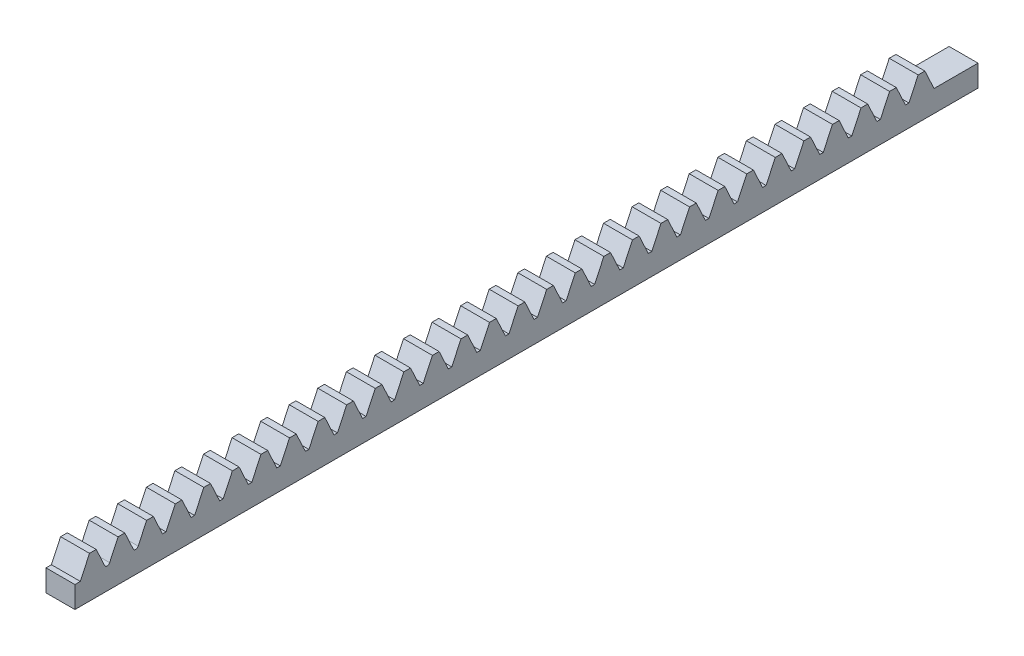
ISO-10303-21;
HEADER;
FILE_DESCRIPTION(('STEP AP214'),'2;1');
FILE_NAME('part.step','',(''),(''),'','','');
FILE_SCHEMA(('AUTOMOTIVE_DESIGN { 1 0 10303 214 1 1 1 1 }'));
ENDSEC;
DATA;
#1=APPLICATION_CONTEXT('core data for automotive mechanical design processes');
#2=APPLICATION_PROTOCOL_DEFINITION('international standard','automotive_design',2000,#1);
#3=PRODUCT_CONTEXT('',#1,'mechanical');
#4=PRODUCT('Part','Part','',(#3));
#5=PRODUCT_RELATED_PRODUCT_CATEGORY('part','',(#4));
#6=PRODUCT_DEFINITION_FORMATION('','',#4);
#7=PRODUCT_DEFINITION_CONTEXT('part definition',#1,'design');
#8=PRODUCT_DEFINITION('design','',#6,#7);
#9=PRODUCT_DEFINITION_SHAPE('','',#8);
#10=(LENGTH_UNIT() NAMED_UNIT(*) SI_UNIT(.MILLI.,.METRE.));
#11=(NAMED_UNIT(*) PLANE_ANGLE_UNIT() SI_UNIT($,.RADIAN.));
#12=(NAMED_UNIT(*) SI_UNIT($,.STERADIAN.) SOLID_ANGLE_UNIT());
#13=UNCERTAINTY_MEASURE_WITH_UNIT(LENGTH_MEASURE(1.E-05),#10,'distance_accuracy_value','');
#14=(GEOMETRIC_REPRESENTATION_CONTEXT(3) GLOBAL_UNCERTAINTY_ASSIGNED_CONTEXT((#13)) GLOBAL_UNIT_ASSIGNED_CONTEXT((#10,
#11,#12)) REPRESENTATION_CONTEXT('',''));
#15=CARTESIAN_POINT('',(0.,0.,0.));
#16=DIRECTION('',(0.,0.,1.));
#17=DIRECTION('',(1.,0.,0.));
#18=AXIS2_PLACEMENT_3D('',#15,#16,#17);
#19=CARTESIAN_POINT('',(5.,5.20649060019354,-96.6605062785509));
#20=DIRECTION('',(-1.,0.,0.));
#21=DIRECTION('',(0.,0.,1.));
#22=AXIS2_PLACEMENT_3D('',#19,#20,#21);
#23=CYLINDRICAL_SURFACE('',#22,0.190164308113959);
#24=DIRECTION('',(1.,0.,0.));
#25=VECTOR('',#24,1.);
#26=CARTESIAN_POINT('',(5.,5.12625516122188,-96.4880976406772));
#27=LINE('',#26,#25);
#28=CARTESIAN_POINT('',(5.,5.12625516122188,-96.4880976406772));
#29=VERTEX_POINT('',#28);
#30=CARTESIAN_POINT('',(3.,5.12625516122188,-96.4880976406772));
#31=VERTEX_POINT('',#30);
#32=EDGE_CURVE('E832',#29,#31,#27,.F.);
#33=ORIENTED_EDGE('',*,*,#32,.F.);
#34=CARTESIAN_POINT('',(5.,5.20649060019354,-96.6605062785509));
#35=DIRECTION('',(1.,0.,0.));
#36=DIRECTION('',(0.,0.,-1.));
#37=AXIS2_PLACEMENT_3D('',#34,#35,#36);
#38=CIRCLE('',#37,0.190164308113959);
#39=CARTESIAN_POINT('',(5.,5.12625516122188,-96.8329149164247));
#40=VERTEX_POINT('',#39);
#41=EDGE_CURVE('E41',#29,#40,#38,.T.);
#42=ORIENTED_EDGE('',*,*,#41,.T.);
#43=DIRECTION('',(1.,0.,0.));
#44=VECTOR('',#43,1.);
#45=CARTESIAN_POINT('',(5.,5.12625516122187,-96.8329149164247));
#46=LINE('',#45,#44);
#47=CARTESIAN_POINT('',(3.,5.12625516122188,-96.8329149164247));
#48=VERTEX_POINT('',#47);
#49=EDGE_CURVE('E835',#48,#40,#46,.T.);
#50=ORIENTED_EDGE('',*,*,#49,.F.);
#51=CARTESIAN_POINT('',(3.,5.20649060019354,-96.6605062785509));
#52=DIRECTION('',(1.,0.,0.));
#53=DIRECTION('',(0.,0.,-1.));
#54=AXIS2_PLACEMENT_3D('',#51,#52,#53);
#55=CIRCLE('',#54,0.190164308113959);
#56=EDGE_CURVE('E11',#48,#31,#55,.F.);
#57=ORIENTED_EDGE('',*,*,#56,.T.);
#58=EDGE_LOOP('',(#33,#42,#50,#57));
#59=FACE_BOUND('',#58,.T.);
#60=ADVANCED_FACE('F34',(#59),#23,.F.);
#61=CARTESIAN_POINT('',(5.,5.20649060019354,-94.6830062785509));
#62=DIRECTION('',(-1.,0.,0.));
#63=DIRECTION('',(0.,0.,1.));
#64=AXIS2_PLACEMENT_3D('',#61,#62,#63);
#65=CYLINDRICAL_SURFACE('',#64,0.190164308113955);
#66=DIRECTION('',(1.,0.,0.));
#67=VECTOR('',#66,1.);
#68=CARTESIAN_POINT('',(5.,5.12625516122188,-94.5105976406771));
#69=LINE('',#68,#67);
#70=CARTESIAN_POINT('',(5.,5.12625516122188,-94.5105976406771));
#71=VERTEX_POINT('',#70);
#72=CARTESIAN_POINT('',(3.,5.12625516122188,-94.5105976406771));
#73=VERTEX_POINT('',#72);
#74=EDGE_CURVE('E817',#71,#73,#69,.F.);
#75=ORIENTED_EDGE('',*,*,#74,.F.);
#76=CARTESIAN_POINT('',(5.,5.20649060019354,-94.6830062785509));
#77=DIRECTION('',(1.,0.,0.));
#78=DIRECTION('',(0.,0.,-1.));
#79=AXIS2_PLACEMENT_3D('',#76,#77,#78);
#80=CIRCLE('',#79,0.190164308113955);
#81=CARTESIAN_POINT('',(5.,5.12625516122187,-94.8554149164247));
#82=VERTEX_POINT('',#81);
#83=EDGE_CURVE('E828',#71,#82,#80,.T.);
#84=ORIENTED_EDGE('',*,*,#83,.T.);
#85=DIRECTION('',(1.,0.,0.));
#86=VECTOR('',#85,1.);
#87=CARTESIAN_POINT('',(5.,5.12625516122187,-94.8554149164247));
#88=LINE('',#87,#86);
#89=CARTESIAN_POINT('',(3.,5.12625516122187,-94.8554149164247));
#90=VERTEX_POINT('',#89);
#91=EDGE_CURVE('E820',#90,#82,#88,.T.);
#92=ORIENTED_EDGE('',*,*,#91,.F.);
#93=CARTESIAN_POINT('',(3.,5.20649060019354,-94.6830062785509));
#94=DIRECTION('',(1.,0.,0.));
#95=DIRECTION('',(0.,0.,-1.));
#96=AXIS2_PLACEMENT_3D('',#93,#94,#95);
#97=CIRCLE('',#96,0.190164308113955);
#98=EDGE_CURVE('E830',#90,#73,#97,.F.);
#99=ORIENTED_EDGE('',*,*,#98,.T.);
#100=EDGE_LOOP('',(#75,#84,#92,#99));
#101=FACE_BOUND('',#100,.T.);
#102=ADVANCED_FACE('F2256',(#101),#65,.F.);
#103=CARTESIAN_POINT('',(5.,6.38080421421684,-93.461756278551));
#104=DIRECTION('',(0.,-1.,0.));
#105=DIRECTION('',(0.,0.,-1.));
#106=AXIS2_PLACEMENT_3D('',#103,#104,#105);
#107=PLANE('',#106);
#108=DIRECTION('',(0.,0.,1.));
#109=VECTOR('',#108,1.);
#110=CARTESIAN_POINT('',(3.,6.38080421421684,-93.461756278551));
#111=LINE('',#110,#109);
#112=CARTESIAN_POINT('',(3.,6.38080421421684,-93.9267562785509));
#113=VERTEX_POINT('',#112);
#114=CARTESIAN_POINT('',(3.,6.38080421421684,-93.461756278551));
#115=VERTEX_POINT('',#114);
#116=EDGE_CURVE('E816',#113,#115,#111,.T.);
#117=ORIENTED_EDGE('',*,*,#116,.T.);
#118=DIRECTION('',(-1.,0.,0.));
#119=VECTOR('',#118,1.);
#120=CARTESIAN_POINT('',(5.,6.38080421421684,-93.461756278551));
#121=LINE('',#120,#119);
#122=CARTESIAN_POINT('',(5.,6.38080421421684,-93.461756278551));
#123=VERTEX_POINT('',#122);
#124=EDGE_CURVE('E796',#123,#115,#121,.T.);
#125=ORIENTED_EDGE('',*,*,#124,.F.);
#126=DIRECTION('',(0.,0.,1.));
#127=VECTOR('',#126,1.);
#128=CARTESIAN_POINT('',(5.,6.38080421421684,-93.461756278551));
#129=LINE('',#128,#127);
#130=CARTESIAN_POINT('',(5.,6.38080421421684,-93.9267562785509));
#131=VERTEX_POINT('',#130);
#132=EDGE_CURVE('E803',#131,#123,#129,.T.);
#133=ORIENTED_EDGE('',*,*,#132,.F.);
#134=DIRECTION('',(-1.,0.,0.));
#135=VECTOR('',#134,1.);
#136=CARTESIAN_POINT('',(5.,6.38080421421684,-93.9267562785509));
#137=LINE('',#136,#135);
#138=EDGE_CURVE('E860',#131,#113,#137,.T.);
#139=ORIENTED_EDGE('',*,*,#138,.T.);
#140=EDGE_LOOP('',(#117,#125,#133,#139));
#141=FACE_BOUND('',#140,.T.);
#142=ADVANCED_FACE('F814',(#141),#107,.F.);
#143=CARTESIAN_POINT('',(5.,5.01632629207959,-92.8267562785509));
#144=DIRECTION('',(0.,-0.421926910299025,-0.906629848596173));
#145=DIRECTION('',(0.,0.906629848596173,-0.421926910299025));
#146=AXIS2_PLACEMENT_3D('',#143,#144,#145);
#147=PLANE('',#146);
#148=DIRECTION('',(0.,-0.906629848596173,0.421926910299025));
#149=VECTOR('',#148,1.);
#150=CARTESIAN_POINT('',(3.,5.01632629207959,-92.8267562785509));
#151=LINE('',#150,#149);
#152=CARTESIAN_POINT('',(3.,5.01632629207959,-92.8267562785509));
#153=VERTEX_POINT('',#152);
#154=EDGE_CURVE('E862',#115,#153,#151,.T.);
#155=ORIENTED_EDGE('',*,*,#154,.T.);
#156=DIRECTION('',(-1.,0.,0.));
#157=VECTOR('',#156,1.);
#158=CARTESIAN_POINT('',(5.,5.01632629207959,-92.8267562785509));
#159=LINE('',#158,#157);
#160=CARTESIAN_POINT('',(5.,5.01632629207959,-92.8267562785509));
#161=VERTEX_POINT('',#160);
#162=EDGE_CURVE('E799',#161,#153,#159,.T.);
#163=ORIENTED_EDGE('',*,*,#162,.F.);
#164=DIRECTION('',(0.,-0.906629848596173,0.421926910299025));
#165=VECTOR('',#164,1.);
#166=CARTESIAN_POINT('',(5.,5.01632629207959,-92.8267562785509));
#167=LINE('',#166,#165);
#168=EDGE_CURVE('E792',#123,#161,#167,.T.);
#169=ORIENTED_EDGE('',*,*,#168,.F.);
#170=ORIENTED_EDGE('',*,*,#124,.T.);
#171=EDGE_LOOP('',(#155,#163,#169,#170));
#172=FACE_BOUND('',#171,.T.);
#173=ADVANCED_FACE('F794',(#172),#147,.F.);
#174=CARTESIAN_POINT('',(5.,5.01632629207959,-92.451756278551));
#175=DIRECTION('',(0.,-1.,0.));
#176=DIRECTION('',(0.,0.,-1.));
#177=AXIS2_PLACEMENT_3D('',#174,#175,#176);
#178=PLANE('',#177);
#179=DIRECTION('',(0.,0.,1.));
#180=VECTOR('',#179,1.);
#181=CARTESIAN_POINT('',(3.,5.01632629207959,-92.451756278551));
#182=LINE('',#181,#180);
#183=CARTESIAN_POINT('',(3.,5.01632629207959,-92.451756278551));
#184=VERTEX_POINT('',#183);
#185=EDGE_CURVE('E864',#153,#184,#182,.T.);
#186=ORIENTED_EDGE('',*,*,#185,.T.);
#187=DIRECTION('',(-1.,0.,0.));
#188=VECTOR('',#187,1.);
#189=CARTESIAN_POINT('',(5.,5.01632629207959,-92.451756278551));
#190=LINE('',#189,#188);
#191=CARTESIAN_POINT('',(5.,5.01632629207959,-92.451756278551));
#192=VERTEX_POINT('',#191);
#193=EDGE_CURVE('E822',#192,#184,#190,.T.);
#194=ORIENTED_EDGE('',*,*,#193,.F.);
#195=DIRECTION('',(0.,0.,1.));
#196=VECTOR('',#195,1.);
#197=CARTESIAN_POINT('',(5.,5.01632629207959,-92.451756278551));
#198=LINE('',#197,#196);
#199=EDGE_CURVE('E802',#161,#192,#198,.T.);
#200=ORIENTED_EDGE('',*,*,#199,.F.);
#201=ORIENTED_EDGE('',*,*,#162,.T.);
#202=EDGE_LOOP('',(#186,#194,#200,#201));
#203=FACE_BOUND('',#202,.T.);
#204=ADVANCED_FACE('F2279',(#203),#178,.F.);
#205=CARTESIAN_POINT('',(5.,3.51632629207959,-92.4517562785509));
#206=DIRECTION('',(0.,0.,-1.));
#207=DIRECTION('',(0.,1.,0.));
#208=AXIS2_PLACEMENT_3D('',#205,#206,#207);
#209=PLANE('',#208);
#210=DIRECTION('',(0.,-1.,0.));
#211=VECTOR('',#210,1.);
#212=CARTESIAN_POINT('',(3.,3.51632629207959,-92.4517562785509));
#213=LINE('',#212,#211);
#214=CARTESIAN_POINT('',(3.,3.51632629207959,-92.4517562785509));
#215=VERTEX_POINT('',#214);
#216=EDGE_CURVE('E866',#184,#215,#213,.T.);
#217=ORIENTED_EDGE('',*,*,#216,.T.);
#218=DIRECTION('',(-1.,0.,0.));
#219=VECTOR('',#218,1.);
#220=CARTESIAN_POINT('',(5.,3.51632629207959,-92.4517562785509));
#221=LINE('',#220,#219);
#222=CARTESIAN_POINT('',(5.,3.51632629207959,-92.4517562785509));
#223=VERTEX_POINT('',#222);
#224=EDGE_CURVE('E1448',#223,#215,#221,.T.);
#225=ORIENTED_EDGE('',*,*,#224,.F.);
#226=DIRECTION('',(0.,-1.,0.));
#227=VECTOR('',#226,1.);
#228=CARTESIAN_POINT('',(5.,3.51632629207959,-92.4517562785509));
#229=LINE('',#228,#227);
#230=EDGE_CURVE('E1457',#192,#223,#229,.T.);
#231=ORIENTED_EDGE('',*,*,#230,.F.);
#232=ORIENTED_EDGE('',*,*,#193,.T.);
#233=EDGE_LOOP('',(#217,#225,#231,#232));
#234=FACE_BOUND('',#233,.T.);
#235=ADVANCED_FACE('F1455',(#234),#209,.F.);
#236=CARTESIAN_POINT('',(5.,3.51632629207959,-92.4517562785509));
#237=DIRECTION('',(0.,1.,0.));
#238=DIRECTION('',(0.,0.,1.));
#239=AXIS2_PLACEMENT_3D('',#236,#237,#238);
#240=PLANE('',#239);
#241=DIRECTION('',(0.,0.,-1.));
#242=VECTOR('',#241,1.);
#243=CARTESIAN_POINT('',(3.,3.51632629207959,-92.4517562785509));
#244=LINE('',#243,#242);
#245=CARTESIAN_POINT('',(3.,3.51632629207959,-154.951756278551));
#246=VERTEX_POINT('',#245);
#247=EDGE_CURVE('E868',#215,#246,#244,.T.);
#248=ORIENTED_EDGE('',*,*,#247,.T.);
#249=DIRECTION('',(-1.,0.,0.));
#250=VECTOR('',#249,1.);
#251=CARTESIAN_POINT('',(5.,3.51632629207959,-154.951756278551));
#252=LINE('',#251,#250);
#253=CARTESIAN_POINT('',(5.,3.51632629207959,-154.951756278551));
#254=VERTEX_POINT('',#253);
#255=EDGE_CURVE('E1445',#254,#246,#252,.T.);
#256=ORIENTED_EDGE('',*,*,#255,.F.);
#257=DIRECTION('',(0.,0.,-1.));
#258=VECTOR('',#257,1.);
#259=CARTESIAN_POINT('',(5.,3.51632629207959,-92.4517562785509));
#260=LINE('',#259,#258);
#261=EDGE_CURVE('E1475',#223,#254,#260,.T.);
#262=ORIENTED_EDGE('',*,*,#261,.F.);
#263=ORIENTED_EDGE('',*,*,#224,.T.);
#264=EDGE_LOOP('',(#248,#256,#262,#263));
#265=FACE_BOUND('',#264,.T.);
#266=ADVANCED_FACE('F1466',(#265),#240,.F.);
#267=CARTESIAN_POINT('',(5.,3.51632629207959,-154.951756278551));
#268=DIRECTION('',(0.,0.,1.));
#269=DIRECTION('',(1.,0.,0.));
#270=AXIS2_PLACEMENT_3D('',#267,#268,#269);
#271=PLANE('',#270);
#272=DIRECTION('',(0.,1.,0.));
#273=VECTOR('',#272,1.);
#274=CARTESIAN_POINT('',(3.,3.51632629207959,-154.951756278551));
#275=LINE('',#274,#273);
#276=CARTESIAN_POINT('',(3.,5.01632629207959,-154.951756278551));
#277=VERTEX_POINT('',#276);
#278=EDGE_CURVE('E870',#246,#277,#275,.T.);
#279=ORIENTED_EDGE('',*,*,#278,.T.);
#280=DIRECTION('',(-1.,0.,0.));
#281=VECTOR('',#280,1.);
#282=CARTESIAN_POINT('',(5.,5.01632629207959,-154.951756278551));
#283=LINE('',#282,#281);
#284=CARTESIAN_POINT('',(5.,5.01632629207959,-154.951756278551));
#285=VERTEX_POINT('',#284);
#286=EDGE_CURVE('E1442',#285,#277,#283,.T.);
#287=ORIENTED_EDGE('',*,*,#286,.F.);
#288=DIRECTION('',(0.,1.,0.));
#289=VECTOR('',#288,1.);
#290=CARTESIAN_POINT('',(5.,3.51632629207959,-154.951756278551));
#291=LINE('',#290,#289);
#292=EDGE_CURVE('E1472',#254,#285,#291,.T.);
#293=ORIENTED_EDGE('',*,*,#292,.F.);
#294=ORIENTED_EDGE('',*,*,#255,.T.);
#295=EDGE_LOOP('',(#279,#287,#293,#294));
#296=FACE_BOUND('',#295,.T.);
#297=ADVANCED_FACE('F1470',(#296),#271,.F.);
#298=CARTESIAN_POINT('',(5.,5.01632629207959,-151.909256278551));
#299=DIRECTION('',(0.,-1.,0.));
#300=DIRECTION('',(0.,0.,-1.));
#301=AXIS2_PLACEMENT_3D('',#298,#299,#300);
#302=PLANE('',#301);
#303=DIRECTION('',(0.,0.,1.));
#304=VECTOR('',#303,1.);
#305=CARTESIAN_POINT('',(3.,5.01632629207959,-151.909256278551));
#306=LINE('',#305,#304);
#307=CARTESIAN_POINT('',(3.,5.01632629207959,-151.909256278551));
#308=VERTEX_POINT('',#307);
#309=EDGE_CURVE('E872',#277,#308,#306,.T.);
#310=ORIENTED_EDGE('',*,*,#309,.T.);
#311=DIRECTION('',(-1.,0.,0.));
#312=VECTOR('',#311,1.);
#313=CARTESIAN_POINT('',(5.,5.01632629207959,-151.909256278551));
#314=LINE('',#313,#312);
#315=CARTESIAN_POINT('',(5.,5.01632629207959,-151.909256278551));
#316=VERTEX_POINT('',#315);
#317=EDGE_CURVE('E1439',#316,#308,#314,.T.);
#318=ORIENTED_EDGE('',*,*,#317,.F.);
#319=DIRECTION('',(0.,0.,1.));
#320=VECTOR('',#319,1.);
#321=CARTESIAN_POINT('',(5.,5.01632629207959,-151.909256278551));
#322=LINE('',#321,#320);
#323=EDGE_CURVE('E1474',#285,#316,#322,.T.);
#324=ORIENTED_EDGE('',*,*,#323,.F.);
#325=ORIENTED_EDGE('',*,*,#286,.T.);
#326=EDGE_LOOP('',(#310,#318,#324,#325));
#327=FACE_BOUND('',#326,.T.);
#328=ADVANCED_FACE('F2246',(#327),#302,.F.);
#329=CARTESIAN_POINT('',(5.,6.38080421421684,-151.274256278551));
#330=DIRECTION('',(0.,-0.421926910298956,0.906629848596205));
#331=DIRECTION('',(0.,-0.906629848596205,-0.421926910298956));
#332=AXIS2_PLACEMENT_3D('',#329,#330,#331);
#333=PLANE('',#332);
#334=DIRECTION('',(0.,0.906629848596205,0.421926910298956));
#335=VECTOR('',#334,1.);
#336=CARTESIAN_POINT('',(3.,6.38080421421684,-151.274256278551));
#337=LINE('',#336,#335);
#338=CARTESIAN_POINT('',(3.,6.38080421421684,-151.274256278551));
#339=VERTEX_POINT('',#338);
#340=EDGE_CURVE('E874',#308,#339,#337,.T.);
#341=ORIENTED_EDGE('',*,*,#340,.T.);
#342=DIRECTION('',(-1.,0.,0.));
#343=VECTOR('',#342,1.);
#344=CARTESIAN_POINT('',(5.,6.38080421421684,-151.274256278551));
#345=LINE('',#344,#343);
#346=CARTESIAN_POINT('',(5.,6.38080421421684,-151.274256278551));
#347=VERTEX_POINT('',#346);
#348=EDGE_CURVE('E1436',#347,#339,#345,.T.);
#349=ORIENTED_EDGE('',*,*,#348,.F.);
#350=DIRECTION('',(0.,0.906629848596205,0.421926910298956));
#351=VECTOR('',#350,1.);
#352=CARTESIAN_POINT('',(5.,6.38080421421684,-151.274256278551));
#353=LINE('',#352,#351);
#354=EDGE_CURVE('E1477',#316,#347,#353,.T.);
#355=ORIENTED_EDGE('',*,*,#354,.F.);
#356=ORIENTED_EDGE('',*,*,#317,.T.);
#357=EDGE_LOOP('',(#341,#349,#355,#356));
#358=FACE_BOUND('',#357,.T.);
#359=ADVANCED_FACE('F2243',(#358),#333,.F.);
#360=CARTESIAN_POINT('',(5.,6.38080421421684,-150.809256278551));
#361=DIRECTION('',(0.,-1.,0.));
#362=DIRECTION('',(0.,0.,-1.));
#363=AXIS2_PLACEMENT_3D('',#360,#361,#362);
#364=PLANE('',#363);
#365=DIRECTION('',(0.,0.,1.));
#366=VECTOR('',#365,1.);
#367=CARTESIAN_POINT('',(3.,6.38080421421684,-150.809256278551));
#368=LINE('',#367,#366);
#369=CARTESIAN_POINT('',(3.,6.38080421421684,-150.809256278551));
#370=VERTEX_POINT('',#369);
#371=EDGE_CURVE('E876',#339,#370,#368,.T.);
#372=ORIENTED_EDGE('',*,*,#371,.T.);
#373=DIRECTION('',(-1.,0.,0.));
#374=VECTOR('',#373,1.);
#375=CARTESIAN_POINT('',(5.,6.38080421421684,-150.809256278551));
#376=LINE('',#375,#374);
#377=CARTESIAN_POINT('',(5.,6.38080421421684,-150.809256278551));
#378=VERTEX_POINT('',#377);
#379=EDGE_CURVE('E1433',#378,#370,#376,.T.);
#380=ORIENTED_EDGE('',*,*,#379,.F.);
#381=DIRECTION('',(0.,0.,1.));
#382=VECTOR('',#381,1.);
#383=CARTESIAN_POINT('',(5.,6.38080421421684,-150.809256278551));
#384=LINE('',#383,#382);
#385=EDGE_CURVE('E1483',#347,#378,#384,.T.);
#386=ORIENTED_EDGE('',*,*,#385,.F.);
#387=ORIENTED_EDGE('',*,*,#348,.T.);
#388=EDGE_LOOP('',(#372,#380,#386,#387));
#389=FACE_BOUND('',#388,.T.);
#390=ADVANCED_FACE('F2239',(#389),#364,.F.);
#391=CARTESIAN_POINT('',(5.,5.01632629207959,-150.174256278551));
#392=DIRECTION('',(0.,-0.421926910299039,-0.906629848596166));
#393=DIRECTION('',(0.,0.906629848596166,-0.42192691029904));
#394=AXIS2_PLACEMENT_3D('',#391,#392,#393);
#395=PLANE('',#394);
#396=DIRECTION('',(0.,-0.906629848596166,0.421926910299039));
#397=VECTOR('',#396,1.);
#398=CARTESIAN_POINT('',(3.,5.01632629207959,-150.174256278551));
#399=LINE('',#398,#397);
#400=CARTESIAN_POINT('',(3.,5.01632629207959,-150.174256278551));
#401=VERTEX_POINT('',#400);
#402=EDGE_CURVE('E878',#370,#401,#399,.T.);
#403=ORIENTED_EDGE('',*,*,#402,.T.);
#404=DIRECTION('',(-1.,0.,0.));
#405=VECTOR('',#404,1.);
#406=CARTESIAN_POINT('',(5.,5.01632629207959,-150.174256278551));
#407=LINE('',#406,#405);
#408=CARTESIAN_POINT('',(5.,5.01632629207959,-150.174256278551));
#409=VERTEX_POINT('',#408);
#410=EDGE_CURVE('E1430',#409,#401,#407,.T.);
#411=ORIENTED_EDGE('',*,*,#410,.F.);
#412=DIRECTION('',(0.,-0.906629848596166,0.421926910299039));
#413=VECTOR('',#412,1.);
#414=CARTESIAN_POINT('',(5.,5.01632629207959,-150.174256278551));
#415=LINE('',#414,#413);
#416=EDGE_CURVE('E1485',#378,#409,#415,.T.);
#417=ORIENTED_EDGE('',*,*,#416,.F.);
#418=ORIENTED_EDGE('',*,*,#379,.T.);
#419=EDGE_LOOP('',(#403,#411,#417,#418));
#420=FACE_BOUND('',#419,.T.);
#421=ADVANCED_FACE('F2234',(#420),#395,.F.);
#422=CARTESIAN_POINT('',(5.,5.01632629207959,-149.931756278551));
#423=DIRECTION('',(0.,-1.,0.));
#424=DIRECTION('',(0.,0.,-1.));
#425=AXIS2_PLACEMENT_3D('',#422,#423,#424);
#426=PLANE('',#425);
#427=DIRECTION('',(0.,0.,1.));
#428=VECTOR('',#427,1.);
#429=CARTESIAN_POINT('',(3.,5.01632629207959,-149.931756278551));
#430=LINE('',#429,#428);
#431=CARTESIAN_POINT('',(3.,5.01632629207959,-149.931756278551));
#432=VERTEX_POINT('',#431);
#433=EDGE_CURVE('E880',#401,#432,#430,.T.);
#434=ORIENTED_EDGE('',*,*,#433,.T.);
#435=DIRECTION('',(-1.,0.,0.));
#436=VECTOR('',#435,1.);
#437=CARTESIAN_POINT('',(5.,5.01632629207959,-149.931756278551));
#438=LINE('',#437,#436);
#439=CARTESIAN_POINT('',(5.,5.01632629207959,-149.931756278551));
#440=VERTEX_POINT('',#439);
#441=EDGE_CURVE('E1427',#440,#432,#438,.T.);
#442=ORIENTED_EDGE('',*,*,#441,.F.);
#443=DIRECTION('',(0.,0.,1.));
#444=VECTOR('',#443,1.);
#445=CARTESIAN_POINT('',(5.,5.01632629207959,-149.931756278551));
#446=LINE('',#445,#444);
#447=EDGE_CURVE('E1487',#409,#440,#446,.T.);
#448=ORIENTED_EDGE('',*,*,#447,.F.);
#449=ORIENTED_EDGE('',*,*,#410,.T.);
#450=EDGE_LOOP('',(#434,#442,#448,#449));
#451=FACE_BOUND('',#450,.T.);
#452=ADVANCED_FACE('F2228',(#451),#426,.F.);
#453=CARTESIAN_POINT('',(5.,6.38080421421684,-149.296756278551));
#454=DIRECTION('',(0.,-0.421926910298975,0.906629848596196));
#455=DIRECTION('',(0.,-0.906629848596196,-0.421926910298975));
#456=AXIS2_PLACEMENT_3D('',#453,#454,#455);
#457=PLANE('',#456);
#458=DIRECTION('',(0.,0.906629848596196,0.421926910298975));
#459=VECTOR('',#458,1.);
#460=CARTESIAN_POINT('',(3.,6.38080421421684,-149.296756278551));
#461=LINE('',#460,#459);
#462=CARTESIAN_POINT('',(3.,6.38080421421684,-149.296756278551));
#463=VERTEX_POINT('',#462);
#464=EDGE_CURVE('E882',#432,#463,#461,.T.);
#465=ORIENTED_EDGE('',*,*,#464,.T.);
#466=DIRECTION('',(-1.,0.,0.));
#467=VECTOR('',#466,1.);
#468=CARTESIAN_POINT('',(5.,6.38080421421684,-149.296756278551));
#469=LINE('',#468,#467);
#470=CARTESIAN_POINT('',(5.,6.38080421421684,-149.296756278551));
#471=VERTEX_POINT('',#470);
#472=EDGE_CURVE('E1424',#471,#463,#469,.T.);
#473=ORIENTED_EDGE('',*,*,#472,.F.);
#474=DIRECTION('',(0.,0.906629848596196,0.421926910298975));
#475=VECTOR('',#474,1.);
#476=CARTESIAN_POINT('',(5.,6.38080421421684,-149.296756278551));
#477=LINE('',#476,#475);
#478=EDGE_CURVE('E1489',#440,#471,#477,.T.);
#479=ORIENTED_EDGE('',*,*,#478,.F.);
#480=ORIENTED_EDGE('',*,*,#441,.T.);
#481=EDGE_LOOP('',(#465,#473,#479,#480));
#482=FACE_BOUND('',#481,.T.);
#483=ADVANCED_FACE('F2224',(#482),#457,.F.);
#484=CARTESIAN_POINT('',(5.,6.38080421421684,-148.831756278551));
#485=DIRECTION('',(0.,-1.,0.));
#486=DIRECTION('',(0.,0.,-1.));
#487=AXIS2_PLACEMENT_3D('',#484,#485,#486);
#488=PLANE('',#487);
#489=DIRECTION('',(0.,0.,1.));
#490=VECTOR('',#489,1.);
#491=CARTESIAN_POINT('',(3.,6.38080421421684,-148.831756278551));
#492=LINE('',#491,#490);
#493=CARTESIAN_POINT('',(3.,6.38080421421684,-148.831756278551));
#494=VERTEX_POINT('',#493);
#495=EDGE_CURVE('E884',#463,#494,#492,.T.);
#496=ORIENTED_EDGE('',*,*,#495,.T.);
#497=DIRECTION('',(-1.,0.,0.));
#498=VECTOR('',#497,1.);
#499=CARTESIAN_POINT('',(5.,6.38080421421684,-148.831756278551));
#500=LINE('',#499,#498);
#501=CARTESIAN_POINT('',(5.,6.38080421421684,-148.831756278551));
#502=VERTEX_POINT('',#501);
#503=EDGE_CURVE('E1421',#502,#494,#500,.T.);
#504=ORIENTED_EDGE('',*,*,#503,.F.);
#505=DIRECTION('',(0.,0.,1.));
#506=VECTOR('',#505,1.);
#507=CARTESIAN_POINT('',(5.,6.38080421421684,-148.831756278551));
#508=LINE('',#507,#506);
#509=EDGE_CURVE('E1491',#471,#502,#508,.T.);
#510=ORIENTED_EDGE('',*,*,#509,.F.);
#511=ORIENTED_EDGE('',*,*,#472,.T.);
#512=EDGE_LOOP('',(#496,#504,#510,#511));
#513=FACE_BOUND('',#512,.T.);
#514=ADVANCED_FACE('F2219',(#513),#488,.F.);
#515=CARTESIAN_POINT('',(5.,5.01632629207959,-148.196756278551));
#516=DIRECTION('',(0.,-0.421926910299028,-0.906629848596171));
#517=DIRECTION('',(0.,0.906629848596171,-0.421926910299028));
#518=AXIS2_PLACEMENT_3D('',#515,#516,#517);
#519=PLANE('',#518);
#520=DIRECTION('',(0.,-0.906629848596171,0.421926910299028));
#521=VECTOR('',#520,1.);
#522=CARTESIAN_POINT('',(3.,5.01632629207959,-148.196756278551));
#523=LINE('',#522,#521);
#524=CARTESIAN_POINT('',(3.,5.01632629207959,-148.196756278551));
#525=VERTEX_POINT('',#524);
#526=EDGE_CURVE('E886',#494,#525,#523,.T.);
#527=ORIENTED_EDGE('',*,*,#526,.T.);
#528=DIRECTION('',(-1.,0.,0.));
#529=VECTOR('',#528,1.);
#530=CARTESIAN_POINT('',(5.,5.01632629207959,-148.196756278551));
#531=LINE('',#530,#529);
#532=CARTESIAN_POINT('',(5.,5.01632629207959,-148.196756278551));
#533=VERTEX_POINT('',#532);
#534=EDGE_CURVE('E1418',#533,#525,#531,.T.);
#535=ORIENTED_EDGE('',*,*,#534,.F.);
#536=DIRECTION('',(0.,-0.906629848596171,0.421926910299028));
#537=VECTOR('',#536,1.);
#538=CARTESIAN_POINT('',(5.,5.01632629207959,-148.196756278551));
#539=LINE('',#538,#537);
#540=EDGE_CURVE('E1493',#502,#533,#539,.T.);
#541=ORIENTED_EDGE('',*,*,#540,.F.);
#542=ORIENTED_EDGE('',*,*,#503,.T.);
#543=EDGE_LOOP('',(#527,#535,#541,#542));
#544=FACE_BOUND('',#543,.T.);
#545=ADVANCED_FACE('F2213',(#544),#519,.F.);
#546=CARTESIAN_POINT('',(5.,5.01632629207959,-147.954256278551));
#547=DIRECTION('',(0.,-1.,0.));
#548=DIRECTION('',(0.,0.,-1.));
#549=AXIS2_PLACEMENT_3D('',#546,#547,#548);
#550=PLANE('',#549);
#551=DIRECTION('',(0.,0.,1.));
#552=VECTOR('',#551,1.);
#553=CARTESIAN_POINT('',(3.,5.01632629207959,-147.954256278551));
#554=LINE('',#553,#552);
#555=CARTESIAN_POINT('',(3.,5.01632629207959,-147.954256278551));
#556=VERTEX_POINT('',#555);
#557=EDGE_CURVE('E888',#525,#556,#554,.T.);
#558=ORIENTED_EDGE('',*,*,#557,.T.);
#559=DIRECTION('',(-1.,0.,0.));
#560=VECTOR('',#559,1.);
#561=CARTESIAN_POINT('',(5.,5.01632629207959,-147.954256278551));
#562=LINE('',#561,#560);
#563=CARTESIAN_POINT('',(5.,5.01632629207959,-147.954256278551));
#564=VERTEX_POINT('',#563);
#565=EDGE_CURVE('E1415',#564,#556,#562,.T.);
#566=ORIENTED_EDGE('',*,*,#565,.F.);
#567=DIRECTION('',(0.,0.,1.));
#568=VECTOR('',#567,1.);
#569=CARTESIAN_POINT('',(5.,5.01632629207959,-147.954256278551));
#570=LINE('',#569,#568);
#571=EDGE_CURVE('E1495',#533,#564,#570,.T.);
#572=ORIENTED_EDGE('',*,*,#571,.F.);
#573=ORIENTED_EDGE('',*,*,#534,.T.);
#574=EDGE_LOOP('',(#558,#566,#572,#573));
#575=FACE_BOUND('',#574,.T.);
#576=ADVANCED_FACE('F2209',(#575),#550,.F.);
#577=CARTESIAN_POINT('',(5.,6.38080421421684,-147.319256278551));
#578=DIRECTION('',(0.,-0.421926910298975,0.906629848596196));
#579=DIRECTION('',(0.,-0.906629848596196,-0.421926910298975));
#580=AXIS2_PLACEMENT_3D('',#577,#578,#579);
#581=PLANE('',#580);
#582=DIRECTION('',(0.,0.906629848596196,0.421926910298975));
#583=VECTOR('',#582,1.);
#584=CARTESIAN_POINT('',(3.,6.38080421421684,-147.319256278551));
#585=LINE('',#584,#583);
#586=CARTESIAN_POINT('',(3.,6.38080421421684,-147.319256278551));
#587=VERTEX_POINT('',#586);
#588=EDGE_CURVE('E890',#556,#587,#585,.T.);
#589=ORIENTED_EDGE('',*,*,#588,.T.);
#590=DIRECTION('',(-1.,0.,0.));
#591=VECTOR('',#590,1.);
#592=CARTESIAN_POINT('',(5.,6.38080421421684,-147.319256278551));
#593=LINE('',#592,#591);
#594=CARTESIAN_POINT('',(5.,6.38080421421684,-147.319256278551));
#595=VERTEX_POINT('',#594);
#596=EDGE_CURVE('E1412',#595,#587,#593,.T.);
#597=ORIENTED_EDGE('',*,*,#596,.F.);
#598=DIRECTION('',(0.,0.906629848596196,0.421926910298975));
#599=VECTOR('',#598,1.);
#600=CARTESIAN_POINT('',(5.,6.38080421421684,-147.319256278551));
#601=LINE('',#600,#599);
#602=EDGE_CURVE('E1497',#564,#595,#601,.T.);
#603=ORIENTED_EDGE('',*,*,#602,.F.);
#604=ORIENTED_EDGE('',*,*,#565,.T.);
#605=EDGE_LOOP('',(#589,#597,#603,#604));
#606=FACE_BOUND('',#605,.T.);
#607=ADVANCED_FACE('F2204',(#606),#581,.F.);
#608=CARTESIAN_POINT('',(5.,6.38080421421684,-146.854256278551));
#609=DIRECTION('',(0.,-1.,0.));
#610=DIRECTION('',(0.,0.,-1.));
#611=AXIS2_PLACEMENT_3D('',#608,#609,#610);
#612=PLANE('',#611);
#613=DIRECTION('',(0.,0.,1.));
#614=VECTOR('',#613,1.);
#615=CARTESIAN_POINT('',(3.,6.38080421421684,-146.854256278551));
#616=LINE('',#615,#614);
#617=CARTESIAN_POINT('',(3.,6.38080421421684,-146.854256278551));
#618=VERTEX_POINT('',#617);
#619=EDGE_CURVE('E892',#587,#618,#616,.T.);
#620=ORIENTED_EDGE('',*,*,#619,.T.);
#621=DIRECTION('',(-1.,0.,0.));
#622=VECTOR('',#621,1.);
#623=CARTESIAN_POINT('',(5.,6.38080421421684,-146.854256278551));
#624=LINE('',#623,#622);
#625=CARTESIAN_POINT('',(5.,6.38080421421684,-146.854256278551));
#626=VERTEX_POINT('',#625);
#627=EDGE_CURVE('E1409',#626,#618,#624,.T.);
#628=ORIENTED_EDGE('',*,*,#627,.F.);
#629=DIRECTION('',(0.,0.,1.));
#630=VECTOR('',#629,1.);
#631=CARTESIAN_POINT('',(5.,6.38080421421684,-146.854256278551));
#632=LINE('',#631,#630);
#633=EDGE_CURVE('E1499',#595,#626,#632,.T.);
#634=ORIENTED_EDGE('',*,*,#633,.F.);
#635=ORIENTED_EDGE('',*,*,#596,.T.);
#636=EDGE_LOOP('',(#620,#628,#634,#635));
#637=FACE_BOUND('',#636,.T.);
#638=ADVANCED_FACE('F2198',(#637),#612,.F.);
#639=CARTESIAN_POINT('',(5.,5.01632629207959,-146.219256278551));
#640=DIRECTION('',(0.,-0.421926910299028,-0.906629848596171));
#641=DIRECTION('',(0.,0.906629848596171,-0.421926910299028));
#642=AXIS2_PLACEMENT_3D('',#639,#640,#641);
#643=PLANE('',#642);
#644=DIRECTION('',(0.,-0.906629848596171,0.421926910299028));
#645=VECTOR('',#644,1.);
#646=CARTESIAN_POINT('',(3.,5.01632629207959,-146.219256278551));
#647=LINE('',#646,#645);
#648=CARTESIAN_POINT('',(3.,5.01632629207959,-146.219256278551));
#649=VERTEX_POINT('',#648);
#650=EDGE_CURVE('E894',#618,#649,#647,.T.);
#651=ORIENTED_EDGE('',*,*,#650,.T.);
#652=DIRECTION('',(-1.,0.,0.));
#653=VECTOR('',#652,1.);
#654=CARTESIAN_POINT('',(5.,5.01632629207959,-146.219256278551));
#655=LINE('',#654,#653);
#656=CARTESIAN_POINT('',(5.,5.01632629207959,-146.219256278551));
#657=VERTEX_POINT('',#656);
#658=EDGE_CURVE('E1406',#657,#649,#655,.T.);
#659=ORIENTED_EDGE('',*,*,#658,.F.);
#660=DIRECTION('',(0.,-0.906629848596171,0.421926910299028));
#661=VECTOR('',#660,1.);
#662=CARTESIAN_POINT('',(5.,5.01632629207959,-146.219256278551));
#663=LINE('',#662,#661);
#664=EDGE_CURVE('E1501',#626,#657,#663,.T.);
#665=ORIENTED_EDGE('',*,*,#664,.F.);
#666=ORIENTED_EDGE('',*,*,#627,.T.);
#667=EDGE_LOOP('',(#651,#659,#665,#666));
#668=FACE_BOUND('',#667,.T.);
#669=ADVANCED_FACE('F2194',(#668),#643,.F.);
#670=CARTESIAN_POINT('',(5.,5.01632629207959,-145.976756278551));
#671=DIRECTION('',(0.,-1.,0.));
#672=DIRECTION('',(0.,0.,-1.));
#673=AXIS2_PLACEMENT_3D('',#670,#671,#672);
#674=PLANE('',#673);
#675=DIRECTION('',(0.,0.,1.));
#676=VECTOR('',#675,1.);
#677=CARTESIAN_POINT('',(3.,5.01632629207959,-145.976756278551));
#678=LINE('',#677,#676);
#679=CARTESIAN_POINT('',(3.,5.01632629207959,-145.976756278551));
#680=VERTEX_POINT('',#679);
#681=EDGE_CURVE('E896',#649,#680,#678,.T.);
#682=ORIENTED_EDGE('',*,*,#681,.T.);
#683=DIRECTION('',(-1.,0.,0.));
#684=VECTOR('',#683,1.);
#685=CARTESIAN_POINT('',(5.,5.01632629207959,-145.976756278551));
#686=LINE('',#685,#684);
#687=CARTESIAN_POINT('',(5.,5.01632629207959,-145.976756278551));
#688=VERTEX_POINT('',#687);
#689=EDGE_CURVE('E1403',#688,#680,#686,.T.);
#690=ORIENTED_EDGE('',*,*,#689,.F.);
#691=DIRECTION('',(0.,0.,1.));
#692=VECTOR('',#691,1.);
#693=CARTESIAN_POINT('',(5.,5.01632629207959,-145.976756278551));
#694=LINE('',#693,#692);
#695=EDGE_CURVE('E1503',#657,#688,#694,.T.);
#696=ORIENTED_EDGE('',*,*,#695,.F.);
#697=ORIENTED_EDGE('',*,*,#658,.T.);
#698=EDGE_LOOP('',(#682,#690,#696,#697));
#699=FACE_BOUND('',#698,.T.);
#700=ADVANCED_FACE('F2189',(#699),#674,.F.);
#701=CARTESIAN_POINT('',(5.,6.38080421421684,-145.341756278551));
#702=DIRECTION('',(0.,-0.421926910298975,0.906629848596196));
#703=DIRECTION('',(0.,-0.906629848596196,-0.421926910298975));
#704=AXIS2_PLACEMENT_3D('',#701,#702,#703);
#705=PLANE('',#704);
#706=DIRECTION('',(0.,0.906629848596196,0.421926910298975));
#707=VECTOR('',#706,1.);
#708=CARTESIAN_POINT('',(3.,6.38080421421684,-145.341756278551));
#709=LINE('',#708,#707);
#710=CARTESIAN_POINT('',(3.,6.38080421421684,-145.341756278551));
#711=VERTEX_POINT('',#710);
#712=EDGE_CURVE('E898',#680,#711,#709,.T.);
#713=ORIENTED_EDGE('',*,*,#712,.T.);
#714=DIRECTION('',(-1.,0.,0.));
#715=VECTOR('',#714,1.);
#716=CARTESIAN_POINT('',(5.,6.38080421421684,-145.341756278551));
#717=LINE('',#716,#715);
#718=CARTESIAN_POINT('',(5.,6.38080421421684,-145.341756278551));
#719=VERTEX_POINT('',#718);
#720=EDGE_CURVE('E1400',#719,#711,#717,.T.);
#721=ORIENTED_EDGE('',*,*,#720,.F.);
#722=DIRECTION('',(0.,0.906629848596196,0.421926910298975));
#723=VECTOR('',#722,1.);
#724=CARTESIAN_POINT('',(5.,6.38080421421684,-145.341756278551));
#725=LINE('',#724,#723);
#726=EDGE_CURVE('E1505',#688,#719,#725,.T.);
#727=ORIENTED_EDGE('',*,*,#726,.F.);
#728=ORIENTED_EDGE('',*,*,#689,.T.);
#729=EDGE_LOOP('',(#713,#721,#727,#728));
#730=FACE_BOUND('',#729,.T.);
#731=ADVANCED_FACE('F2183',(#730),#705,.F.);
#732=CARTESIAN_POINT('',(5.,6.38080421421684,-144.876756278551));
#733=DIRECTION('',(0.,-1.,0.));
#734=DIRECTION('',(0.,0.,-1.));
#735=AXIS2_PLACEMENT_3D('',#732,#733,#734);
#736=PLANE('',#735);
#737=DIRECTION('',(0.,0.,1.));
#738=VECTOR('',#737,1.);
#739=CARTESIAN_POINT('',(3.,6.38080421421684,-144.876756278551));
#740=LINE('',#739,#738);
#741=CARTESIAN_POINT('',(3.,6.38080421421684,-144.876756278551));
#742=VERTEX_POINT('',#741);
#743=EDGE_CURVE('E900',#711,#742,#740,.T.);
#744=ORIENTED_EDGE('',*,*,#743,.T.);
#745=DIRECTION('',(-1.,0.,0.));
#746=VECTOR('',#745,1.);
#747=CARTESIAN_POINT('',(5.,6.38080421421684,-144.876756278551));
#748=LINE('',#747,#746);
#749=CARTESIAN_POINT('',(5.,6.38080421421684,-144.876756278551));
#750=VERTEX_POINT('',#749);
#751=EDGE_CURVE('E1397',#750,#742,#748,.T.);
#752=ORIENTED_EDGE('',*,*,#751,.F.);
#753=DIRECTION('',(0.,0.,1.));
#754=VECTOR('',#753,1.);
#755=CARTESIAN_POINT('',(5.,6.38080421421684,-144.876756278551));
#756=LINE('',#755,#754);
#757=EDGE_CURVE('E1507',#719,#750,#756,.T.);
#758=ORIENTED_EDGE('',*,*,#757,.F.);
#759=ORIENTED_EDGE('',*,*,#720,.T.);
#760=EDGE_LOOP('',(#744,#752,#758,#759));
#761=FACE_BOUND('',#760,.T.);
#762=ADVANCED_FACE('F2179',(#761),#736,.F.);
#763=CARTESIAN_POINT('',(5.,5.01632629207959,-144.241756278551));
#764=DIRECTION('',(0.,-0.421926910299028,-0.906629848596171));
#765=DIRECTION('',(0.,0.906629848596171,-0.421926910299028));
#766=AXIS2_PLACEMENT_3D('',#763,#764,#765);
#767=PLANE('',#766);
#768=DIRECTION('',(0.,-0.906629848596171,0.421926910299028));
#769=VECTOR('',#768,1.);
#770=CARTESIAN_POINT('',(3.,5.01632629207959,-144.241756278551));
#771=LINE('',#770,#769);
#772=CARTESIAN_POINT('',(3.,5.01632629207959,-144.241756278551));
#773=VERTEX_POINT('',#772);
#774=EDGE_CURVE('E902',#742,#773,#771,.T.);
#775=ORIENTED_EDGE('',*,*,#774,.T.);
#776=DIRECTION('',(-1.,0.,0.));
#777=VECTOR('',#776,1.);
#778=CARTESIAN_POINT('',(5.,5.01632629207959,-144.241756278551));
#779=LINE('',#778,#777);
#780=CARTESIAN_POINT('',(5.,5.01632629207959,-144.241756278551));
#781=VERTEX_POINT('',#780);
#782=EDGE_CURVE('E1394',#781,#773,#779,.T.);
#783=ORIENTED_EDGE('',*,*,#782,.F.);
#784=DIRECTION('',(0.,-0.906629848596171,0.421926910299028));
#785=VECTOR('',#784,1.);
#786=CARTESIAN_POINT('',(5.,5.01632629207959,-144.241756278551));
#787=LINE('',#786,#785);
#788=EDGE_CURVE('E1509',#750,#781,#787,.T.);
#789=ORIENTED_EDGE('',*,*,#788,.F.);
#790=ORIENTED_EDGE('',*,*,#751,.T.);
#791=EDGE_LOOP('',(#775,#783,#789,#790));
#792=FACE_BOUND('',#791,.T.);
#793=ADVANCED_FACE('F2174',(#792),#767,.F.);
#794=CARTESIAN_POINT('',(5.,5.01632629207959,-143.999256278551));
#795=DIRECTION('',(0.,-1.,0.));
#796=DIRECTION('',(0.,0.,-1.));
#797=AXIS2_PLACEMENT_3D('',#794,#795,#796);
#798=PLANE('',#797);
#799=DIRECTION('',(0.,0.,1.));
#800=VECTOR('',#799,1.);
#801=CARTESIAN_POINT('',(3.,5.01632629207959,-143.999256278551));
#802=LINE('',#801,#800);
#803=CARTESIAN_POINT('',(3.,5.01632629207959,-143.999256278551));
#804=VERTEX_POINT('',#803);
#805=EDGE_CURVE('E904',#773,#804,#802,.T.);
#806=ORIENTED_EDGE('',*,*,#805,.T.);
#807=DIRECTION('',(-1.,0.,0.));
#808=VECTOR('',#807,1.);
#809=CARTESIAN_POINT('',(5.,5.01632629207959,-143.999256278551));
#810=LINE('',#809,#808);
#811=CARTESIAN_POINT('',(5.,5.01632629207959,-143.999256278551));
#812=VERTEX_POINT('',#811);
#813=EDGE_CURVE('E1391',#812,#804,#810,.T.);
#814=ORIENTED_EDGE('',*,*,#813,.F.);
#815=DIRECTION('',(0.,0.,1.));
#816=VECTOR('',#815,1.);
#817=CARTESIAN_POINT('',(5.,5.01632629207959,-143.999256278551));
#818=LINE('',#817,#816);
#819=EDGE_CURVE('E1511',#781,#812,#818,.T.);
#820=ORIENTED_EDGE('',*,*,#819,.F.);
#821=ORIENTED_EDGE('',*,*,#782,.T.);
#822=EDGE_LOOP('',(#806,#814,#820,#821));
#823=FACE_BOUND('',#822,.T.);
#824=ADVANCED_FACE('F2168',(#823),#798,.F.);
#825=CARTESIAN_POINT('',(5.,6.38080421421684,-143.364256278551));
#826=DIRECTION('',(0.,-0.421926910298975,0.906629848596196));
#827=DIRECTION('',(0.,-0.906629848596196,-0.421926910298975));
#828=AXIS2_PLACEMENT_3D('',#825,#826,#827);
#829=PLANE('',#828);
#830=DIRECTION('',(0.,0.906629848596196,0.421926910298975));
#831=VECTOR('',#830,1.);
#832=CARTESIAN_POINT('',(3.,6.38080421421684,-143.364256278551));
#833=LINE('',#832,#831);
#834=CARTESIAN_POINT('',(3.,6.38080421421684,-143.364256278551));
#835=VERTEX_POINT('',#834);
#836=EDGE_CURVE('E906',#804,#835,#833,.T.);
#837=ORIENTED_EDGE('',*,*,#836,.T.);
#838=DIRECTION('',(-1.,0.,0.));
#839=VECTOR('',#838,1.);
#840=CARTESIAN_POINT('',(5.,6.38080421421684,-143.364256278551));
#841=LINE('',#840,#839);
#842=CARTESIAN_POINT('',(5.,6.38080421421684,-143.364256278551));
#843=VERTEX_POINT('',#842);
#844=EDGE_CURVE('E1388',#843,#835,#841,.T.);
#845=ORIENTED_EDGE('',*,*,#844,.F.);
#846=DIRECTION('',(0.,0.906629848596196,0.421926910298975));
#847=VECTOR('',#846,1.);
#848=CARTESIAN_POINT('',(5.,6.38080421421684,-143.364256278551));
#849=LINE('',#848,#847);
#850=EDGE_CURVE('E1513',#812,#843,#849,.T.);
#851=ORIENTED_EDGE('',*,*,#850,.F.);
#852=ORIENTED_EDGE('',*,*,#813,.T.);
#853=EDGE_LOOP('',(#837,#845,#851,#852));
#854=FACE_BOUND('',#853,.T.);
#855=ADVANCED_FACE('F2164',(#854),#829,.F.);
#856=CARTESIAN_POINT('',(5.,6.38080421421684,-142.899256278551));
#857=DIRECTION('',(0.,-1.,0.));
#858=DIRECTION('',(0.,0.,-1.));
#859=AXIS2_PLACEMENT_3D('',#856,#857,#858);
#860=PLANE('',#859);
#861=DIRECTION('',(0.,0.,1.));
#862=VECTOR('',#861,1.);
#863=CARTESIAN_POINT('',(3.,6.38080421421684,-142.899256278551));
#864=LINE('',#863,#862);
#865=CARTESIAN_POINT('',(3.,6.38080421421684,-142.899256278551));
#866=VERTEX_POINT('',#865);
#867=EDGE_CURVE('E908',#835,#866,#864,.T.);
#868=ORIENTED_EDGE('',*,*,#867,.T.);
#869=DIRECTION('',(-1.,0.,0.));
#870=VECTOR('',#869,1.);
#871=CARTESIAN_POINT('',(5.,6.38080421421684,-142.899256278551));
#872=LINE('',#871,#870);
#873=CARTESIAN_POINT('',(5.,6.38080421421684,-142.899256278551));
#874=VERTEX_POINT('',#873);
#875=EDGE_CURVE('E1385',#874,#866,#872,.T.);
#876=ORIENTED_EDGE('',*,*,#875,.F.);
#877=DIRECTION('',(0.,0.,1.));
#878=VECTOR('',#877,1.);
#879=CARTESIAN_POINT('',(5.,6.38080421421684,-142.899256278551));
#880=LINE('',#879,#878);
#881=EDGE_CURVE('E1515',#843,#874,#880,.T.);
#882=ORIENTED_EDGE('',*,*,#881,.F.);
#883=ORIENTED_EDGE('',*,*,#844,.T.);
#884=EDGE_LOOP('',(#868,#876,#882,#883));
#885=FACE_BOUND('',#884,.T.);
#886=ADVANCED_FACE('F2159',(#885),#860,.F.);
#887=CARTESIAN_POINT('',(5.,5.01632629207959,-142.264256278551));
#888=DIRECTION('',(0.,-0.421926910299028,-0.906629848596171));
#889=DIRECTION('',(0.,0.906629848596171,-0.421926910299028));
#890=AXIS2_PLACEMENT_3D('',#887,#888,#889);
#891=PLANE('',#890);
#892=DIRECTION('',(0.,-0.906629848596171,0.421926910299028));
#893=VECTOR('',#892,1.);
#894=CARTESIAN_POINT('',(3.,5.01632629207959,-142.264256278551));
#895=LINE('',#894,#893);
#896=CARTESIAN_POINT('',(3.,5.01632629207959,-142.264256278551));
#897=VERTEX_POINT('',#896);
#898=EDGE_CURVE('E910',#866,#897,#895,.T.);
#899=ORIENTED_EDGE('',*,*,#898,.T.);
#900=DIRECTION('',(-1.,0.,0.));
#901=VECTOR('',#900,1.);
#902=CARTESIAN_POINT('',(5.,5.01632629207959,-142.264256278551));
#903=LINE('',#902,#901);
#904=CARTESIAN_POINT('',(5.,5.01632629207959,-142.264256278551));
#905=VERTEX_POINT('',#904);
#906=EDGE_CURVE('E1382',#905,#897,#903,.T.);
#907=ORIENTED_EDGE('',*,*,#906,.F.);
#908=DIRECTION('',(0.,-0.906629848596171,0.421926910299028));
#909=VECTOR('',#908,1.);
#910=CARTESIAN_POINT('',(5.,5.01632629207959,-142.264256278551));
#911=LINE('',#910,#909);
#912=EDGE_CURVE('E1517',#874,#905,#911,.T.);
#913=ORIENTED_EDGE('',*,*,#912,.F.);
#914=ORIENTED_EDGE('',*,*,#875,.T.);
#915=EDGE_LOOP('',(#899,#907,#913,#914));
#916=FACE_BOUND('',#915,.T.);
#917=ADVANCED_FACE('F2153',(#916),#891,.F.);
#918=CARTESIAN_POINT('',(5.,5.01632629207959,-142.021756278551));
#919=DIRECTION('',(0.,-1.,0.));
#920=DIRECTION('',(0.,0.,-1.));
#921=AXIS2_PLACEMENT_3D('',#918,#919,#920);
#922=PLANE('',#921);
#923=DIRECTION('',(0.,0.,1.));
#924=VECTOR('',#923,1.);
#925=CARTESIAN_POINT('',(3.,5.01632629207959,-142.021756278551));
#926=LINE('',#925,#924);
#927=CARTESIAN_POINT('',(3.,5.01632629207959,-142.021756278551));
#928=VERTEX_POINT('',#927);
#929=EDGE_CURVE('E912',#897,#928,#926,.T.);
#930=ORIENTED_EDGE('',*,*,#929,.T.);
#931=DIRECTION('',(-1.,0.,0.));
#932=VECTOR('',#931,1.);
#933=CARTESIAN_POINT('',(5.,5.01632629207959,-142.021756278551));
#934=LINE('',#933,#932);
#935=CARTESIAN_POINT('',(5.,5.01632629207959,-142.021756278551));
#936=VERTEX_POINT('',#935);
#937=EDGE_CURVE('E1379',#936,#928,#934,.T.);
#938=ORIENTED_EDGE('',*,*,#937,.F.);
#939=DIRECTION('',(0.,0.,1.));
#940=VECTOR('',#939,1.);
#941=CARTESIAN_POINT('',(5.,5.01632629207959,-142.021756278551));
#942=LINE('',#941,#940);
#943=EDGE_CURVE('E1519',#905,#936,#942,.T.);
#944=ORIENTED_EDGE('',*,*,#943,.F.);
#945=ORIENTED_EDGE('',*,*,#906,.T.);
#946=EDGE_LOOP('',(#930,#938,#944,#945));
#947=FACE_BOUND('',#946,.T.);
#948=ADVANCED_FACE('F2149',(#947),#922,.F.);
#949=CARTESIAN_POINT('',(5.,6.38080421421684,-141.386756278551));
#950=DIRECTION('',(0.,-0.421926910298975,0.906629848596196));
#951=DIRECTION('',(0.,-0.906629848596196,-0.421926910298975));
#952=AXIS2_PLACEMENT_3D('',#949,#950,#951);
#953=PLANE('',#952);
#954=DIRECTION('',(0.,0.906629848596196,0.421926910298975));
#955=VECTOR('',#954,1.);
#956=CARTESIAN_POINT('',(3.,6.38080421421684,-141.386756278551));
#957=LINE('',#956,#955);
#958=CARTESIAN_POINT('',(3.,6.38080421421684,-141.386756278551));
#959=VERTEX_POINT('',#958);
#960=EDGE_CURVE('E914',#928,#959,#957,.T.);
#961=ORIENTED_EDGE('',*,*,#960,.T.);
#962=DIRECTION('',(-1.,0.,0.));
#963=VECTOR('',#962,1.);
#964=CARTESIAN_POINT('',(5.,6.38080421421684,-141.386756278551));
#965=LINE('',#964,#963);
#966=CARTESIAN_POINT('',(5.,6.38080421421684,-141.386756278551));
#967=VERTEX_POINT('',#966);
#968=EDGE_CURVE('E1376',#967,#959,#965,.T.);
#969=ORIENTED_EDGE('',*,*,#968,.F.);
#970=DIRECTION('',(0.,0.906629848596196,0.421926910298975));
#971=VECTOR('',#970,1.);
#972=CARTESIAN_POINT('',(5.,6.38080421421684,-141.386756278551));
#973=LINE('',#972,#971);
#974=EDGE_CURVE('E1521',#936,#967,#973,.T.);
#975=ORIENTED_EDGE('',*,*,#974,.F.);
#976=ORIENTED_EDGE('',*,*,#937,.T.);
#977=EDGE_LOOP('',(#961,#969,#975,#976));
#978=FACE_BOUND('',#977,.T.);
#979=ADVANCED_FACE('F2144',(#978),#953,.F.);
#980=CARTESIAN_POINT('',(5.,6.38080421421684,-140.921756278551));
#981=DIRECTION('',(0.,-1.,0.));
#982=DIRECTION('',(0.,0.,-1.));
#983=AXIS2_PLACEMENT_3D('',#980,#981,#982);
#984=PLANE('',#983);
#985=DIRECTION('',(0.,0.,1.));
#986=VECTOR('',#985,1.);
#987=CARTESIAN_POINT('',(3.,6.38080421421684,-140.921756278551));
#988=LINE('',#987,#986);
#989=CARTESIAN_POINT('',(3.,6.38080421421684,-140.921756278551));
#990=VERTEX_POINT('',#989);
#991=EDGE_CURVE('E916',#959,#990,#988,.T.);
#992=ORIENTED_EDGE('',*,*,#991,.T.);
#993=DIRECTION('',(-1.,0.,0.));
#994=VECTOR('',#993,1.);
#995=CARTESIAN_POINT('',(5.,6.38080421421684,-140.921756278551));
#996=LINE('',#995,#994);
#997=CARTESIAN_POINT('',(5.,6.38080421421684,-140.921756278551));
#998=VERTEX_POINT('',#997);
#999=EDGE_CURVE('E1373',#998,#990,#996,.T.);
#1000=ORIENTED_EDGE('',*,*,#999,.F.);
#1001=DIRECTION('',(0.,0.,1.));
#1002=VECTOR('',#1001,1.);
#1003=CARTESIAN_POINT('',(5.,6.38080421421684,-140.921756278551));
#1004=LINE('',#1003,#1002);
#1005=EDGE_CURVE('E1523',#967,#998,#1004,.T.);
#1006=ORIENTED_EDGE('',*,*,#1005,.F.);
#1007=ORIENTED_EDGE('',*,*,#968,.T.);
#1008=EDGE_LOOP('',(#992,#1000,#1006,#1007));
#1009=FACE_BOUND('',#1008,.T.);
#1010=ADVANCED_FACE('F2138',(#1009),#984,.F.);
#1011=CARTESIAN_POINT('',(5.,5.01632629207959,-140.286756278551));
#1012=DIRECTION('',(0.,-0.421926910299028,-0.906629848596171));
#1013=DIRECTION('',(0.,0.906629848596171,-0.421926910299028));
#1014=AXIS2_PLACEMENT_3D('',#1011,#1012,#1013);
#1015=PLANE('',#1014);
#1016=DIRECTION('',(0.,-0.906629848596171,0.421926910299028));
#1017=VECTOR('',#1016,1.);
#1018=CARTESIAN_POINT('',(3.,5.01632629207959,-140.286756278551));
#1019=LINE('',#1018,#1017);
#1020=CARTESIAN_POINT('',(3.,5.01632629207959,-140.286756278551));
#1021=VERTEX_POINT('',#1020);
#1022=EDGE_CURVE('E918',#990,#1021,#1019,.T.);
#1023=ORIENTED_EDGE('',*,*,#1022,.T.);
#1024=DIRECTION('',(-1.,0.,0.));
#1025=VECTOR('',#1024,1.);
#1026=CARTESIAN_POINT('',(5.,5.01632629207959,-140.286756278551));
#1027=LINE('',#1026,#1025);
#1028=CARTESIAN_POINT('',(5.,5.01632629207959,-140.286756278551));
#1029=VERTEX_POINT('',#1028);
#1030=EDGE_CURVE('E1370',#1029,#1021,#1027,.T.);
#1031=ORIENTED_EDGE('',*,*,#1030,.F.);
#1032=DIRECTION('',(0.,-0.906629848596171,0.421926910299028));
#1033=VECTOR('',#1032,1.);
#1034=CARTESIAN_POINT('',(5.,5.01632629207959,-140.286756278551));
#1035=LINE('',#1034,#1033);
#1036=EDGE_CURVE('E1525',#998,#1029,#1035,.T.);
#1037=ORIENTED_EDGE('',*,*,#1036,.F.);
#1038=ORIENTED_EDGE('',*,*,#999,.T.);
#1039=EDGE_LOOP('',(#1023,#1031,#1037,#1038));
#1040=FACE_BOUND('',#1039,.T.);
#1041=ADVANCED_FACE('F2134',(#1040),#1015,.F.);
#1042=CARTESIAN_POINT('',(5.,5.01632629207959,-140.044256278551));
#1043=DIRECTION('',(0.,-1.,0.));
#1044=DIRECTION('',(0.,0.,-1.));
#1045=AXIS2_PLACEMENT_3D('',#1042,#1043,#1044);
#1046=PLANE('',#1045);
#1047=DIRECTION('',(0.,0.,1.));
#1048=VECTOR('',#1047,1.);
#1049=CARTESIAN_POINT('',(3.,5.01632629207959,-140.044256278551));
#1050=LINE('',#1049,#1048);
#1051=CARTESIAN_POINT('',(3.,5.01632629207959,-140.044256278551));
#1052=VERTEX_POINT('',#1051);
#1053=EDGE_CURVE('E920',#1021,#1052,#1050,.T.);
#1054=ORIENTED_EDGE('',*,*,#1053,.T.);
#1055=DIRECTION('',(-1.,0.,0.));
#1056=VECTOR('',#1055,1.);
#1057=CARTESIAN_POINT('',(5.,5.01632629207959,-140.044256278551));
#1058=LINE('',#1057,#1056);
#1059=CARTESIAN_POINT('',(5.,5.01632629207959,-140.044256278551));
#1060=VERTEX_POINT('',#1059);
#1061=EDGE_CURVE('E1367',#1060,#1052,#1058,.T.);
#1062=ORIENTED_EDGE('',*,*,#1061,.F.);
#1063=DIRECTION('',(0.,0.,1.));
#1064=VECTOR('',#1063,1.);
#1065=CARTESIAN_POINT('',(5.,5.01632629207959,-140.044256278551));
#1066=LINE('',#1065,#1064);
#1067=EDGE_CURVE('E1527',#1029,#1060,#1066,.T.);
#1068=ORIENTED_EDGE('',*,*,#1067,.F.);
#1069=ORIENTED_EDGE('',*,*,#1030,.T.);
#1070=EDGE_LOOP('',(#1054,#1062,#1068,#1069));
#1071=FACE_BOUND('',#1070,.T.);
#1072=ADVANCED_FACE('F2129',(#1071),#1046,.F.);
#1073=CARTESIAN_POINT('',(5.,6.38080421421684,-139.409256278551));
#1074=DIRECTION('',(0.,-0.421926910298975,0.906629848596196));
#1075=DIRECTION('',(0.,-0.906629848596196,-0.421926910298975));
#1076=AXIS2_PLACEMENT_3D('',#1073,#1074,#1075);
#1077=PLANE('',#1076);
#1078=DIRECTION('',(0.,0.906629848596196,0.421926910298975));
#1079=VECTOR('',#1078,1.);
#1080=CARTESIAN_POINT('',(3.,6.38080421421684,-139.409256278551));
#1081=LINE('',#1080,#1079);
#1082=CARTESIAN_POINT('',(3.,6.38080421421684,-139.409256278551));
#1083=VERTEX_POINT('',#1082);
#1084=EDGE_CURVE('E922',#1052,#1083,#1081,.T.);
#1085=ORIENTED_EDGE('',*,*,#1084,.T.);
#1086=DIRECTION('',(-1.,0.,0.));
#1087=VECTOR('',#1086,1.);
#1088=CARTESIAN_POINT('',(5.,6.38080421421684,-139.409256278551));
#1089=LINE('',#1088,#1087);
#1090=CARTESIAN_POINT('',(5.,6.38080421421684,-139.409256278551));
#1091=VERTEX_POINT('',#1090);
#1092=EDGE_CURVE('E1364',#1091,#1083,#1089,.T.);
#1093=ORIENTED_EDGE('',*,*,#1092,.F.);
#1094=DIRECTION('',(0.,0.906629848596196,0.421926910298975));
#1095=VECTOR('',#1094,1.);
#1096=CARTESIAN_POINT('',(5.,6.38080421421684,-139.409256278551));
#1097=LINE('',#1096,#1095);
#1098=EDGE_CURVE('E1529',#1060,#1091,#1097,.T.);
#1099=ORIENTED_EDGE('',*,*,#1098,.F.);
#1100=ORIENTED_EDGE('',*,*,#1061,.T.);
#1101=EDGE_LOOP('',(#1085,#1093,#1099,#1100));
#1102=FACE_BOUND('',#1101,.T.);
#1103=ADVANCED_FACE('F2123',(#1102),#1077,.F.);
#1104=CARTESIAN_POINT('',(5.,6.38080421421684,-138.944256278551));
#1105=DIRECTION('',(0.,-1.,0.));
#1106=DIRECTION('',(0.,0.,-1.));
#1107=AXIS2_PLACEMENT_3D('',#1104,#1105,#1106);
#1108=PLANE('',#1107);
#1109=DIRECTION('',(0.,0.,1.));
#1110=VECTOR('',#1109,1.);
#1111=CARTESIAN_POINT('',(3.,6.38080421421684,-138.944256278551));
#1112=LINE('',#1111,#1110);
#1113=CARTESIAN_POINT('',(3.,6.38080421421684,-138.944256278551));
#1114=VERTEX_POINT('',#1113);
#1115=EDGE_CURVE('E924',#1083,#1114,#1112,.T.);
#1116=ORIENTED_EDGE('',*,*,#1115,.T.);
#1117=DIRECTION('',(-1.,0.,0.));
#1118=VECTOR('',#1117,1.);
#1119=CARTESIAN_POINT('',(5.,6.38080421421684,-138.944256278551));
#1120=LINE('',#1119,#1118);
#1121=CARTESIAN_POINT('',(5.,6.38080421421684,-138.944256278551));
#1122=VERTEX_POINT('',#1121);
#1123=EDGE_CURVE('E1361',#1122,#1114,#1120,.T.);
#1124=ORIENTED_EDGE('',*,*,#1123,.F.);
#1125=DIRECTION('',(0.,0.,1.));
#1126=VECTOR('',#1125,1.);
#1127=CARTESIAN_POINT('',(5.,6.38080421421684,-138.944256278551));
#1128=LINE('',#1127,#1126);
#1129=EDGE_CURVE('E1531',#1091,#1122,#1128,.T.);
#1130=ORIENTED_EDGE('',*,*,#1129,.F.);
#1131=ORIENTED_EDGE('',*,*,#1092,.T.);
#1132=EDGE_LOOP('',(#1116,#1124,#1130,#1131));
#1133=FACE_BOUND('',#1132,.T.);
#1134=ADVANCED_FACE('F2119',(#1133),#1108,.F.);
#1135=CARTESIAN_POINT('',(5.,5.01632629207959,-138.309256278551));
#1136=DIRECTION('',(0.,-0.421926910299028,-0.906629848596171));
#1137=DIRECTION('',(0.,0.906629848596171,-0.421926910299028));
#1138=AXIS2_PLACEMENT_3D('',#1135,#1136,#1137);
#1139=PLANE('',#1138);
#1140=DIRECTION('',(0.,-0.906629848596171,0.421926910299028));
#1141=VECTOR('',#1140,1.);
#1142=CARTESIAN_POINT('',(3.,5.01632629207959,-138.309256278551));
#1143=LINE('',#1142,#1141);
#1144=CARTESIAN_POINT('',(3.,5.01632629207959,-138.309256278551));
#1145=VERTEX_POINT('',#1144);
#1146=EDGE_CURVE('E926',#1114,#1145,#1143,.T.);
#1147=ORIENTED_EDGE('',*,*,#1146,.T.);
#1148=DIRECTION('',(-1.,0.,0.));
#1149=VECTOR('',#1148,1.);
#1150=CARTESIAN_POINT('',(5.,5.01632629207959,-138.309256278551));
#1151=LINE('',#1150,#1149);
#1152=CARTESIAN_POINT('',(5.,5.01632629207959,-138.309256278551));
#1153=VERTEX_POINT('',#1152);
#1154=EDGE_CURVE('E1358',#1153,#1145,#1151,.T.);
#1155=ORIENTED_EDGE('',*,*,#1154,.F.);
#1156=DIRECTION('',(0.,-0.906629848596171,0.421926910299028));
#1157=VECTOR('',#1156,1.);
#1158=CARTESIAN_POINT('',(5.,5.01632629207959,-138.309256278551));
#1159=LINE('',#1158,#1157);
#1160=EDGE_CURVE('E1533',#1122,#1153,#1159,.T.);
#1161=ORIENTED_EDGE('',*,*,#1160,.F.);
#1162=ORIENTED_EDGE('',*,*,#1123,.T.);
#1163=EDGE_LOOP('',(#1147,#1155,#1161,#1162));
#1164=FACE_BOUND('',#1163,.T.);
#1165=ADVANCED_FACE('F2114',(#1164),#1139,.F.);
#1166=CARTESIAN_POINT('',(5.,5.01632629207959,-138.066756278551));
#1167=DIRECTION('',(0.,-1.,0.));
#1168=DIRECTION('',(0.,0.,-1.));
#1169=AXIS2_PLACEMENT_3D('',#1166,#1167,#1168);
#1170=PLANE('',#1169);
#1171=DIRECTION('',(0.,0.,1.));
#1172=VECTOR('',#1171,1.);
#1173=CARTESIAN_POINT('',(3.,5.01632629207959,-138.066756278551));
#1174=LINE('',#1173,#1172);
#1175=CARTESIAN_POINT('',(3.,5.01632629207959,-138.066756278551));
#1176=VERTEX_POINT('',#1175);
#1177=EDGE_CURVE('E928',#1145,#1176,#1174,.T.);
#1178=ORIENTED_EDGE('',*,*,#1177,.T.);
#1179=DIRECTION('',(-1.,0.,0.));
#1180=VECTOR('',#1179,1.);
#1181=CARTESIAN_POINT('',(5.,5.01632629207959,-138.066756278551));
#1182=LINE('',#1181,#1180);
#1183=CARTESIAN_POINT('',(5.,5.01632629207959,-138.066756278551));
#1184=VERTEX_POINT('',#1183);
#1185=EDGE_CURVE('E1355',#1184,#1176,#1182,.T.);
#1186=ORIENTED_EDGE('',*,*,#1185,.F.);
#1187=DIRECTION('',(0.,0.,1.));
#1188=VECTOR('',#1187,1.);
#1189=CARTESIAN_POINT('',(5.,5.01632629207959,-138.066756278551));
#1190=LINE('',#1189,#1188);
#1191=EDGE_CURVE('E1535',#1153,#1184,#1190,.T.);
#1192=ORIENTED_EDGE('',*,*,#1191,.F.);
#1193=ORIENTED_EDGE('',*,*,#1154,.T.);
#1194=EDGE_LOOP('',(#1178,#1186,#1192,#1193));
#1195=FACE_BOUND('',#1194,.T.);
#1196=ADVANCED_FACE('F2108',(#1195),#1170,.F.);
#1197=CARTESIAN_POINT('',(5.,6.38080421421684,-137.431756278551));
#1198=DIRECTION('',(0.,-0.421926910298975,0.906629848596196));
#1199=DIRECTION('',(0.,-0.906629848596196,-0.421926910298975));
#1200=AXIS2_PLACEMENT_3D('',#1197,#1198,#1199);
#1201=PLANE('',#1200);
#1202=DIRECTION('',(0.,0.906629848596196,0.421926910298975));
#1203=VECTOR('',#1202,1.);
#1204=CARTESIAN_POINT('',(3.,6.38080421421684,-137.431756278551));
#1205=LINE('',#1204,#1203);
#1206=CARTESIAN_POINT('',(3.,6.38080421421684,-137.431756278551));
#1207=VERTEX_POINT('',#1206);
#1208=EDGE_CURVE('E930',#1176,#1207,#1205,.T.);
#1209=ORIENTED_EDGE('',*,*,#1208,.T.);
#1210=DIRECTION('',(-1.,0.,0.));
#1211=VECTOR('',#1210,1.);
#1212=CARTESIAN_POINT('',(5.,6.38080421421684,-137.431756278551));
#1213=LINE('',#1212,#1211);
#1214=CARTESIAN_POINT('',(5.,6.38080421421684,-137.431756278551));
#1215=VERTEX_POINT('',#1214);
#1216=EDGE_CURVE('E1352',#1215,#1207,#1213,.T.);
#1217=ORIENTED_EDGE('',*,*,#1216,.F.);
#1218=DIRECTION('',(0.,0.906629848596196,0.421926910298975));
#1219=VECTOR('',#1218,1.);
#1220=CARTESIAN_POINT('',(5.,6.38080421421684,-137.431756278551));
#1221=LINE('',#1220,#1219);
#1222=EDGE_CURVE('E1537',#1184,#1215,#1221,.T.);
#1223=ORIENTED_EDGE('',*,*,#1222,.F.);
#1224=ORIENTED_EDGE('',*,*,#1185,.T.);
#1225=EDGE_LOOP('',(#1209,#1217,#1223,#1224));
#1226=FACE_BOUND('',#1225,.T.);
#1227=ADVANCED_FACE('F2104',(#1226),#1201,.F.);
#1228=CARTESIAN_POINT('',(5.,6.38080421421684,-136.966756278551));
#1229=DIRECTION('',(0.,-1.,0.));
#1230=DIRECTION('',(0.,0.,-1.));
#1231=AXIS2_PLACEMENT_3D('',#1228,#1229,#1230);
#1232=PLANE('',#1231);
#1233=DIRECTION('',(0.,0.,1.));
#1234=VECTOR('',#1233,1.);
#1235=CARTESIAN_POINT('',(3.,6.38080421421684,-136.966756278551));
#1236=LINE('',#1235,#1234);
#1237=CARTESIAN_POINT('',(3.,6.38080421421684,-136.966756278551));
#1238=VERTEX_POINT('',#1237);
#1239=EDGE_CURVE('E932',#1207,#1238,#1236,.T.);
#1240=ORIENTED_EDGE('',*,*,#1239,.T.);
#1241=DIRECTION('',(-1.,0.,0.));
#1242=VECTOR('',#1241,1.);
#1243=CARTESIAN_POINT('',(5.,6.38080421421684,-136.966756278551));
#1244=LINE('',#1243,#1242);
#1245=CARTESIAN_POINT('',(5.,6.38080421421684,-136.966756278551));
#1246=VERTEX_POINT('',#1245);
#1247=EDGE_CURVE('E1349',#1246,#1238,#1244,.T.);
#1248=ORIENTED_EDGE('',*,*,#1247,.F.);
#1249=DIRECTION('',(0.,0.,1.));
#1250=VECTOR('',#1249,1.);
#1251=CARTESIAN_POINT('',(5.,6.38080421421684,-136.966756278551));
#1252=LINE('',#1251,#1250);
#1253=EDGE_CURVE('E1539',#1215,#1246,#1252,.T.);
#1254=ORIENTED_EDGE('',*,*,#1253,.F.);
#1255=ORIENTED_EDGE('',*,*,#1216,.T.);
#1256=EDGE_LOOP('',(#1240,#1248,#1254,#1255));
#1257=FACE_BOUND('',#1256,.T.);
#1258=ADVANCED_FACE('F2099',(#1257),#1232,.F.);
#1259=CARTESIAN_POINT('',(5.,5.01632629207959,-136.331756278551));
#1260=DIRECTION('',(0.,-0.421926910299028,-0.906629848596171));
#1261=DIRECTION('',(0.,0.906629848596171,-0.421926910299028));
#1262=AXIS2_PLACEMENT_3D('',#1259,#1260,#1261);
#1263=PLANE('',#1262);
#1264=DIRECTION('',(0.,-0.906629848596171,0.421926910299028));
#1265=VECTOR('',#1264,1.);
#1266=CARTESIAN_POINT('',(3.,5.01632629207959,-136.331756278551));
#1267=LINE('',#1266,#1265);
#1268=CARTESIAN_POINT('',(3.,5.01632629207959,-136.331756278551));
#1269=VERTEX_POINT('',#1268);
#1270=EDGE_CURVE('E934',#1238,#1269,#1267,.T.);
#1271=ORIENTED_EDGE('',*,*,#1270,.T.);
#1272=DIRECTION('',(-1.,0.,0.));
#1273=VECTOR('',#1272,1.);
#1274=CARTESIAN_POINT('',(5.,5.01632629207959,-136.331756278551));
#1275=LINE('',#1274,#1273);
#1276=CARTESIAN_POINT('',(5.,5.01632629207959,-136.331756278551));
#1277=VERTEX_POINT('',#1276);
#1278=EDGE_CURVE('E1346',#1277,#1269,#1275,.T.);
#1279=ORIENTED_EDGE('',*,*,#1278,.F.);
#1280=DIRECTION('',(0.,-0.906629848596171,0.421926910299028));
#1281=VECTOR('',#1280,1.);
#1282=CARTESIAN_POINT('',(5.,5.01632629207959,-136.331756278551));
#1283=LINE('',#1282,#1281);
#1284=EDGE_CURVE('E1541',#1246,#1277,#1283,.T.);
#1285=ORIENTED_EDGE('',*,*,#1284,.F.);
#1286=ORIENTED_EDGE('',*,*,#1247,.T.);
#1287=EDGE_LOOP('',(#1271,#1279,#1285,#1286));
#1288=FACE_BOUND('',#1287,.T.);
#1289=ADVANCED_FACE('F2093',(#1288),#1263,.F.);
#1290=CARTESIAN_POINT('',(5.,5.01632629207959,-136.089256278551));
#1291=DIRECTION('',(0.,-1.,0.));
#1292=DIRECTION('',(0.,0.,-1.));
#1293=AXIS2_PLACEMENT_3D('',#1290,#1291,#1292);
#1294=PLANE('',#1293);
#1295=DIRECTION('',(0.,0.,1.));
#1296=VECTOR('',#1295,1.);
#1297=CARTESIAN_POINT('',(3.,5.01632629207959,-136.089256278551));
#1298=LINE('',#1297,#1296);
#1299=CARTESIAN_POINT('',(3.,5.01632629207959,-136.089256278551));
#1300=VERTEX_POINT('',#1299);
#1301=EDGE_CURVE('E936',#1269,#1300,#1298,.T.);
#1302=ORIENTED_EDGE('',*,*,#1301,.T.);
#1303=DIRECTION('',(-1.,0.,0.));
#1304=VECTOR('',#1303,1.);
#1305=CARTESIAN_POINT('',(5.,5.01632629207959,-136.089256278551));
#1306=LINE('',#1305,#1304);
#1307=CARTESIAN_POINT('',(5.,5.01632629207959,-136.089256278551));
#1308=VERTEX_POINT('',#1307);
#1309=EDGE_CURVE('E1343',#1308,#1300,#1306,.T.);
#1310=ORIENTED_EDGE('',*,*,#1309,.F.);
#1311=DIRECTION('',(0.,0.,1.));
#1312=VECTOR('',#1311,1.);
#1313=CARTESIAN_POINT('',(5.,5.01632629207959,-136.089256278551));
#1314=LINE('',#1313,#1312);
#1315=EDGE_CURVE('E1543',#1277,#1308,#1314,.T.);
#1316=ORIENTED_EDGE('',*,*,#1315,.F.);
#1317=ORIENTED_EDGE('',*,*,#1278,.T.);
#1318=EDGE_LOOP('',(#1302,#1310,#1316,#1317));
#1319=FACE_BOUND('',#1318,.T.);
#1320=ADVANCED_FACE('F2089',(#1319),#1294,.F.);
#1321=CARTESIAN_POINT('',(5.,6.38080421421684,-135.454256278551));
#1322=DIRECTION('',(0.,-0.421926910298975,0.906629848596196));
#1323=DIRECTION('',(0.,-0.906629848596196,-0.421926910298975));
#1324=AXIS2_PLACEMENT_3D('',#1321,#1322,#1323);
#1325=PLANE('',#1324);
#1326=DIRECTION('',(0.,0.906629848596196,0.421926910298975));
#1327=VECTOR('',#1326,1.);
#1328=CARTESIAN_POINT('',(3.,6.38080421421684,-135.454256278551));
#1329=LINE('',#1328,#1327);
#1330=CARTESIAN_POINT('',(3.,6.38080421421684,-135.454256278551));
#1331=VERTEX_POINT('',#1330);
#1332=EDGE_CURVE('E938',#1300,#1331,#1329,.T.);
#1333=ORIENTED_EDGE('',*,*,#1332,.T.);
#1334=DIRECTION('',(-1.,0.,0.));
#1335=VECTOR('',#1334,1.);
#1336=CARTESIAN_POINT('',(5.,6.38080421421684,-135.454256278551));
#1337=LINE('',#1336,#1335);
#1338=CARTESIAN_POINT('',(5.,6.38080421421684,-135.454256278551));
#1339=VERTEX_POINT('',#1338);
#1340=EDGE_CURVE('E1340',#1339,#1331,#1337,.T.);
#1341=ORIENTED_EDGE('',*,*,#1340,.F.);
#1342=DIRECTION('',(0.,0.906629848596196,0.421926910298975));
#1343=VECTOR('',#1342,1.);
#1344=CARTESIAN_POINT('',(5.,6.38080421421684,-135.454256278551));
#1345=LINE('',#1344,#1343);
#1346=EDGE_CURVE('E1545',#1308,#1339,#1345,.T.);
#1347=ORIENTED_EDGE('',*,*,#1346,.F.);
#1348=ORIENTED_EDGE('',*,*,#1309,.T.);
#1349=EDGE_LOOP('',(#1333,#1341,#1347,#1348));
#1350=FACE_BOUND('',#1349,.T.);
#1351=ADVANCED_FACE('F2084',(#1350),#1325,.F.);
#1352=CARTESIAN_POINT('',(5.,6.38080421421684,-134.989256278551));
#1353=DIRECTION('',(0.,-1.,0.));
#1354=DIRECTION('',(0.,0.,-1.));
#1355=AXIS2_PLACEMENT_3D('',#1352,#1353,#1354);
#1356=PLANE('',#1355);
#1357=DIRECTION('',(0.,0.,1.));
#1358=VECTOR('',#1357,1.);
#1359=CARTESIAN_POINT('',(3.,6.38080421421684,-134.989256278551));
#1360=LINE('',#1359,#1358);
#1361=CARTESIAN_POINT('',(3.,6.38080421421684,-134.989256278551));
#1362=VERTEX_POINT('',#1361);
#1363=EDGE_CURVE('E940',#1331,#1362,#1360,.T.);
#1364=ORIENTED_EDGE('',*,*,#1363,.T.);
#1365=DIRECTION('',(-1.,0.,0.));
#1366=VECTOR('',#1365,1.);
#1367=CARTESIAN_POINT('',(5.,6.38080421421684,-134.989256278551));
#1368=LINE('',#1367,#1366);
#1369=CARTESIAN_POINT('',(5.,6.38080421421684,-134.989256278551));
#1370=VERTEX_POINT('',#1369);
#1371=EDGE_CURVE('E1337',#1370,#1362,#1368,.T.);
#1372=ORIENTED_EDGE('',*,*,#1371,.F.);
#1373=DIRECTION('',(0.,0.,1.));
#1374=VECTOR('',#1373,1.);
#1375=CARTESIAN_POINT('',(5.,6.38080421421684,-134.989256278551));
#1376=LINE('',#1375,#1374);
#1377=EDGE_CURVE('E1547',#1339,#1370,#1376,.T.);
#1378=ORIENTED_EDGE('',*,*,#1377,.F.);
#1379=ORIENTED_EDGE('',*,*,#1340,.T.);
#1380=EDGE_LOOP('',(#1364,#1372,#1378,#1379));
#1381=FACE_BOUND('',#1380,.T.);
#1382=ADVANCED_FACE('F2078',(#1381),#1356,.F.);
#1383=CARTESIAN_POINT('',(5.,5.01632629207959,-134.354256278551));
#1384=DIRECTION('',(0.,-0.421926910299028,-0.906629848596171));
#1385=DIRECTION('',(0.,0.906629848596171,-0.421926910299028));
#1386=AXIS2_PLACEMENT_3D('',#1383,#1384,#1385);
#1387=PLANE('',#1386);
#1388=DIRECTION('',(0.,-0.906629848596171,0.421926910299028));
#1389=VECTOR('',#1388,1.);
#1390=CARTESIAN_POINT('',(3.,5.01632629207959,-134.354256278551));
#1391=LINE('',#1390,#1389);
#1392=CARTESIAN_POINT('',(3.,5.01632629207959,-134.354256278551));
#1393=VERTEX_POINT('',#1392);
#1394=EDGE_CURVE('E942',#1362,#1393,#1391,.T.);
#1395=ORIENTED_EDGE('',*,*,#1394,.T.);
#1396=DIRECTION('',(-1.,0.,0.));
#1397=VECTOR('',#1396,1.);
#1398=CARTESIAN_POINT('',(5.,5.01632629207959,-134.354256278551));
#1399=LINE('',#1398,#1397);
#1400=CARTESIAN_POINT('',(5.,5.01632629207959,-134.354256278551));
#1401=VERTEX_POINT('',#1400);
#1402=EDGE_CURVE('E1334',#1401,#1393,#1399,.T.);
#1403=ORIENTED_EDGE('',*,*,#1402,.F.);
#1404=DIRECTION('',(0.,-0.906629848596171,0.421926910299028));
#1405=VECTOR('',#1404,1.);
#1406=CARTESIAN_POINT('',(5.,5.01632629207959,-134.354256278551));
#1407=LINE('',#1406,#1405);
#1408=EDGE_CURVE('E1549',#1370,#1401,#1407,.T.);
#1409=ORIENTED_EDGE('',*,*,#1408,.F.);
#1410=ORIENTED_EDGE('',*,*,#1371,.T.);
#1411=EDGE_LOOP('',(#1395,#1403,#1409,#1410));
#1412=FACE_BOUND('',#1411,.T.);
#1413=ADVANCED_FACE('F2074',(#1412),#1387,.F.);
#1414=CARTESIAN_POINT('',(5.,5.01632629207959,-134.111756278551));
#1415=DIRECTION('',(0.,-1.,0.));
#1416=DIRECTION('',(0.,0.,-1.));
#1417=AXIS2_PLACEMENT_3D('',#1414,#1415,#1416);
#1418=PLANE('',#1417);
#1419=DIRECTION('',(0.,0.,1.));
#1420=VECTOR('',#1419,1.);
#1421=CARTESIAN_POINT('',(3.,5.01632629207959,-134.111756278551));
#1422=LINE('',#1421,#1420);
#1423=CARTESIAN_POINT('',(3.,5.01632629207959,-134.111756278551));
#1424=VERTEX_POINT('',#1423);
#1425=EDGE_CURVE('E944',#1393,#1424,#1422,.T.);
#1426=ORIENTED_EDGE('',*,*,#1425,.T.);
#1427=DIRECTION('',(-1.,0.,0.));
#1428=VECTOR('',#1427,1.);
#1429=CARTESIAN_POINT('',(5.,5.01632629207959,-134.111756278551));
#1430=LINE('',#1429,#1428);
#1431=CARTESIAN_POINT('',(5.,5.01632629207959,-134.111756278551));
#1432=VERTEX_POINT('',#1431);
#1433=EDGE_CURVE('E1331',#1432,#1424,#1430,.T.);
#1434=ORIENTED_EDGE('',*,*,#1433,.F.);
#1435=DIRECTION('',(0.,0.,1.));
#1436=VECTOR('',#1435,1.);
#1437=CARTESIAN_POINT('',(5.,5.01632629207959,-134.111756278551));
#1438=LINE('',#1437,#1436);
#1439=EDGE_CURVE('E1551',#1401,#1432,#1438,.T.);
#1440=ORIENTED_EDGE('',*,*,#1439,.F.);
#1441=ORIENTED_EDGE('',*,*,#1402,.T.);
#1442=EDGE_LOOP('',(#1426,#1434,#1440,#1441));
#1443=FACE_BOUND('',#1442,.T.);
#1444=ADVANCED_FACE('F2069',(#1443),#1418,.F.);
#1445=CARTESIAN_POINT('',(5.,6.38080421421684,-133.476756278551));
#1446=DIRECTION('',(0.,-0.421926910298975,0.906629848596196));
#1447=DIRECTION('',(0.,-0.906629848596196,-0.421926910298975));
#1448=AXIS2_PLACEMENT_3D('',#1445,#1446,#1447);
#1449=PLANE('',#1448);
#1450=DIRECTION('',(0.,0.906629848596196,0.421926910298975));
#1451=VECTOR('',#1450,1.);
#1452=CARTESIAN_POINT('',(3.,6.38080421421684,-133.476756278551));
#1453=LINE('',#1452,#1451);
#1454=CARTESIAN_POINT('',(3.,6.38080421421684,-133.476756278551));
#1455=VERTEX_POINT('',#1454);
#1456=EDGE_CURVE('E946',#1424,#1455,#1453,.T.);
#1457=ORIENTED_EDGE('',*,*,#1456,.T.);
#1458=DIRECTION('',(-1.,0.,0.));
#1459=VECTOR('',#1458,1.);
#1460=CARTESIAN_POINT('',(5.,6.38080421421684,-133.476756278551));
#1461=LINE('',#1460,#1459);
#1462=CARTESIAN_POINT('',(5.,6.38080421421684,-133.476756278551));
#1463=VERTEX_POINT('',#1462);
#1464=EDGE_CURVE('E1328',#1463,#1455,#1461,.T.);
#1465=ORIENTED_EDGE('',*,*,#1464,.F.);
#1466=DIRECTION('',(0.,0.906629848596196,0.421926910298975));
#1467=VECTOR('',#1466,1.);
#1468=CARTESIAN_POINT('',(5.,6.38080421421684,-133.476756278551));
#1469=LINE('',#1468,#1467);
#1470=EDGE_CURVE('E1553',#1432,#1463,#1469,.T.);
#1471=ORIENTED_EDGE('',*,*,#1470,.F.);
#1472=ORIENTED_EDGE('',*,*,#1433,.T.);
#1473=EDGE_LOOP('',(#1457,#1465,#1471,#1472));
#1474=FACE_BOUND('',#1473,.T.);
#1475=ADVANCED_FACE('F2063',(#1474),#1449,.F.);
#1476=CARTESIAN_POINT('',(5.,6.38080421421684,-133.011756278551));
#1477=DIRECTION('',(0.,-1.,0.));
#1478=DIRECTION('',(0.,0.,-1.));
#1479=AXIS2_PLACEMENT_3D('',#1476,#1477,#1478);
#1480=PLANE('',#1479);
#1481=DIRECTION('',(0.,0.,1.));
#1482=VECTOR('',#1481,1.);
#1483=CARTESIAN_POINT('',(3.,6.38080421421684,-133.011756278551));
#1484=LINE('',#1483,#1482);
#1485=CARTESIAN_POINT('',(3.,6.38080421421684,-133.011756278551));
#1486=VERTEX_POINT('',#1485);
#1487=EDGE_CURVE('E948',#1455,#1486,#1484,.T.);
#1488=ORIENTED_EDGE('',*,*,#1487,.T.);
#1489=DIRECTION('',(-1.,0.,0.));
#1490=VECTOR('',#1489,1.);
#1491=CARTESIAN_POINT('',(5.,6.38080421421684,-133.011756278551));
#1492=LINE('',#1491,#1490);
#1493=CARTESIAN_POINT('',(5.,6.38080421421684,-133.011756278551));
#1494=VERTEX_POINT('',#1493);
#1495=EDGE_CURVE('E1325',#1494,#1486,#1492,.T.);
#1496=ORIENTED_EDGE('',*,*,#1495,.F.);
#1497=DIRECTION('',(0.,0.,1.));
#1498=VECTOR('',#1497,1.);
#1499=CARTESIAN_POINT('',(5.,6.38080421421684,-133.011756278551));
#1500=LINE('',#1499,#1498);
#1501=EDGE_CURVE('E1555',#1463,#1494,#1500,.T.);
#1502=ORIENTED_EDGE('',*,*,#1501,.F.);
#1503=ORIENTED_EDGE('',*,*,#1464,.T.);
#1504=EDGE_LOOP('',(#1488,#1496,#1502,#1503));
#1505=FACE_BOUND('',#1504,.T.);
#1506=ADVANCED_FACE('F2059',(#1505),#1480,.F.);
#1507=CARTESIAN_POINT('',(5.,5.01632629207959,-132.376756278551));
#1508=DIRECTION('',(0.,-0.421926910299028,-0.906629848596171));
#1509=DIRECTION('',(0.,0.906629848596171,-0.421926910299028));
#1510=AXIS2_PLACEMENT_3D('',#1507,#1508,#1509);
#1511=PLANE('',#1510);
#1512=DIRECTION('',(0.,-0.906629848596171,0.421926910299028));
#1513=VECTOR('',#1512,1.);
#1514=CARTESIAN_POINT('',(3.,5.01632629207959,-132.376756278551));
#1515=LINE('',#1514,#1513);
#1516=CARTESIAN_POINT('',(3.,5.01632629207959,-132.376756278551));
#1517=VERTEX_POINT('',#1516);
#1518=EDGE_CURVE('E950',#1486,#1517,#1515,.T.);
#1519=ORIENTED_EDGE('',*,*,#1518,.T.);
#1520=DIRECTION('',(-1.,0.,0.));
#1521=VECTOR('',#1520,1.);
#1522=CARTESIAN_POINT('',(5.,5.01632629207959,-132.376756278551));
#1523=LINE('',#1522,#1521);
#1524=CARTESIAN_POINT('',(5.,5.01632629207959,-132.376756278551));
#1525=VERTEX_POINT('',#1524);
#1526=EDGE_CURVE('E1322',#1525,#1517,#1523,.T.);
#1527=ORIENTED_EDGE('',*,*,#1526,.F.);
#1528=DIRECTION('',(0.,-0.906629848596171,0.421926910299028));
#1529=VECTOR('',#1528,1.);
#1530=CARTESIAN_POINT('',(5.,5.01632629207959,-132.376756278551));
#1531=LINE('',#1530,#1529);
#1532=EDGE_CURVE('E1557',#1494,#1525,#1531,.T.);
#1533=ORIENTED_EDGE('',*,*,#1532,.F.);
#1534=ORIENTED_EDGE('',*,*,#1495,.T.);
#1535=EDGE_LOOP('',(#1519,#1527,#1533,#1534));
#1536=FACE_BOUND('',#1535,.T.);
#1537=ADVANCED_FACE('F2054',(#1536),#1511,.F.);
#1538=CARTESIAN_POINT('',(5.,5.01632629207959,-132.134256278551));
#1539=DIRECTION('',(0.,-1.,0.));
#1540=DIRECTION('',(0.,0.,-1.));
#1541=AXIS2_PLACEMENT_3D('',#1538,#1539,#1540);
#1542=PLANE('',#1541);
#1543=DIRECTION('',(0.,0.,1.));
#1544=VECTOR('',#1543,1.);
#1545=CARTESIAN_POINT('',(3.,5.01632629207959,-132.134256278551));
#1546=LINE('',#1545,#1544);
#1547=CARTESIAN_POINT('',(3.,5.01632629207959,-132.134256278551));
#1548=VERTEX_POINT('',#1547);
#1549=EDGE_CURVE('E952',#1517,#1548,#1546,.T.);
#1550=ORIENTED_EDGE('',*,*,#1549,.T.);
#1551=DIRECTION('',(-1.,0.,0.));
#1552=VECTOR('',#1551,1.);
#1553=CARTESIAN_POINT('',(5.,5.01632629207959,-132.134256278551));
#1554=LINE('',#1553,#1552);
#1555=CARTESIAN_POINT('',(5.,5.01632629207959,-132.134256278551));
#1556=VERTEX_POINT('',#1555);
#1557=EDGE_CURVE('E1319',#1556,#1548,#1554,.T.);
#1558=ORIENTED_EDGE('',*,*,#1557,.F.);
#1559=DIRECTION('',(0.,0.,1.));
#1560=VECTOR('',#1559,1.);
#1561=CARTESIAN_POINT('',(5.,5.01632629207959,-132.134256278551));
#1562=LINE('',#1561,#1560);
#1563=EDGE_CURVE('E1559',#1525,#1556,#1562,.T.);
#1564=ORIENTED_EDGE('',*,*,#1563,.F.);
#1565=ORIENTED_EDGE('',*,*,#1526,.T.);
#1566=EDGE_LOOP('',(#1550,#1558,#1564,#1565));
#1567=FACE_BOUND('',#1566,.T.);
#1568=ADVANCED_FACE('F2048',(#1567),#1542,.F.);
#1569=CARTESIAN_POINT('',(5.,6.38080421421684,-131.499256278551));
#1570=DIRECTION('',(0.,-0.421926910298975,0.906629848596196));
#1571=DIRECTION('',(0.,-0.906629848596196,-0.421926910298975));
#1572=AXIS2_PLACEMENT_3D('',#1569,#1570,#1571);
#1573=PLANE('',#1572);
#1574=DIRECTION('',(0.,0.906629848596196,0.421926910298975));
#1575=VECTOR('',#1574,1.);
#1576=CARTESIAN_POINT('',(3.,6.38080421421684,-131.499256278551));
#1577=LINE('',#1576,#1575);
#1578=CARTESIAN_POINT('',(3.,6.38080421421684,-131.499256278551));
#1579=VERTEX_POINT('',#1578);
#1580=EDGE_CURVE('E954',#1548,#1579,#1577,.T.);
#1581=ORIENTED_EDGE('',*,*,#1580,.T.);
#1582=DIRECTION('',(-1.,0.,0.));
#1583=VECTOR('',#1582,1.);
#1584=CARTESIAN_POINT('',(5.,6.38080421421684,-131.499256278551));
#1585=LINE('',#1584,#1583);
#1586=CARTESIAN_POINT('',(5.,6.38080421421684,-131.499256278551));
#1587=VERTEX_POINT('',#1586);
#1588=EDGE_CURVE('E1316',#1587,#1579,#1585,.T.);
#1589=ORIENTED_EDGE('',*,*,#1588,.F.);
#1590=DIRECTION('',(0.,0.906629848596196,0.421926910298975));
#1591=VECTOR('',#1590,1.);
#1592=CARTESIAN_POINT('',(5.,6.38080421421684,-131.499256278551));
#1593=LINE('',#1592,#1591);
#1594=EDGE_CURVE('E1561',#1556,#1587,#1593,.T.);
#1595=ORIENTED_EDGE('',*,*,#1594,.F.);
#1596=ORIENTED_EDGE('',*,*,#1557,.T.);
#1597=EDGE_LOOP('',(#1581,#1589,#1595,#1596));
#1598=FACE_BOUND('',#1597,.T.);
#1599=ADVANCED_FACE('F2044',(#1598),#1573,.F.);
#1600=CARTESIAN_POINT('',(5.,6.38080421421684,-131.034256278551));
#1601=DIRECTION('',(0.,-1.,0.));
#1602=DIRECTION('',(0.,0.,-1.));
#1603=AXIS2_PLACEMENT_3D('',#1600,#1601,#1602);
#1604=PLANE('',#1603);
#1605=DIRECTION('',(0.,0.,1.));
#1606=VECTOR('',#1605,1.);
#1607=CARTESIAN_POINT('',(3.,6.38080421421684,-131.034256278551));
#1608=LINE('',#1607,#1606);
#1609=CARTESIAN_POINT('',(3.,6.38080421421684,-131.034256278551));
#1610=VERTEX_POINT('',#1609);
#1611=EDGE_CURVE('E956',#1579,#1610,#1608,.T.);
#1612=ORIENTED_EDGE('',*,*,#1611,.T.);
#1613=DIRECTION('',(-1.,0.,0.));
#1614=VECTOR('',#1613,1.);
#1615=CARTESIAN_POINT('',(5.,6.38080421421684,-131.034256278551));
#1616=LINE('',#1615,#1614);
#1617=CARTESIAN_POINT('',(5.,6.38080421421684,-131.034256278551));
#1618=VERTEX_POINT('',#1617);
#1619=EDGE_CURVE('E1313',#1618,#1610,#1616,.T.);
#1620=ORIENTED_EDGE('',*,*,#1619,.F.);
#1621=DIRECTION('',(0.,0.,1.));
#1622=VECTOR('',#1621,1.);
#1623=CARTESIAN_POINT('',(5.,6.38080421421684,-131.034256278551));
#1624=LINE('',#1623,#1622);
#1625=EDGE_CURVE('E1563',#1587,#1618,#1624,.T.);
#1626=ORIENTED_EDGE('',*,*,#1625,.F.);
#1627=ORIENTED_EDGE('',*,*,#1588,.T.);
#1628=EDGE_LOOP('',(#1612,#1620,#1626,#1627));
#1629=FACE_BOUND('',#1628,.T.);
#1630=ADVANCED_FACE('F2039',(#1629),#1604,.F.);
#1631=CARTESIAN_POINT('',(5.,5.01632629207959,-130.399256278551));
#1632=DIRECTION('',(0.,-0.421926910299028,-0.906629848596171));
#1633=DIRECTION('',(0.,0.906629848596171,-0.421926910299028));
#1634=AXIS2_PLACEMENT_3D('',#1631,#1632,#1633);
#1635=PLANE('',#1634);
#1636=DIRECTION('',(0.,-0.906629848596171,0.421926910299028));
#1637=VECTOR('',#1636,1.);
#1638=CARTESIAN_POINT('',(3.,5.01632629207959,-130.399256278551));
#1639=LINE('',#1638,#1637);
#1640=CARTESIAN_POINT('',(3.,5.01632629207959,-130.399256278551));
#1641=VERTEX_POINT('',#1640);
#1642=EDGE_CURVE('E958',#1610,#1641,#1639,.T.);
#1643=ORIENTED_EDGE('',*,*,#1642,.T.);
#1644=DIRECTION('',(-1.,0.,0.));
#1645=VECTOR('',#1644,1.);
#1646=CARTESIAN_POINT('',(5.,5.01632629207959,-130.399256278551));
#1647=LINE('',#1646,#1645);
#1648=CARTESIAN_POINT('',(5.,5.01632629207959,-130.399256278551));
#1649=VERTEX_POINT('',#1648);
#1650=EDGE_CURVE('E1310',#1649,#1641,#1647,.T.);
#1651=ORIENTED_EDGE('',*,*,#1650,.F.);
#1652=DIRECTION('',(0.,-0.906629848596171,0.421926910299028));
#1653=VECTOR('',#1652,1.);
#1654=CARTESIAN_POINT('',(5.,5.01632629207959,-130.399256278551));
#1655=LINE('',#1654,#1653);
#1656=EDGE_CURVE('E1565',#1618,#1649,#1655,.T.);
#1657=ORIENTED_EDGE('',*,*,#1656,.F.);
#1658=ORIENTED_EDGE('',*,*,#1619,.T.);
#1659=EDGE_LOOP('',(#1643,#1651,#1657,#1658));
#1660=FACE_BOUND('',#1659,.T.);
#1661=ADVANCED_FACE('F2033',(#1660),#1635,.F.);
#1662=CARTESIAN_POINT('',(5.,5.01632629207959,-130.156756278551));
#1663=DIRECTION('',(0.,-1.,0.));
#1664=DIRECTION('',(0.,0.,-1.));
#1665=AXIS2_PLACEMENT_3D('',#1662,#1663,#1664);
#1666=PLANE('',#1665);
#1667=DIRECTION('',(0.,0.,1.));
#1668=VECTOR('',#1667,1.);
#1669=CARTESIAN_POINT('',(3.,5.01632629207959,-130.156756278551));
#1670=LINE('',#1669,#1668);
#1671=CARTESIAN_POINT('',(3.,5.01632629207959,-130.156756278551));
#1672=VERTEX_POINT('',#1671);
#1673=EDGE_CURVE('E960',#1641,#1672,#1670,.T.);
#1674=ORIENTED_EDGE('',*,*,#1673,.T.);
#1675=DIRECTION('',(-1.,0.,0.));
#1676=VECTOR('',#1675,1.);
#1677=CARTESIAN_POINT('',(5.,5.01632629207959,-130.156756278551));
#1678=LINE('',#1677,#1676);
#1679=CARTESIAN_POINT('',(5.,5.01632629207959,-130.156756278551));
#1680=VERTEX_POINT('',#1679);
#1681=EDGE_CURVE('E1307',#1680,#1672,#1678,.T.);
#1682=ORIENTED_EDGE('',*,*,#1681,.F.);
#1683=DIRECTION('',(0.,0.,1.));
#1684=VECTOR('',#1683,1.);
#1685=CARTESIAN_POINT('',(5.,5.01632629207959,-130.156756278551));
#1686=LINE('',#1685,#1684);
#1687=EDGE_CURVE('E1567',#1649,#1680,#1686,.T.);
#1688=ORIENTED_EDGE('',*,*,#1687,.F.);
#1689=ORIENTED_EDGE('',*,*,#1650,.T.);
#1690=EDGE_LOOP('',(#1674,#1682,#1688,#1689));
#1691=FACE_BOUND('',#1690,.T.);
#1692=ADVANCED_FACE('F2029',(#1691),#1666,.F.);
#1693=CARTESIAN_POINT('',(5.,6.38080421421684,-129.521756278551));
#1694=DIRECTION('',(0.,-0.421926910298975,0.906629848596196));
#1695=DIRECTION('',(0.,-0.906629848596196,-0.421926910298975));
#1696=AXIS2_PLACEMENT_3D('',#1693,#1694,#1695);
#1697=PLANE('',#1696);
#1698=DIRECTION('',(0.,0.906629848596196,0.421926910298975));
#1699=VECTOR('',#1698,1.);
#1700=CARTESIAN_POINT('',(3.,6.38080421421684,-129.521756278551));
#1701=LINE('',#1700,#1699);
#1702=CARTESIAN_POINT('',(3.,6.38080421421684,-129.521756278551));
#1703=VERTEX_POINT('',#1702);
#1704=EDGE_CURVE('E962',#1672,#1703,#1701,.T.);
#1705=ORIENTED_EDGE('',*,*,#1704,.T.);
#1706=DIRECTION('',(-1.,0.,0.));
#1707=VECTOR('',#1706,1.);
#1708=CARTESIAN_POINT('',(5.,6.38080421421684,-129.521756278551));
#1709=LINE('',#1708,#1707);
#1710=CARTESIAN_POINT('',(5.,6.38080421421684,-129.521756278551));
#1711=VERTEX_POINT('',#1710);
#1712=EDGE_CURVE('E1304',#1711,#1703,#1709,.T.);
#1713=ORIENTED_EDGE('',*,*,#1712,.F.);
#1714=DIRECTION('',(0.,0.906629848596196,0.421926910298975));
#1715=VECTOR('',#1714,1.);
#1716=CARTESIAN_POINT('',(5.,6.38080421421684,-129.521756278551));
#1717=LINE('',#1716,#1715);
#1718=EDGE_CURVE('E1569',#1680,#1711,#1717,.T.);
#1719=ORIENTED_EDGE('',*,*,#1718,.F.);
#1720=ORIENTED_EDGE('',*,*,#1681,.T.);
#1721=EDGE_LOOP('',(#1705,#1713,#1719,#1720));
#1722=FACE_BOUND('',#1721,.T.);
#1723=ADVANCED_FACE('F2024',(#1722),#1697,.F.);
#1724=CARTESIAN_POINT('',(5.,6.38080421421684,-129.056756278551));
#1725=DIRECTION('',(0.,-1.,0.));
#1726=DIRECTION('',(0.,0.,-1.));
#1727=AXIS2_PLACEMENT_3D('',#1724,#1725,#1726);
#1728=PLANE('',#1727);
#1729=DIRECTION('',(0.,0.,1.));
#1730=VECTOR('',#1729,1.);
#1731=CARTESIAN_POINT('',(3.,6.38080421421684,-129.056756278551));
#1732=LINE('',#1731,#1730);
#1733=CARTESIAN_POINT('',(3.,6.38080421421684,-129.056756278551));
#1734=VERTEX_POINT('',#1733);
#1735=EDGE_CURVE('E964',#1703,#1734,#1732,.T.);
#1736=ORIENTED_EDGE('',*,*,#1735,.T.);
#1737=DIRECTION('',(-1.,0.,0.));
#1738=VECTOR('',#1737,1.);
#1739=CARTESIAN_POINT('',(5.,6.38080421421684,-129.056756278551));
#1740=LINE('',#1739,#1738);
#1741=CARTESIAN_POINT('',(5.,6.38080421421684,-129.056756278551));
#1742=VERTEX_POINT('',#1741);
#1743=EDGE_CURVE('E1301',#1742,#1734,#1740,.T.);
#1744=ORIENTED_EDGE('',*,*,#1743,.F.);
#1745=DIRECTION('',(0.,0.,1.));
#1746=VECTOR('',#1745,1.);
#1747=CARTESIAN_POINT('',(5.,6.38080421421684,-129.056756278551));
#1748=LINE('',#1747,#1746);
#1749=EDGE_CURVE('E1571',#1711,#1742,#1748,.T.);
#1750=ORIENTED_EDGE('',*,*,#1749,.F.);
#1751=ORIENTED_EDGE('',*,*,#1712,.T.);
#1752=EDGE_LOOP('',(#1736,#1744,#1750,#1751));
#1753=FACE_BOUND('',#1752,.T.);
#1754=ADVANCED_FACE('F2018',(#1753),#1728,.F.);
#1755=CARTESIAN_POINT('',(5.,5.01632629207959,-128.421756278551));
#1756=DIRECTION('',(0.,-0.421926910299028,-0.906629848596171));
#1757=DIRECTION('',(0.,0.906629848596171,-0.421926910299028));
#1758=AXIS2_PLACEMENT_3D('',#1755,#1756,#1757);
#1759=PLANE('',#1758);
#1760=DIRECTION('',(0.,-0.906629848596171,0.421926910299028));
#1761=VECTOR('',#1760,1.);
#1762=CARTESIAN_POINT('',(3.,5.01632629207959,-128.421756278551));
#1763=LINE('',#1762,#1761);
#1764=CARTESIAN_POINT('',(3.,5.01632629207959,-128.421756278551));
#1765=VERTEX_POINT('',#1764);
#1766=EDGE_CURVE('E966',#1734,#1765,#1763,.T.);
#1767=ORIENTED_EDGE('',*,*,#1766,.T.);
#1768=DIRECTION('',(-1.,0.,0.));
#1769=VECTOR('',#1768,1.);
#1770=CARTESIAN_POINT('',(5.,5.01632629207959,-128.421756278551));
#1771=LINE('',#1770,#1769);
#1772=CARTESIAN_POINT('',(5.,5.01632629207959,-128.421756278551));
#1773=VERTEX_POINT('',#1772);
#1774=EDGE_CURVE('E1298',#1773,#1765,#1771,.T.);
#1775=ORIENTED_EDGE('',*,*,#1774,.F.);
#1776=DIRECTION('',(0.,-0.906629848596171,0.421926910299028));
#1777=VECTOR('',#1776,1.);
#1778=CARTESIAN_POINT('',(5.,5.01632629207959,-128.421756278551));
#1779=LINE('',#1778,#1777);
#1780=EDGE_CURVE('E1573',#1742,#1773,#1779,.T.);
#1781=ORIENTED_EDGE('',*,*,#1780,.F.);
#1782=ORIENTED_EDGE('',*,*,#1743,.T.);
#1783=EDGE_LOOP('',(#1767,#1775,#1781,#1782));
#1784=FACE_BOUND('',#1783,.T.);
#1785=ADVANCED_FACE('F2014',(#1784),#1759,.F.);
#1786=CARTESIAN_POINT('',(5.,5.01632629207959,-128.179256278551));
#1787=DIRECTION('',(0.,-1.,0.));
#1788=DIRECTION('',(0.,0.,-1.));
#1789=AXIS2_PLACEMENT_3D('',#1786,#1787,#1788);
#1790=PLANE('',#1789);
#1791=DIRECTION('',(0.,0.,1.));
#1792=VECTOR('',#1791,1.);
#1793=CARTESIAN_POINT('',(3.,5.01632629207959,-128.179256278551));
#1794=LINE('',#1793,#1792);
#1795=CARTESIAN_POINT('',(3.,5.01632629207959,-128.179256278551));
#1796=VERTEX_POINT('',#1795);
#1797=EDGE_CURVE('E968',#1765,#1796,#1794,.T.);
#1798=ORIENTED_EDGE('',*,*,#1797,.T.);
#1799=DIRECTION('',(-1.,0.,0.));
#1800=VECTOR('',#1799,1.);
#1801=CARTESIAN_POINT('',(5.,5.01632629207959,-128.179256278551));
#1802=LINE('',#1801,#1800);
#1803=CARTESIAN_POINT('',(5.,5.01632629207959,-128.179256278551));
#1804=VERTEX_POINT('',#1803);
#1805=EDGE_CURVE('E1295',#1804,#1796,#1802,.T.);
#1806=ORIENTED_EDGE('',*,*,#1805,.F.);
#1807=DIRECTION('',(0.,0.,1.));
#1808=VECTOR('',#1807,1.);
#1809=CARTESIAN_POINT('',(5.,5.01632629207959,-128.179256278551));
#1810=LINE('',#1809,#1808);
#1811=EDGE_CURVE('E1575',#1773,#1804,#1810,.T.);
#1812=ORIENTED_EDGE('',*,*,#1811,.F.);
#1813=ORIENTED_EDGE('',*,*,#1774,.T.);
#1814=EDGE_LOOP('',(#1798,#1806,#1812,#1813));
#1815=FACE_BOUND('',#1814,.T.);
#1816=ADVANCED_FACE('F2009',(#1815),#1790,.F.);
#1817=CARTESIAN_POINT('',(5.,6.38080421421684,-127.544256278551));
#1818=DIRECTION('',(0.,-0.421926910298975,0.906629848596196));
#1819=DIRECTION('',(0.,-0.906629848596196,-0.421926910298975));
#1820=AXIS2_PLACEMENT_3D('',#1817,#1818,#1819);
#1821=PLANE('',#1820);
#1822=DIRECTION('',(0.,0.906629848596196,0.421926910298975));
#1823=VECTOR('',#1822,1.);
#1824=CARTESIAN_POINT('',(3.,6.38080421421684,-127.544256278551));
#1825=LINE('',#1824,#1823);
#1826=CARTESIAN_POINT('',(3.,6.38080421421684,-127.544256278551));
#1827=VERTEX_POINT('',#1826);
#1828=EDGE_CURVE('E970',#1796,#1827,#1825,.T.);
#1829=ORIENTED_EDGE('',*,*,#1828,.T.);
#1830=DIRECTION('',(-1.,0.,0.));
#1831=VECTOR('',#1830,1.);
#1832=CARTESIAN_POINT('',(5.,6.38080421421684,-127.544256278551));
#1833=LINE('',#1832,#1831);
#1834=CARTESIAN_POINT('',(5.,6.38080421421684,-127.544256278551));
#1835=VERTEX_POINT('',#1834);
#1836=EDGE_CURVE('E1292',#1835,#1827,#1833,.T.);
#1837=ORIENTED_EDGE('',*,*,#1836,.F.);
#1838=DIRECTION('',(0.,0.906629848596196,0.421926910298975));
#1839=VECTOR('',#1838,1.);
#1840=CARTESIAN_POINT('',(5.,6.38080421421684,-127.544256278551));
#1841=LINE('',#1840,#1839);
#1842=EDGE_CURVE('E1577',#1804,#1835,#1841,.T.);
#1843=ORIENTED_EDGE('',*,*,#1842,.F.);
#1844=ORIENTED_EDGE('',*,*,#1805,.T.);
#1845=EDGE_LOOP('',(#1829,#1837,#1843,#1844));
#1846=FACE_BOUND('',#1845,.T.);
#1847=ADVANCED_FACE('F2003',(#1846),#1821,.F.);
#1848=CARTESIAN_POINT('',(5.,6.38080421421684,-127.079256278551));
#1849=DIRECTION('',(0.,-1.,0.));
#1850=DIRECTION('',(0.,0.,-1.));
#1851=AXIS2_PLACEMENT_3D('',#1848,#1849,#1850);
#1852=PLANE('',#1851);
#1853=DIRECTION('',(0.,0.,1.));
#1854=VECTOR('',#1853,1.);
#1855=CARTESIAN_POINT('',(3.,6.38080421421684,-127.079256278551));
#1856=LINE('',#1855,#1854);
#1857=CARTESIAN_POINT('',(3.,6.38080421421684,-127.079256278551));
#1858=VERTEX_POINT('',#1857);
#1859=EDGE_CURVE('E972',#1827,#1858,#1856,.T.);
#1860=ORIENTED_EDGE('',*,*,#1859,.T.);
#1861=DIRECTION('',(-1.,0.,0.));
#1862=VECTOR('',#1861,1.);
#1863=CARTESIAN_POINT('',(5.,6.38080421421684,-127.079256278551));
#1864=LINE('',#1863,#1862);
#1865=CARTESIAN_POINT('',(5.,6.38080421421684,-127.079256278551));
#1866=VERTEX_POINT('',#1865);
#1867=EDGE_CURVE('E1289',#1866,#1858,#1864,.T.);
#1868=ORIENTED_EDGE('',*,*,#1867,.F.);
#1869=DIRECTION('',(0.,0.,1.));
#1870=VECTOR('',#1869,1.);
#1871=CARTESIAN_POINT('',(5.,6.38080421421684,-127.079256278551));
#1872=LINE('',#1871,#1870);
#1873=EDGE_CURVE('E1579',#1835,#1866,#1872,.T.);
#1874=ORIENTED_EDGE('',*,*,#1873,.F.);
#1875=ORIENTED_EDGE('',*,*,#1836,.T.);
#1876=EDGE_LOOP('',(#1860,#1868,#1874,#1875));
#1877=FACE_BOUND('',#1876,.T.);
#1878=ADVANCED_FACE('F1999',(#1877),#1852,.F.);
#1879=CARTESIAN_POINT('',(5.,5.01632629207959,-126.444256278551));
#1880=DIRECTION('',(0.,-0.421926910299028,-0.906629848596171));
#1881=DIRECTION('',(0.,0.906629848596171,-0.421926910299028));
#1882=AXIS2_PLACEMENT_3D('',#1879,#1880,#1881);
#1883=PLANE('',#1882);
#1884=DIRECTION('',(0.,-0.906629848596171,0.421926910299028));
#1885=VECTOR('',#1884,1.);
#1886=CARTESIAN_POINT('',(3.,5.01632629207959,-126.444256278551));
#1887=LINE('',#1886,#1885);
#1888=CARTESIAN_POINT('',(3.,5.01632629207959,-126.444256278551));
#1889=VERTEX_POINT('',#1888);
#1890=EDGE_CURVE('E974',#1858,#1889,#1887,.T.);
#1891=ORIENTED_EDGE('',*,*,#1890,.T.);
#1892=DIRECTION('',(-1.,0.,0.));
#1893=VECTOR('',#1892,1.);
#1894=CARTESIAN_POINT('',(5.,5.01632629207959,-126.444256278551));
#1895=LINE('',#1894,#1893);
#1896=CARTESIAN_POINT('',(5.,5.01632629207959,-126.444256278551));
#1897=VERTEX_POINT('',#1896);
#1898=EDGE_CURVE('E1286',#1897,#1889,#1895,.T.);
#1899=ORIENTED_EDGE('',*,*,#1898,.F.);
#1900=DIRECTION('',(0.,-0.906629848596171,0.421926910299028));
#1901=VECTOR('',#1900,1.);
#1902=CARTESIAN_POINT('',(5.,5.01632629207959,-126.444256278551));
#1903=LINE('',#1902,#1901);
#1904=EDGE_CURVE('E1581',#1866,#1897,#1903,.T.);
#1905=ORIENTED_EDGE('',*,*,#1904,.F.);
#1906=ORIENTED_EDGE('',*,*,#1867,.T.);
#1907=EDGE_LOOP('',(#1891,#1899,#1905,#1906));
#1908=FACE_BOUND('',#1907,.T.);
#1909=ADVANCED_FACE('F1994',(#1908),#1883,.F.);
#1910=CARTESIAN_POINT('',(5.,5.01632629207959,-126.201756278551));
#1911=DIRECTION('',(0.,-1.,0.));
#1912=DIRECTION('',(0.,0.,-1.));
#1913=AXIS2_PLACEMENT_3D('',#1910,#1911,#1912);
#1914=PLANE('',#1913);
#1915=DIRECTION('',(0.,0.,1.));
#1916=VECTOR('',#1915,1.);
#1917=CARTESIAN_POINT('',(3.,5.01632629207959,-126.201756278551));
#1918=LINE('',#1917,#1916);
#1919=CARTESIAN_POINT('',(3.,5.01632629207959,-126.201756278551));
#1920=VERTEX_POINT('',#1919);
#1921=EDGE_CURVE('E976',#1889,#1920,#1918,.T.);
#1922=ORIENTED_EDGE('',*,*,#1921,.T.);
#1923=DIRECTION('',(-1.,0.,0.));
#1924=VECTOR('',#1923,1.);
#1925=CARTESIAN_POINT('',(5.,5.01632629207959,-126.201756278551));
#1926=LINE('',#1925,#1924);
#1927=CARTESIAN_POINT('',(5.,5.01632629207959,-126.201756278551));
#1928=VERTEX_POINT('',#1927);
#1929=EDGE_CURVE('E1283',#1928,#1920,#1926,.T.);
#1930=ORIENTED_EDGE('',*,*,#1929,.F.);
#1931=DIRECTION('',(0.,0.,1.));
#1932=VECTOR('',#1931,1.);
#1933=CARTESIAN_POINT('',(5.,5.01632629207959,-126.201756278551));
#1934=LINE('',#1933,#1932);
#1935=EDGE_CURVE('E1583',#1897,#1928,#1934,.T.);
#1936=ORIENTED_EDGE('',*,*,#1935,.F.);
#1937=ORIENTED_EDGE('',*,*,#1898,.T.);
#1938=EDGE_LOOP('',(#1922,#1930,#1936,#1937));
#1939=FACE_BOUND('',#1938,.T.);
#1940=ADVANCED_FACE('F1988',(#1939),#1914,.F.);
#1941=CARTESIAN_POINT('',(5.,6.38080421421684,-125.566756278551));
#1942=DIRECTION('',(0.,-0.421926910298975,0.906629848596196));
#1943=DIRECTION('',(0.,-0.906629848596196,-0.421926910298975));
#1944=AXIS2_PLACEMENT_3D('',#1941,#1942,#1943);
#1945=PLANE('',#1944);
#1946=DIRECTION('',(0.,0.906629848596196,0.421926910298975));
#1947=VECTOR('',#1946,1.);
#1948=CARTESIAN_POINT('',(3.,6.38080421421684,-125.566756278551));
#1949=LINE('',#1948,#1947);
#1950=CARTESIAN_POINT('',(3.,6.38080421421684,-125.566756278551));
#1951=VERTEX_POINT('',#1950);
#1952=EDGE_CURVE('E978',#1920,#1951,#1949,.T.);
#1953=ORIENTED_EDGE('',*,*,#1952,.T.);
#1954=DIRECTION('',(-1.,0.,0.));
#1955=VECTOR('',#1954,1.);
#1956=CARTESIAN_POINT('',(5.,6.38080421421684,-125.566756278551));
#1957=LINE('',#1956,#1955);
#1958=CARTESIAN_POINT('',(5.,6.38080421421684,-125.566756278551));
#1959=VERTEX_POINT('',#1958);
#1960=EDGE_CURVE('E1280',#1959,#1951,#1957,.T.);
#1961=ORIENTED_EDGE('',*,*,#1960,.F.);
#1962=DIRECTION('',(0.,0.906629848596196,0.421926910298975));
#1963=VECTOR('',#1962,1.);
#1964=CARTESIAN_POINT('',(5.,6.38080421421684,-125.566756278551));
#1965=LINE('',#1964,#1963);
#1966=EDGE_CURVE('E1585',#1928,#1959,#1965,.T.);
#1967=ORIENTED_EDGE('',*,*,#1966,.F.);
#1968=ORIENTED_EDGE('',*,*,#1929,.T.);
#1969=EDGE_LOOP('',(#1953,#1961,#1967,#1968));
#1970=FACE_BOUND('',#1969,.T.);
#1971=ADVANCED_FACE('F1984',(#1970),#1945,.F.);
#1972=CARTESIAN_POINT('',(5.,6.38080421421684,-125.101756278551));
#1973=DIRECTION('',(0.,-1.,0.));
#1974=DIRECTION('',(0.,0.,-1.));
#1975=AXIS2_PLACEMENT_3D('',#1972,#1973,#1974);
#1976=PLANE('',#1975);
#1977=DIRECTION('',(0.,0.,1.));
#1978=VECTOR('',#1977,1.);
#1979=CARTESIAN_POINT('',(3.,6.38080421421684,-125.101756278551));
#1980=LINE('',#1979,#1978);
#1981=CARTESIAN_POINT('',(3.,6.38080421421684,-125.101756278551));
#1982=VERTEX_POINT('',#1981);
#1983=EDGE_CURVE('E980',#1951,#1982,#1980,.T.);
#1984=ORIENTED_EDGE('',*,*,#1983,.T.);
#1985=DIRECTION('',(-1.,0.,0.));
#1986=VECTOR('',#1985,1.);
#1987=CARTESIAN_POINT('',(5.,6.38080421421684,-125.101756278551));
#1988=LINE('',#1987,#1986);
#1989=CARTESIAN_POINT('',(5.,6.38080421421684,-125.101756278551));
#1990=VERTEX_POINT('',#1989);
#1991=EDGE_CURVE('E1277',#1990,#1982,#1988,.T.);
#1992=ORIENTED_EDGE('',*,*,#1991,.F.);
#1993=DIRECTION('',(0.,0.,1.));
#1994=VECTOR('',#1993,1.);
#1995=CARTESIAN_POINT('',(5.,6.38080421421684,-125.101756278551));
#1996=LINE('',#1995,#1994);
#1997=EDGE_CURVE('E1587',#1959,#1990,#1996,.T.);
#1998=ORIENTED_EDGE('',*,*,#1997,.F.);
#1999=ORIENTED_EDGE('',*,*,#1960,.T.);
#2000=EDGE_LOOP('',(#1984,#1992,#1998,#1999));
#2001=FACE_BOUND('',#2000,.T.);
#2002=ADVANCED_FACE('F1979',(#2001),#1976,.F.);
#2003=CARTESIAN_POINT('',(5.,5.01632629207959,-124.466756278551));
#2004=DIRECTION('',(0.,-0.421926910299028,-0.906629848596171));
#2005=DIRECTION('',(0.,0.906629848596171,-0.421926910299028));
#2006=AXIS2_PLACEMENT_3D('',#2003,#2004,#2005);
#2007=PLANE('',#2006);
#2008=DIRECTION('',(0.,-0.906629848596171,0.421926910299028));
#2009=VECTOR('',#2008,1.);
#2010=CARTESIAN_POINT('',(3.,5.01632629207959,-124.466756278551));
#2011=LINE('',#2010,#2009);
#2012=CARTESIAN_POINT('',(3.,5.01632629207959,-124.466756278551));
#2013=VERTEX_POINT('',#2012);
#2014=EDGE_CURVE('E982',#1982,#2013,#2011,.T.);
#2015=ORIENTED_EDGE('',*,*,#2014,.T.);
#2016=DIRECTION('',(-1.,0.,0.));
#2017=VECTOR('',#2016,1.);
#2018=CARTESIAN_POINT('',(5.,5.01632629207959,-124.466756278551));
#2019=LINE('',#2018,#2017);
#2020=CARTESIAN_POINT('',(5.,5.01632629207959,-124.466756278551));
#2021=VERTEX_POINT('',#2020);
#2022=EDGE_CURVE('E1274',#2021,#2013,#2019,.T.);
#2023=ORIENTED_EDGE('',*,*,#2022,.F.);
#2024=DIRECTION('',(0.,-0.906629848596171,0.421926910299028));
#2025=VECTOR('',#2024,1.);
#2026=CARTESIAN_POINT('',(5.,5.01632629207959,-124.466756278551));
#2027=LINE('',#2026,#2025);
#2028=EDGE_CURVE('E1589',#1990,#2021,#2027,.T.);
#2029=ORIENTED_EDGE('',*,*,#2028,.F.);
#2030=ORIENTED_EDGE('',*,*,#1991,.T.);
#2031=EDGE_LOOP('',(#2015,#2023,#2029,#2030));
#2032=FACE_BOUND('',#2031,.T.);
#2033=ADVANCED_FACE('F1973',(#2032),#2007,.F.);
#2034=CARTESIAN_POINT('',(5.,5.01632629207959,-124.224256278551));
#2035=DIRECTION('',(0.,-1.,0.));
#2036=DIRECTION('',(0.,0.,-1.));
#2037=AXIS2_PLACEMENT_3D('',#2034,#2035,#2036);
#2038=PLANE('',#2037);
#2039=DIRECTION('',(0.,0.,1.));
#2040=VECTOR('',#2039,1.);
#2041=CARTESIAN_POINT('',(3.,5.01632629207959,-124.224256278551));
#2042=LINE('',#2041,#2040);
#2043=CARTESIAN_POINT('',(3.,5.01632629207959,-124.224256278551));
#2044=VERTEX_POINT('',#2043);
#2045=EDGE_CURVE('E984',#2013,#2044,#2042,.T.);
#2046=ORIENTED_EDGE('',*,*,#2045,.T.);
#2047=DIRECTION('',(-1.,0.,0.));
#2048=VECTOR('',#2047,1.);
#2049=CARTESIAN_POINT('',(5.,5.01632629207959,-124.224256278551));
#2050=LINE('',#2049,#2048);
#2051=CARTESIAN_POINT('',(5.,5.01632629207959,-124.224256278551));
#2052=VERTEX_POINT('',#2051);
#2053=EDGE_CURVE('E1271',#2052,#2044,#2050,.T.);
#2054=ORIENTED_EDGE('',*,*,#2053,.F.);
#2055=DIRECTION('',(0.,0.,1.));
#2056=VECTOR('',#2055,1.);
#2057=CARTESIAN_POINT('',(5.,5.01632629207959,-124.224256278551));
#2058=LINE('',#2057,#2056);
#2059=EDGE_CURVE('E1591',#2021,#2052,#2058,.T.);
#2060=ORIENTED_EDGE('',*,*,#2059,.F.);
#2061=ORIENTED_EDGE('',*,*,#2022,.T.);
#2062=EDGE_LOOP('',(#2046,#2054,#2060,#2061));
#2063=FACE_BOUND('',#2062,.T.);
#2064=ADVANCED_FACE('F1969',(#2063),#2038,.F.);
#2065=CARTESIAN_POINT('',(5.,6.38080421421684,-123.589256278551));
#2066=DIRECTION('',(0.,-0.421926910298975,0.906629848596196));
#2067=DIRECTION('',(0.,-0.906629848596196,-0.421926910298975));
#2068=AXIS2_PLACEMENT_3D('',#2065,#2066,#2067);
#2069=PLANE('',#2068);
#2070=DIRECTION('',(0.,0.906629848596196,0.421926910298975));
#2071=VECTOR('',#2070,1.);
#2072=CARTESIAN_POINT('',(3.,6.38080421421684,-123.589256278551));
#2073=LINE('',#2072,#2071);
#2074=CARTESIAN_POINT('',(3.,6.38080421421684,-123.589256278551));
#2075=VERTEX_POINT('',#2074);
#2076=EDGE_CURVE('E986',#2044,#2075,#2073,.T.);
#2077=ORIENTED_EDGE('',*,*,#2076,.T.);
#2078=DIRECTION('',(-1.,0.,0.));
#2079=VECTOR('',#2078,1.);
#2080=CARTESIAN_POINT('',(5.,6.38080421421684,-123.589256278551));
#2081=LINE('',#2080,#2079);
#2082=CARTESIAN_POINT('',(5.,6.38080421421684,-123.589256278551));
#2083=VERTEX_POINT('',#2082);
#2084=EDGE_CURVE('E1268',#2083,#2075,#2081,.T.);
#2085=ORIENTED_EDGE('',*,*,#2084,.F.);
#2086=DIRECTION('',(0.,0.906629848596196,0.421926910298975));
#2087=VECTOR('',#2086,1.);
#2088=CARTESIAN_POINT('',(5.,6.38080421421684,-123.589256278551));
#2089=LINE('',#2088,#2087);
#2090=EDGE_CURVE('E1593',#2052,#2083,#2089,.T.);
#2091=ORIENTED_EDGE('',*,*,#2090,.F.);
#2092=ORIENTED_EDGE('',*,*,#2053,.T.);
#2093=EDGE_LOOP('',(#2077,#2085,#2091,#2092));
#2094=FACE_BOUND('',#2093,.T.);
#2095=ADVANCED_FACE('F1964',(#2094),#2069,.F.);
#2096=CARTESIAN_POINT('',(5.,6.38080421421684,-123.124256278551));
#2097=DIRECTION('',(0.,-1.,0.));
#2098=DIRECTION('',(0.,0.,-1.));
#2099=AXIS2_PLACEMENT_3D('',#2096,#2097,#2098);
#2100=PLANE('',#2099);
#2101=DIRECTION('',(0.,0.,1.));
#2102=VECTOR('',#2101,1.);
#2103=CARTESIAN_POINT('',(3.,6.38080421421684,-123.124256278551));
#2104=LINE('',#2103,#2102);
#2105=CARTESIAN_POINT('',(3.,6.38080421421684,-123.124256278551));
#2106=VERTEX_POINT('',#2105);
#2107=EDGE_CURVE('E988',#2075,#2106,#2104,.T.);
#2108=ORIENTED_EDGE('',*,*,#2107,.T.);
#2109=DIRECTION('',(-1.,0.,0.));
#2110=VECTOR('',#2109,1.);
#2111=CARTESIAN_POINT('',(5.,6.38080421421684,-123.124256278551));
#2112=LINE('',#2111,#2110);
#2113=CARTESIAN_POINT('',(5.,6.38080421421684,-123.124256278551));
#2114=VERTEX_POINT('',#2113);
#2115=EDGE_CURVE('E1265',#2114,#2106,#2112,.T.);
#2116=ORIENTED_EDGE('',*,*,#2115,.F.);
#2117=DIRECTION('',(0.,0.,1.));
#2118=VECTOR('',#2117,1.);
#2119=CARTESIAN_POINT('',(5.,6.38080421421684,-123.124256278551));
#2120=LINE('',#2119,#2118);
#2121=EDGE_CURVE('E1595',#2083,#2114,#2120,.T.);
#2122=ORIENTED_EDGE('',*,*,#2121,.F.);
#2123=ORIENTED_EDGE('',*,*,#2084,.T.);
#2124=EDGE_LOOP('',(#2108,#2116,#2122,#2123));
#2125=FACE_BOUND('',#2124,.T.);
#2126=ADVANCED_FACE('F1958',(#2125),#2100,.F.);
#2127=CARTESIAN_POINT('',(5.,5.01632629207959,-122.489256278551));
#2128=DIRECTION('',(0.,-0.421926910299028,-0.906629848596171));
#2129=DIRECTION('',(0.,0.906629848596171,-0.421926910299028));
#2130=AXIS2_PLACEMENT_3D('',#2127,#2128,#2129);
#2131=PLANE('',#2130);
#2132=DIRECTION('',(0.,-0.906629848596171,0.421926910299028));
#2133=VECTOR('',#2132,1.);
#2134=CARTESIAN_POINT('',(3.,5.01632629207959,-122.489256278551));
#2135=LINE('',#2134,#2133);
#2136=CARTESIAN_POINT('',(3.,5.01632629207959,-122.489256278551));
#2137=VERTEX_POINT('',#2136);
#2138=EDGE_CURVE('E990',#2106,#2137,#2135,.T.);
#2139=ORIENTED_EDGE('',*,*,#2138,.T.);
#2140=DIRECTION('',(-1.,0.,0.));
#2141=VECTOR('',#2140,1.);
#2142=CARTESIAN_POINT('',(5.,5.01632629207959,-122.489256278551));
#2143=LINE('',#2142,#2141);
#2144=CARTESIAN_POINT('',(5.,5.01632629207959,-122.489256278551));
#2145=VERTEX_POINT('',#2144);
#2146=EDGE_CURVE('E1262',#2145,#2137,#2143,.T.);
#2147=ORIENTED_EDGE('',*,*,#2146,.F.);
#2148=DIRECTION('',(0.,-0.906629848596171,0.421926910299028));
#2149=VECTOR('',#2148,1.);
#2150=CARTESIAN_POINT('',(5.,5.01632629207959,-122.489256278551));
#2151=LINE('',#2150,#2149);
#2152=EDGE_CURVE('E1597',#2114,#2145,#2151,.T.);
#2153=ORIENTED_EDGE('',*,*,#2152,.F.);
#2154=ORIENTED_EDGE('',*,*,#2115,.T.);
#2155=EDGE_LOOP('',(#2139,#2147,#2153,#2154));
#2156=FACE_BOUND('',#2155,.T.);
#2157=ADVANCED_FACE('F1954',(#2156),#2131,.F.);
#2158=CARTESIAN_POINT('',(5.,5.01632629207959,-122.246756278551));
#2159=DIRECTION('',(0.,-1.,0.));
#2160=DIRECTION('',(0.,0.,-1.));
#2161=AXIS2_PLACEMENT_3D('',#2158,#2159,#2160);
#2162=PLANE('',#2161);
#2163=DIRECTION('',(0.,0.,1.));
#2164=VECTOR('',#2163,1.);
#2165=CARTESIAN_POINT('',(3.,5.01632629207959,-122.246756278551));
#2166=LINE('',#2165,#2164);
#2167=CARTESIAN_POINT('',(3.,5.01632629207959,-122.246756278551));
#2168=VERTEX_POINT('',#2167);
#2169=EDGE_CURVE('E992',#2137,#2168,#2166,.T.);
#2170=ORIENTED_EDGE('',*,*,#2169,.T.);
#2171=DIRECTION('',(-1.,0.,0.));
#2172=VECTOR('',#2171,1.);
#2173=CARTESIAN_POINT('',(5.,5.01632629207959,-122.246756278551));
#2174=LINE('',#2173,#2172);
#2175=CARTESIAN_POINT('',(5.,5.01632629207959,-122.246756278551));
#2176=VERTEX_POINT('',#2175);
#2177=EDGE_CURVE('E1259',#2176,#2168,#2174,.T.);
#2178=ORIENTED_EDGE('',*,*,#2177,.F.);
#2179=DIRECTION('',(0.,0.,1.));
#2180=VECTOR('',#2179,1.);
#2181=CARTESIAN_POINT('',(5.,5.01632629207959,-122.246756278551));
#2182=LINE('',#2181,#2180);
#2183=EDGE_CURVE('E1599',#2145,#2176,#2182,.T.);
#2184=ORIENTED_EDGE('',*,*,#2183,.F.);
#2185=ORIENTED_EDGE('',*,*,#2146,.T.);
#2186=EDGE_LOOP('',(#2170,#2178,#2184,#2185));
#2187=FACE_BOUND('',#2186,.T.);
#2188=ADVANCED_FACE('F1949',(#2187),#2162,.F.);
#2189=CARTESIAN_POINT('',(5.,6.38080421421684,-121.611756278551));
#2190=DIRECTION('',(0.,-0.421926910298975,0.906629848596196));
#2191=DIRECTION('',(0.,-0.906629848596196,-0.421926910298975));
#2192=AXIS2_PLACEMENT_3D('',#2189,#2190,#2191);
#2193=PLANE('',#2192);
#2194=DIRECTION('',(0.,0.906629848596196,0.421926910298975));
#2195=VECTOR('',#2194,1.);
#2196=CARTESIAN_POINT('',(3.,6.38080421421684,-121.611756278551));
#2197=LINE('',#2196,#2195);
#2198=CARTESIAN_POINT('',(3.,6.38080421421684,-121.611756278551));
#2199=VERTEX_POINT('',#2198);
#2200=EDGE_CURVE('E994',#2168,#2199,#2197,.T.);
#2201=ORIENTED_EDGE('',*,*,#2200,.T.);
#2202=DIRECTION('',(-1.,0.,0.));
#2203=VECTOR('',#2202,1.);
#2204=CARTESIAN_POINT('',(5.,6.38080421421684,-121.611756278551));
#2205=LINE('',#2204,#2203);
#2206=CARTESIAN_POINT('',(5.,6.38080421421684,-121.611756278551));
#2207=VERTEX_POINT('',#2206);
#2208=EDGE_CURVE('E1256',#2207,#2199,#2205,.T.);
#2209=ORIENTED_EDGE('',*,*,#2208,.F.);
#2210=DIRECTION('',(0.,0.906629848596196,0.421926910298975));
#2211=VECTOR('',#2210,1.);
#2212=CARTESIAN_POINT('',(5.,6.38080421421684,-121.611756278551));
#2213=LINE('',#2212,#2211);
#2214=EDGE_CURVE('E1601',#2176,#2207,#2213,.T.);
#2215=ORIENTED_EDGE('',*,*,#2214,.F.);
#2216=ORIENTED_EDGE('',*,*,#2177,.T.);
#2217=EDGE_LOOP('',(#2201,#2209,#2215,#2216));
#2218=FACE_BOUND('',#2217,.T.);
#2219=ADVANCED_FACE('F1943',(#2218),#2193,.F.);
#2220=CARTESIAN_POINT('',(5.,6.38080421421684,-121.146756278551));
#2221=DIRECTION('',(0.,-1.,0.));
#2222=DIRECTION('',(0.,0.,-1.));
#2223=AXIS2_PLACEMENT_3D('',#2220,#2221,#2222);
#2224=PLANE('',#2223);
#2225=DIRECTION('',(0.,0.,1.));
#2226=VECTOR('',#2225,1.);
#2227=CARTESIAN_POINT('',(3.,6.38080421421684,-121.146756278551));
#2228=LINE('',#2227,#2226);
#2229=CARTESIAN_POINT('',(3.,6.38080421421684,-121.146756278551));
#2230=VERTEX_POINT('',#2229);
#2231=EDGE_CURVE('E996',#2199,#2230,#2228,.T.);
#2232=ORIENTED_EDGE('',*,*,#2231,.T.);
#2233=DIRECTION('',(-1.,0.,0.));
#2234=VECTOR('',#2233,1.);
#2235=CARTESIAN_POINT('',(5.,6.38080421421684,-121.146756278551));
#2236=LINE('',#2235,#2234);
#2237=CARTESIAN_POINT('',(5.,6.38080421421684,-121.146756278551));
#2238=VERTEX_POINT('',#2237);
#2239=EDGE_CURVE('E1253',#2238,#2230,#2236,.T.);
#2240=ORIENTED_EDGE('',*,*,#2239,.F.);
#2241=DIRECTION('',(0.,0.,1.));
#2242=VECTOR('',#2241,1.);
#2243=CARTESIAN_POINT('',(5.,6.38080421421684,-121.146756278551));
#2244=LINE('',#2243,#2242);
#2245=EDGE_CURVE('E1603',#2207,#2238,#2244,.T.);
#2246=ORIENTED_EDGE('',*,*,#2245,.F.);
#2247=ORIENTED_EDGE('',*,*,#2208,.T.);
#2248=EDGE_LOOP('',(#2232,#2240,#2246,#2247));
#2249=FACE_BOUND('',#2248,.T.);
#2250=ADVANCED_FACE('F1939',(#2249),#2224,.F.);
#2251=CARTESIAN_POINT('',(5.,5.01632629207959,-120.511756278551));
#2252=DIRECTION('',(0.,-0.421926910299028,-0.906629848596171));
#2253=DIRECTION('',(0.,0.906629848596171,-0.421926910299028));
#2254=AXIS2_PLACEMENT_3D('',#2251,#2252,#2253);
#2255=PLANE('',#2254);
#2256=DIRECTION('',(0.,-0.906629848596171,0.421926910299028));
#2257=VECTOR('',#2256,1.);
#2258=CARTESIAN_POINT('',(3.,5.01632629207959,-120.511756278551));
#2259=LINE('',#2258,#2257);
#2260=CARTESIAN_POINT('',(3.,5.01632629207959,-120.511756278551));
#2261=VERTEX_POINT('',#2260);
#2262=EDGE_CURVE('E998',#2230,#2261,#2259,.T.);
#2263=ORIENTED_EDGE('',*,*,#2262,.T.);
#2264=DIRECTION('',(-1.,0.,0.));
#2265=VECTOR('',#2264,1.);
#2266=CARTESIAN_POINT('',(5.,5.01632629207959,-120.511756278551));
#2267=LINE('',#2266,#2265);
#2268=CARTESIAN_POINT('',(5.,5.01632629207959,-120.511756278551));
#2269=VERTEX_POINT('',#2268);
#2270=EDGE_CURVE('E1250',#2269,#2261,#2267,.T.);
#2271=ORIENTED_EDGE('',*,*,#2270,.F.);
#2272=DIRECTION('',(0.,-0.906629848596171,0.421926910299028));
#2273=VECTOR('',#2272,1.);
#2274=CARTESIAN_POINT('',(5.,5.01632629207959,-120.511756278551));
#2275=LINE('',#2274,#2273);
#2276=EDGE_CURVE('E1605',#2238,#2269,#2275,.T.);
#2277=ORIENTED_EDGE('',*,*,#2276,.F.);
#2278=ORIENTED_EDGE('',*,*,#2239,.T.);
#2279=EDGE_LOOP('',(#2263,#2271,#2277,#2278));
#2280=FACE_BOUND('',#2279,.T.);
#2281=ADVANCED_FACE('F1934',(#2280),#2255,.F.);
#2282=CARTESIAN_POINT('',(5.,5.01632629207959,-120.269256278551));
#2283=DIRECTION('',(0.,-1.,0.));
#2284=DIRECTION('',(0.,0.,-1.));
#2285=AXIS2_PLACEMENT_3D('',#2282,#2283,#2284);
#2286=PLANE('',#2285);
#2287=DIRECTION('',(0.,0.,1.));
#2288=VECTOR('',#2287,1.);
#2289=CARTESIAN_POINT('',(3.,5.01632629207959,-120.269256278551));
#2290=LINE('',#2289,#2288);
#2291=CARTESIAN_POINT('',(3.,5.01632629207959,-120.269256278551));
#2292=VERTEX_POINT('',#2291);
#2293=EDGE_CURVE('E1000',#2261,#2292,#2290,.T.);
#2294=ORIENTED_EDGE('',*,*,#2293,.T.);
#2295=DIRECTION('',(-1.,0.,0.));
#2296=VECTOR('',#2295,1.);
#2297=CARTESIAN_POINT('',(5.,5.01632629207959,-120.269256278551));
#2298=LINE('',#2297,#2296);
#2299=CARTESIAN_POINT('',(5.,5.01632629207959,-120.269256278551));
#2300=VERTEX_POINT('',#2299);
#2301=EDGE_CURVE('E1247',#2300,#2292,#2298,.T.);
#2302=ORIENTED_EDGE('',*,*,#2301,.F.);
#2303=DIRECTION('',(0.,0.,1.));
#2304=VECTOR('',#2303,1.);
#2305=CARTESIAN_POINT('',(5.,5.01632629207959,-120.269256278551));
#2306=LINE('',#2305,#2304);
#2307=EDGE_CURVE('E1607',#2269,#2300,#2306,.T.);
#2308=ORIENTED_EDGE('',*,*,#2307,.F.);
#2309=ORIENTED_EDGE('',*,*,#2270,.T.);
#2310=EDGE_LOOP('',(#2294,#2302,#2308,#2309));
#2311=FACE_BOUND('',#2310,.T.);
#2312=ADVANCED_FACE('F1928',(#2311),#2286,.F.);
#2313=CARTESIAN_POINT('',(5.,6.38080421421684,-119.634256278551));
#2314=DIRECTION('',(0.,-0.421926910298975,0.906629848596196));
#2315=DIRECTION('',(0.,-0.906629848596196,-0.421926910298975));
#2316=AXIS2_PLACEMENT_3D('',#2313,#2314,#2315);
#2317=PLANE('',#2316);
#2318=DIRECTION('',(0.,0.906629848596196,0.421926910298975));
#2319=VECTOR('',#2318,1.);
#2320=CARTESIAN_POINT('',(3.,6.38080421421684,-119.634256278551));
#2321=LINE('',#2320,#2319);
#2322=CARTESIAN_POINT('',(3.,6.38080421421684,-119.634256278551));
#2323=VERTEX_POINT('',#2322);
#2324=EDGE_CURVE('E1002',#2292,#2323,#2321,.T.);
#2325=ORIENTED_EDGE('',*,*,#2324,.T.);
#2326=DIRECTION('',(-1.,0.,0.));
#2327=VECTOR('',#2326,1.);
#2328=CARTESIAN_POINT('',(5.,6.38080421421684,-119.634256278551));
#2329=LINE('',#2328,#2327);
#2330=CARTESIAN_POINT('',(5.,6.38080421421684,-119.634256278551));
#2331=VERTEX_POINT('',#2330);
#2332=EDGE_CURVE('E1244',#2331,#2323,#2329,.T.);
#2333=ORIENTED_EDGE('',*,*,#2332,.F.);
#2334=DIRECTION('',(0.,0.906629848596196,0.421926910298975));
#2335=VECTOR('',#2334,1.);
#2336=CARTESIAN_POINT('',(5.,6.38080421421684,-119.634256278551));
#2337=LINE('',#2336,#2335);
#2338=EDGE_CURVE('E1609',#2300,#2331,#2337,.T.);
#2339=ORIENTED_EDGE('',*,*,#2338,.F.);
#2340=ORIENTED_EDGE('',*,*,#2301,.T.);
#2341=EDGE_LOOP('',(#2325,#2333,#2339,#2340));
#2342=FACE_BOUND('',#2341,.T.);
#2343=ADVANCED_FACE('F1924',(#2342),#2317,.F.);
#2344=CARTESIAN_POINT('',(5.,6.38080421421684,-119.169256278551));
#2345=DIRECTION('',(0.,-1.,0.));
#2346=DIRECTION('',(0.,0.,-1.));
#2347=AXIS2_PLACEMENT_3D('',#2344,#2345,#2346);
#2348=PLANE('',#2347);
#2349=DIRECTION('',(0.,0.,1.));
#2350=VECTOR('',#2349,1.);
#2351=CARTESIAN_POINT('',(3.,6.38080421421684,-119.169256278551));
#2352=LINE('',#2351,#2350);
#2353=CARTESIAN_POINT('',(3.,6.38080421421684,-119.169256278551));
#2354=VERTEX_POINT('',#2353);
#2355=EDGE_CURVE('E1004',#2323,#2354,#2352,.T.);
#2356=ORIENTED_EDGE('',*,*,#2355,.T.);
#2357=DIRECTION('',(-1.,0.,0.));
#2358=VECTOR('',#2357,1.);
#2359=CARTESIAN_POINT('',(5.,6.38080421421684,-119.169256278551));
#2360=LINE('',#2359,#2358);
#2361=CARTESIAN_POINT('',(5.,6.38080421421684,-119.169256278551));
#2362=VERTEX_POINT('',#2361);
#2363=EDGE_CURVE('E1241',#2362,#2354,#2360,.T.);
#2364=ORIENTED_EDGE('',*,*,#2363,.F.);
#2365=DIRECTION('',(0.,0.,1.));
#2366=VECTOR('',#2365,1.);
#2367=CARTESIAN_POINT('',(5.,6.38080421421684,-119.169256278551));
#2368=LINE('',#2367,#2366);
#2369=EDGE_CURVE('E1611',#2331,#2362,#2368,.T.);
#2370=ORIENTED_EDGE('',*,*,#2369,.F.);
#2371=ORIENTED_EDGE('',*,*,#2332,.T.);
#2372=EDGE_LOOP('',(#2356,#2364,#2370,#2371));
#2373=FACE_BOUND('',#2372,.T.);
#2374=ADVANCED_FACE('F1919',(#2373),#2348,.F.);
#2375=CARTESIAN_POINT('',(5.,5.01632629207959,-118.534256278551));
#2376=DIRECTION('',(0.,-0.421926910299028,-0.906629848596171));
#2377=DIRECTION('',(0.,0.906629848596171,-0.421926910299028));
#2378=AXIS2_PLACEMENT_3D('',#2375,#2376,#2377);
#2379=PLANE('',#2378);
#2380=DIRECTION('',(0.,-0.906629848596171,0.421926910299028));
#2381=VECTOR('',#2380,1.);
#2382=CARTESIAN_POINT('',(3.,5.01632629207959,-118.534256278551));
#2383=LINE('',#2382,#2381);
#2384=CARTESIAN_POINT('',(3.,5.01632629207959,-118.534256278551));
#2385=VERTEX_POINT('',#2384);
#2386=EDGE_CURVE('E1006',#2354,#2385,#2383,.T.);
#2387=ORIENTED_EDGE('',*,*,#2386,.T.);
#2388=DIRECTION('',(-1.,0.,0.));
#2389=VECTOR('',#2388,1.);
#2390=CARTESIAN_POINT('',(5.,5.01632629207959,-118.534256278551));
#2391=LINE('',#2390,#2389);
#2392=CARTESIAN_POINT('',(5.,5.01632629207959,-118.534256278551));
#2393=VERTEX_POINT('',#2392);
#2394=EDGE_CURVE('E1238',#2393,#2385,#2391,.T.);
#2395=ORIENTED_EDGE('',*,*,#2394,.F.);
#2396=DIRECTION('',(0.,-0.906629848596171,0.421926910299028));
#2397=VECTOR('',#2396,1.);
#2398=CARTESIAN_POINT('',(5.,5.01632629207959,-118.534256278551));
#2399=LINE('',#2398,#2397);
#2400=EDGE_CURVE('E1613',#2362,#2393,#2399,.T.);
#2401=ORIENTED_EDGE('',*,*,#2400,.F.);
#2402=ORIENTED_EDGE('',*,*,#2363,.T.);
#2403=EDGE_LOOP('',(#2387,#2395,#2401,#2402));
#2404=FACE_BOUND('',#2403,.T.);
#2405=ADVANCED_FACE('F1913',(#2404),#2379,.F.);
#2406=CARTESIAN_POINT('',(5.,5.01632629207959,-118.291756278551));
#2407=DIRECTION('',(0.,-1.,0.));
#2408=DIRECTION('',(0.,0.,-1.));
#2409=AXIS2_PLACEMENT_3D('',#2406,#2407,#2408);
#2410=PLANE('',#2409);
#2411=DIRECTION('',(0.,0.,1.));
#2412=VECTOR('',#2411,1.);
#2413=CARTESIAN_POINT('',(3.,5.01632629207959,-118.291756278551));
#2414=LINE('',#2413,#2412);
#2415=CARTESIAN_POINT('',(3.,5.01632629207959,-118.291756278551));
#2416=VERTEX_POINT('',#2415);
#2417=EDGE_CURVE('E1008',#2385,#2416,#2414,.T.);
#2418=ORIENTED_EDGE('',*,*,#2417,.T.);
#2419=DIRECTION('',(-1.,0.,0.));
#2420=VECTOR('',#2419,1.);
#2421=CARTESIAN_POINT('',(5.,5.01632629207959,-118.291756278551));
#2422=LINE('',#2421,#2420);
#2423=CARTESIAN_POINT('',(5.,5.01632629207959,-118.291756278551));
#2424=VERTEX_POINT('',#2423);
#2425=EDGE_CURVE('E1235',#2424,#2416,#2422,.T.);
#2426=ORIENTED_EDGE('',*,*,#2425,.F.);
#2427=DIRECTION('',(0.,0.,1.));
#2428=VECTOR('',#2427,1.);
#2429=CARTESIAN_POINT('',(5.,5.01632629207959,-118.291756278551));
#2430=LINE('',#2429,#2428);
#2431=EDGE_CURVE('E1615',#2393,#2424,#2430,.T.);
#2432=ORIENTED_EDGE('',*,*,#2431,.F.);
#2433=ORIENTED_EDGE('',*,*,#2394,.T.);
#2434=EDGE_LOOP('',(#2418,#2426,#2432,#2433));
#2435=FACE_BOUND('',#2434,.T.);
#2436=ADVANCED_FACE('F1909',(#2435),#2410,.F.);
#2437=CARTESIAN_POINT('',(5.,6.38080421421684,-117.656756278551));
#2438=DIRECTION('',(0.,-0.421926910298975,0.906629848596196));
#2439=DIRECTION('',(0.,-0.906629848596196,-0.421926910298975));
#2440=AXIS2_PLACEMENT_3D('',#2437,#2438,#2439);
#2441=PLANE('',#2440);
#2442=DIRECTION('',(0.,0.906629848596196,0.421926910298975));
#2443=VECTOR('',#2442,1.);
#2444=CARTESIAN_POINT('',(3.,6.38080421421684,-117.656756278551));
#2445=LINE('',#2444,#2443);
#2446=CARTESIAN_POINT('',(3.,6.38080421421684,-117.656756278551));
#2447=VERTEX_POINT('',#2446);
#2448=EDGE_CURVE('E1010',#2416,#2447,#2445,.T.);
#2449=ORIENTED_EDGE('',*,*,#2448,.T.);
#2450=DIRECTION('',(-1.,0.,0.));
#2451=VECTOR('',#2450,1.);
#2452=CARTESIAN_POINT('',(5.,6.38080421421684,-117.656756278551));
#2453=LINE('',#2452,#2451);
#2454=CARTESIAN_POINT('',(5.,6.38080421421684,-117.656756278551));
#2455=VERTEX_POINT('',#2454);
#2456=EDGE_CURVE('E1232',#2455,#2447,#2453,.T.);
#2457=ORIENTED_EDGE('',*,*,#2456,.F.);
#2458=DIRECTION('',(0.,0.906629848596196,0.421926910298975));
#2459=VECTOR('',#2458,1.);
#2460=CARTESIAN_POINT('',(5.,6.38080421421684,-117.656756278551));
#2461=LINE('',#2460,#2459);
#2462=EDGE_CURVE('E1617',#2424,#2455,#2461,.T.);
#2463=ORIENTED_EDGE('',*,*,#2462,.F.);
#2464=ORIENTED_EDGE('',*,*,#2425,.T.);
#2465=EDGE_LOOP('',(#2449,#2457,#2463,#2464));
#2466=FACE_BOUND('',#2465,.T.);
#2467=ADVANCED_FACE('F1904',(#2466),#2441,.F.);
#2468=CARTESIAN_POINT('',(5.,6.38080421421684,-117.191756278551));
#2469=DIRECTION('',(0.,-1.,0.));
#2470=DIRECTION('',(0.,0.,-1.));
#2471=AXIS2_PLACEMENT_3D('',#2468,#2469,#2470);
#2472=PLANE('',#2471);
#2473=DIRECTION('',(0.,0.,1.));
#2474=VECTOR('',#2473,1.);
#2475=CARTESIAN_POINT('',(3.,6.38080421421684,-117.191756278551));
#2476=LINE('',#2475,#2474);
#2477=CARTESIAN_POINT('',(3.,6.38080421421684,-117.191756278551));
#2478=VERTEX_POINT('',#2477);
#2479=EDGE_CURVE('E1012',#2447,#2478,#2476,.T.);
#2480=ORIENTED_EDGE('',*,*,#2479,.T.);
#2481=DIRECTION('',(-1.,0.,0.));
#2482=VECTOR('',#2481,1.);
#2483=CARTESIAN_POINT('',(5.,6.38080421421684,-117.191756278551));
#2484=LINE('',#2483,#2482);
#2485=CARTESIAN_POINT('',(5.,6.38080421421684,-117.191756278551));
#2486=VERTEX_POINT('',#2485);
#2487=EDGE_CURVE('E1229',#2486,#2478,#2484,.T.);
#2488=ORIENTED_EDGE('',*,*,#2487,.F.);
#2489=DIRECTION('',(0.,0.,1.));
#2490=VECTOR('',#2489,1.);
#2491=CARTESIAN_POINT('',(5.,6.38080421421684,-117.191756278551));
#2492=LINE('',#2491,#2490);
#2493=EDGE_CURVE('E1619',#2455,#2486,#2492,.T.);
#2494=ORIENTED_EDGE('',*,*,#2493,.F.);
#2495=ORIENTED_EDGE('',*,*,#2456,.T.);
#2496=EDGE_LOOP('',(#2480,#2488,#2494,#2495));
#2497=FACE_BOUND('',#2496,.T.);
#2498=ADVANCED_FACE('F1898',(#2497),#2472,.F.);
#2499=CARTESIAN_POINT('',(5.,5.01632629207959,-116.556756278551));
#2500=DIRECTION('',(0.,-0.421926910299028,-0.906629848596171));
#2501=DIRECTION('',(0.,0.906629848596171,-0.421926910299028));
#2502=AXIS2_PLACEMENT_3D('',#2499,#2500,#2501);
#2503=PLANE('',#2502);
#2504=DIRECTION('',(0.,-0.906629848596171,0.421926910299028));
#2505=VECTOR('',#2504,1.);
#2506=CARTESIAN_POINT('',(3.,5.01632629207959,-116.556756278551));
#2507=LINE('',#2506,#2505);
#2508=CARTESIAN_POINT('',(3.,5.01632629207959,-116.556756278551));
#2509=VERTEX_POINT('',#2508);
#2510=EDGE_CURVE('E1014',#2478,#2509,#2507,.T.);
#2511=ORIENTED_EDGE('',*,*,#2510,.T.);
#2512=DIRECTION('',(-1.,0.,0.));
#2513=VECTOR('',#2512,1.);
#2514=CARTESIAN_POINT('',(5.,5.01632629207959,-116.556756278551));
#2515=LINE('',#2514,#2513);
#2516=CARTESIAN_POINT('',(5.,5.01632629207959,-116.556756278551));
#2517=VERTEX_POINT('',#2516);
#2518=EDGE_CURVE('E1226',#2517,#2509,#2515,.T.);
#2519=ORIENTED_EDGE('',*,*,#2518,.F.);
#2520=DIRECTION('',(0.,-0.906629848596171,0.421926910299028));
#2521=VECTOR('',#2520,1.);
#2522=CARTESIAN_POINT('',(5.,5.01632629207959,-116.556756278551));
#2523=LINE('',#2522,#2521);
#2524=EDGE_CURVE('E1621',#2486,#2517,#2523,.T.);
#2525=ORIENTED_EDGE('',*,*,#2524,.F.);
#2526=ORIENTED_EDGE('',*,*,#2487,.T.);
#2527=EDGE_LOOP('',(#2511,#2519,#2525,#2526));
#2528=FACE_BOUND('',#2527,.T.);
#2529=ADVANCED_FACE('F1894',(#2528),#2503,.F.);
#2530=CARTESIAN_POINT('',(5.,5.01632629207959,-116.314256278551));
#2531=DIRECTION('',(0.,-1.,0.));
#2532=DIRECTION('',(0.,0.,-1.));
#2533=AXIS2_PLACEMENT_3D('',#2530,#2531,#2532);
#2534=PLANE('',#2533);
#2535=DIRECTION('',(0.,0.,1.));
#2536=VECTOR('',#2535,1.);
#2537=CARTESIAN_POINT('',(3.,5.01632629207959,-116.314256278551));
#2538=LINE('',#2537,#2536);
#2539=CARTESIAN_POINT('',(3.,5.01632629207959,-116.314256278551));
#2540=VERTEX_POINT('',#2539);
#2541=EDGE_CURVE('E1016',#2509,#2540,#2538,.T.);
#2542=ORIENTED_EDGE('',*,*,#2541,.T.);
#2543=DIRECTION('',(-1.,0.,0.));
#2544=VECTOR('',#2543,1.);
#2545=CARTESIAN_POINT('',(5.,5.01632629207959,-116.314256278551));
#2546=LINE('',#2545,#2544);
#2547=CARTESIAN_POINT('',(5.,5.01632629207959,-116.314256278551));
#2548=VERTEX_POINT('',#2547);
#2549=EDGE_CURVE('E1223',#2548,#2540,#2546,.T.);
#2550=ORIENTED_EDGE('',*,*,#2549,.F.);
#2551=DIRECTION('',(0.,0.,1.));
#2552=VECTOR('',#2551,1.);
#2553=CARTESIAN_POINT('',(5.,5.01632629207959,-116.314256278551));
#2554=LINE('',#2553,#2552);
#2555=EDGE_CURVE('E1623',#2517,#2548,#2554,.T.);
#2556=ORIENTED_EDGE('',*,*,#2555,.F.);
#2557=ORIENTED_EDGE('',*,*,#2518,.T.);
#2558=EDGE_LOOP('',(#2542,#2550,#2556,#2557));
#2559=FACE_BOUND('',#2558,.T.);
#2560=ADVANCED_FACE('F1889',(#2559),#2534,.F.);
#2561=CARTESIAN_POINT('',(5.,6.38080421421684,-115.679256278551));
#2562=DIRECTION('',(0.,-0.421926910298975,0.906629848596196));
#2563=DIRECTION('',(0.,-0.906629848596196,-0.421926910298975));
#2564=AXIS2_PLACEMENT_3D('',#2561,#2562,#2563);
#2565=PLANE('',#2564);
#2566=DIRECTION('',(0.,0.906629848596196,0.421926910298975));
#2567=VECTOR('',#2566,1.);
#2568=CARTESIAN_POINT('',(3.,6.38080421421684,-115.679256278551));
#2569=LINE('',#2568,#2567);
#2570=CARTESIAN_POINT('',(3.,6.38080421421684,-115.679256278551));
#2571=VERTEX_POINT('',#2570);
#2572=EDGE_CURVE('E1018',#2540,#2571,#2569,.T.);
#2573=ORIENTED_EDGE('',*,*,#2572,.T.);
#2574=DIRECTION('',(-1.,0.,0.));
#2575=VECTOR('',#2574,1.);
#2576=CARTESIAN_POINT('',(5.,6.38080421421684,-115.679256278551));
#2577=LINE('',#2576,#2575);
#2578=CARTESIAN_POINT('',(5.,6.38080421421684,-115.679256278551));
#2579=VERTEX_POINT('',#2578);
#2580=EDGE_CURVE('E1220',#2579,#2571,#2577,.T.);
#2581=ORIENTED_EDGE('',*,*,#2580,.F.);
#2582=DIRECTION('',(0.,0.906629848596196,0.421926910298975));
#2583=VECTOR('',#2582,1.);
#2584=CARTESIAN_POINT('',(5.,6.38080421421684,-115.679256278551));
#2585=LINE('',#2584,#2583);
#2586=EDGE_CURVE('E1625',#2548,#2579,#2585,.T.);
#2587=ORIENTED_EDGE('',*,*,#2586,.F.);
#2588=ORIENTED_EDGE('',*,*,#2549,.T.);
#2589=EDGE_LOOP('',(#2573,#2581,#2587,#2588));
#2590=FACE_BOUND('',#2589,.T.);
#2591=ADVANCED_FACE('F1883',(#2590),#2565,.F.);
#2592=CARTESIAN_POINT('',(5.,6.38080421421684,-115.214256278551));
#2593=DIRECTION('',(0.,-1.,0.));
#2594=DIRECTION('',(0.,0.,-1.));
#2595=AXIS2_PLACEMENT_3D('',#2592,#2593,#2594);
#2596=PLANE('',#2595);
#2597=DIRECTION('',(0.,0.,1.));
#2598=VECTOR('',#2597,1.);
#2599=CARTESIAN_POINT('',(3.,6.38080421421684,-115.214256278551));
#2600=LINE('',#2599,#2598);
#2601=CARTESIAN_POINT('',(3.,6.38080421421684,-115.214256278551));
#2602=VERTEX_POINT('',#2601);
#2603=EDGE_CURVE('E1020',#2571,#2602,#2600,.T.);
#2604=ORIENTED_EDGE('',*,*,#2603,.T.);
#2605=DIRECTION('',(-1.,0.,0.));
#2606=VECTOR('',#2605,1.);
#2607=CARTESIAN_POINT('',(5.,6.38080421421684,-115.214256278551));
#2608=LINE('',#2607,#2606);
#2609=CARTESIAN_POINT('',(5.,6.38080421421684,-115.214256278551));
#2610=VERTEX_POINT('',#2609);
#2611=EDGE_CURVE('E1217',#2610,#2602,#2608,.T.);
#2612=ORIENTED_EDGE('',*,*,#2611,.F.);
#2613=DIRECTION('',(0.,0.,1.));
#2614=VECTOR('',#2613,1.);
#2615=CARTESIAN_POINT('',(5.,6.38080421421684,-115.214256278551));
#2616=LINE('',#2615,#2614);
#2617=EDGE_CURVE('E1627',#2579,#2610,#2616,.T.);
#2618=ORIENTED_EDGE('',*,*,#2617,.F.);
#2619=ORIENTED_EDGE('',*,*,#2580,.T.);
#2620=EDGE_LOOP('',(#2604,#2612,#2618,#2619));
#2621=FACE_BOUND('',#2620,.T.);
#2622=ADVANCED_FACE('F1879',(#2621),#2596,.F.);
#2623=CARTESIAN_POINT('',(5.,5.01632629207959,-114.579256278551));
#2624=DIRECTION('',(0.,-0.421926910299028,-0.906629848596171));
#2625=DIRECTION('',(0.,0.906629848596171,-0.421926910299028));
#2626=AXIS2_PLACEMENT_3D('',#2623,#2624,#2625);
#2627=PLANE('',#2626);
#2628=DIRECTION('',(0.,-0.906629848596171,0.421926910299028));
#2629=VECTOR('',#2628,1.);
#2630=CARTESIAN_POINT('',(3.,5.01632629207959,-114.579256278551));
#2631=LINE('',#2630,#2629);
#2632=CARTESIAN_POINT('',(3.,5.01632629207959,-114.579256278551));
#2633=VERTEX_POINT('',#2632);
#2634=EDGE_CURVE('E1022',#2602,#2633,#2631,.T.);
#2635=ORIENTED_EDGE('',*,*,#2634,.T.);
#2636=DIRECTION('',(-1.,0.,0.));
#2637=VECTOR('',#2636,1.);
#2638=CARTESIAN_POINT('',(5.,5.01632629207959,-114.579256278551));
#2639=LINE('',#2638,#2637);
#2640=CARTESIAN_POINT('',(5.,5.01632629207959,-114.579256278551));
#2641=VERTEX_POINT('',#2640);
#2642=EDGE_CURVE('E1214',#2641,#2633,#2639,.T.);
#2643=ORIENTED_EDGE('',*,*,#2642,.F.);
#2644=DIRECTION('',(0.,-0.906629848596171,0.421926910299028));
#2645=VECTOR('',#2644,1.);
#2646=CARTESIAN_POINT('',(5.,5.01632629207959,-114.579256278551));
#2647=LINE('',#2646,#2645);
#2648=EDGE_CURVE('E1629',#2610,#2641,#2647,.T.);
#2649=ORIENTED_EDGE('',*,*,#2648,.F.);
#2650=ORIENTED_EDGE('',*,*,#2611,.T.);
#2651=EDGE_LOOP('',(#2635,#2643,#2649,#2650));
#2652=FACE_BOUND('',#2651,.T.);
#2653=ADVANCED_FACE('F1874',(#2652),#2627,.F.);
#2654=CARTESIAN_POINT('',(5.,5.01632629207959,-114.336756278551));
#2655=DIRECTION('',(0.,-1.,0.));
#2656=DIRECTION('',(0.,0.,-1.));
#2657=AXIS2_PLACEMENT_3D('',#2654,#2655,#2656);
#2658=PLANE('',#2657);
#2659=DIRECTION('',(0.,0.,1.));
#2660=VECTOR('',#2659,1.);
#2661=CARTESIAN_POINT('',(3.,5.01632629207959,-114.336756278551));
#2662=LINE('',#2661,#2660);
#2663=CARTESIAN_POINT('',(3.,5.01632629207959,-114.336756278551));
#2664=VERTEX_POINT('',#2663);
#2665=EDGE_CURVE('E1024',#2633,#2664,#2662,.T.);
#2666=ORIENTED_EDGE('',*,*,#2665,.T.);
#2667=DIRECTION('',(-1.,0.,0.));
#2668=VECTOR('',#2667,1.);
#2669=CARTESIAN_POINT('',(5.,5.01632629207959,-114.336756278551));
#2670=LINE('',#2669,#2668);
#2671=CARTESIAN_POINT('',(5.,5.01632629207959,-114.336756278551));
#2672=VERTEX_POINT('',#2671);
#2673=EDGE_CURVE('E1211',#2672,#2664,#2670,.T.);
#2674=ORIENTED_EDGE('',*,*,#2673,.F.);
#2675=DIRECTION('',(0.,0.,1.));
#2676=VECTOR('',#2675,1.);
#2677=CARTESIAN_POINT('',(5.,5.01632629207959,-114.336756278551));
#2678=LINE('',#2677,#2676);
#2679=EDGE_CURVE('E1631',#2641,#2672,#2678,.T.);
#2680=ORIENTED_EDGE('',*,*,#2679,.F.);
#2681=ORIENTED_EDGE('',*,*,#2642,.T.);
#2682=EDGE_LOOP('',(#2666,#2674,#2680,#2681));
#2683=FACE_BOUND('',#2682,.T.);
#2684=ADVANCED_FACE('F1868',(#2683),#2658,.F.);
#2685=CARTESIAN_POINT('',(5.,6.38080421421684,-113.701756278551));
#2686=DIRECTION('',(0.,-0.421926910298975,0.906629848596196));
#2687=DIRECTION('',(0.,-0.906629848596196,-0.421926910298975));
#2688=AXIS2_PLACEMENT_3D('',#2685,#2686,#2687);
#2689=PLANE('',#2688);
#2690=DIRECTION('',(0.,0.906629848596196,0.421926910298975));
#2691=VECTOR('',#2690,1.);
#2692=CARTESIAN_POINT('',(3.,6.38080421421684,-113.701756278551));
#2693=LINE('',#2692,#2691);
#2694=CARTESIAN_POINT('',(3.,6.38080421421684,-113.701756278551));
#2695=VERTEX_POINT('',#2694);
#2696=EDGE_CURVE('E1026',#2664,#2695,#2693,.T.);
#2697=ORIENTED_EDGE('',*,*,#2696,.T.);
#2698=DIRECTION('',(-1.,0.,0.));
#2699=VECTOR('',#2698,1.);
#2700=CARTESIAN_POINT('',(5.,6.38080421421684,-113.701756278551));
#2701=LINE('',#2700,#2699);
#2702=CARTESIAN_POINT('',(5.,6.38080421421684,-113.701756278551));
#2703=VERTEX_POINT('',#2702);
#2704=EDGE_CURVE('E1208',#2703,#2695,#2701,.T.);
#2705=ORIENTED_EDGE('',*,*,#2704,.F.);
#2706=DIRECTION('',(0.,0.906629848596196,0.421926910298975));
#2707=VECTOR('',#2706,1.);
#2708=CARTESIAN_POINT('',(5.,6.38080421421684,-113.701756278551));
#2709=LINE('',#2708,#2707);
#2710=EDGE_CURVE('E1633',#2672,#2703,#2709,.T.);
#2711=ORIENTED_EDGE('',*,*,#2710,.F.);
#2712=ORIENTED_EDGE('',*,*,#2673,.T.);
#2713=EDGE_LOOP('',(#2697,#2705,#2711,#2712));
#2714=FACE_BOUND('',#2713,.T.);
#2715=ADVANCED_FACE('F1864',(#2714),#2689,.F.);
#2716=CARTESIAN_POINT('',(5.,6.38080421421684,-113.236756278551));
#2717=DIRECTION('',(0.,-1.,0.));
#2718=DIRECTION('',(0.,0.,-1.));
#2719=AXIS2_PLACEMENT_3D('',#2716,#2717,#2718);
#2720=PLANE('',#2719);
#2721=DIRECTION('',(0.,0.,1.));
#2722=VECTOR('',#2721,1.);
#2723=CARTESIAN_POINT('',(3.,6.38080421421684,-113.236756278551));
#2724=LINE('',#2723,#2722);
#2725=CARTESIAN_POINT('',(3.,6.38080421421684,-113.236756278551));
#2726=VERTEX_POINT('',#2725);
#2727=EDGE_CURVE('E1028',#2695,#2726,#2724,.T.);
#2728=ORIENTED_EDGE('',*,*,#2727,.T.);
#2729=DIRECTION('',(-1.,0.,0.));
#2730=VECTOR('',#2729,1.);
#2731=CARTESIAN_POINT('',(5.,6.38080421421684,-113.236756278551));
#2732=LINE('',#2731,#2730);
#2733=CARTESIAN_POINT('',(5.,6.38080421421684,-113.236756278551));
#2734=VERTEX_POINT('',#2733);
#2735=EDGE_CURVE('E1205',#2734,#2726,#2732,.T.);
#2736=ORIENTED_EDGE('',*,*,#2735,.F.);
#2737=DIRECTION('',(0.,0.,1.));
#2738=VECTOR('',#2737,1.);
#2739=CARTESIAN_POINT('',(5.,6.38080421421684,-113.236756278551));
#2740=LINE('',#2739,#2738);
#2741=EDGE_CURVE('E1635',#2703,#2734,#2740,.T.);
#2742=ORIENTED_EDGE('',*,*,#2741,.F.);
#2743=ORIENTED_EDGE('',*,*,#2704,.T.);
#2744=EDGE_LOOP('',(#2728,#2736,#2742,#2743));
#2745=FACE_BOUND('',#2744,.T.);
#2746=ADVANCED_FACE('F1859',(#2745),#2720,.F.);
#2747=CARTESIAN_POINT('',(5.,5.01632629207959,-112.601756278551));
#2748=DIRECTION('',(0.,-0.421926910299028,-0.906629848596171));
#2749=DIRECTION('',(0.,0.906629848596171,-0.421926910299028));
#2750=AXIS2_PLACEMENT_3D('',#2747,#2748,#2749);
#2751=PLANE('',#2750);
#2752=DIRECTION('',(0.,-0.906629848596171,0.421926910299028));
#2753=VECTOR('',#2752,1.);
#2754=CARTESIAN_POINT('',(3.,5.01632629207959,-112.601756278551));
#2755=LINE('',#2754,#2753);
#2756=CARTESIAN_POINT('',(3.,5.01632629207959,-112.601756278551));
#2757=VERTEX_POINT('',#2756);
#2758=EDGE_CURVE('E1030',#2726,#2757,#2755,.T.);
#2759=ORIENTED_EDGE('',*,*,#2758,.T.);
#2760=DIRECTION('',(-1.,0.,0.));
#2761=VECTOR('',#2760,1.);
#2762=CARTESIAN_POINT('',(5.,5.01632629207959,-112.601756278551));
#2763=LINE('',#2762,#2761);
#2764=CARTESIAN_POINT('',(5.,5.01632629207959,-112.601756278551));
#2765=VERTEX_POINT('',#2764);
#2766=EDGE_CURVE('E1202',#2765,#2757,#2763,.T.);
#2767=ORIENTED_EDGE('',*,*,#2766,.F.);
#2768=DIRECTION('',(0.,-0.906629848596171,0.421926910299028));
#2769=VECTOR('',#2768,1.);
#2770=CARTESIAN_POINT('',(5.,5.01632629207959,-112.601756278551));
#2771=LINE('',#2770,#2769);
#2772=EDGE_CURVE('E1637',#2734,#2765,#2771,.T.);
#2773=ORIENTED_EDGE('',*,*,#2772,.F.);
#2774=ORIENTED_EDGE('',*,*,#2735,.T.);
#2775=EDGE_LOOP('',(#2759,#2767,#2773,#2774));
#2776=FACE_BOUND('',#2775,.T.);
#2777=ADVANCED_FACE('F1853',(#2776),#2751,.F.);
#2778=CARTESIAN_POINT('',(5.,5.01632629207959,-112.359256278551));
#2779=DIRECTION('',(0.,-1.,0.));
#2780=DIRECTION('',(0.,0.,-1.));
#2781=AXIS2_PLACEMENT_3D('',#2778,#2779,#2780);
#2782=PLANE('',#2781);
#2783=DIRECTION('',(0.,0.,1.));
#2784=VECTOR('',#2783,1.);
#2785=CARTESIAN_POINT('',(3.,5.01632629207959,-112.359256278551));
#2786=LINE('',#2785,#2784);
#2787=CARTESIAN_POINT('',(3.,5.01632629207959,-112.359256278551));
#2788=VERTEX_POINT('',#2787);
#2789=EDGE_CURVE('E1032',#2757,#2788,#2786,.T.);
#2790=ORIENTED_EDGE('',*,*,#2789,.T.);
#2791=DIRECTION('',(-1.,0.,0.));
#2792=VECTOR('',#2791,1.);
#2793=CARTESIAN_POINT('',(5.,5.01632629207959,-112.359256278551));
#2794=LINE('',#2793,#2792);
#2795=CARTESIAN_POINT('',(5.,5.01632629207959,-112.359256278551));
#2796=VERTEX_POINT('',#2795);
#2797=EDGE_CURVE('E1199',#2796,#2788,#2794,.T.);
#2798=ORIENTED_EDGE('',*,*,#2797,.F.);
#2799=DIRECTION('',(0.,0.,1.));
#2800=VECTOR('',#2799,1.);
#2801=CARTESIAN_POINT('',(5.,5.01632629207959,-112.359256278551));
#2802=LINE('',#2801,#2800);
#2803=EDGE_CURVE('E1639',#2765,#2796,#2802,.T.);
#2804=ORIENTED_EDGE('',*,*,#2803,.F.);
#2805=ORIENTED_EDGE('',*,*,#2766,.T.);
#2806=EDGE_LOOP('',(#2790,#2798,#2804,#2805));
#2807=FACE_BOUND('',#2806,.T.);
#2808=ADVANCED_FACE('F1849',(#2807),#2782,.F.);
#2809=CARTESIAN_POINT('',(5.,6.38080421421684,-111.724256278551));
#2810=DIRECTION('',(0.,-0.421926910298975,0.906629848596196));
#2811=DIRECTION('',(0.,-0.906629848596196,-0.421926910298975));
#2812=AXIS2_PLACEMENT_3D('',#2809,#2810,#2811);
#2813=PLANE('',#2812);
#2814=DIRECTION('',(0.,0.906629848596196,0.421926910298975));
#2815=VECTOR('',#2814,1.);
#2816=CARTESIAN_POINT('',(3.,6.38080421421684,-111.724256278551));
#2817=LINE('',#2816,#2815);
#2818=CARTESIAN_POINT('',(3.,6.38080421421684,-111.724256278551));
#2819=VERTEX_POINT('',#2818);
#2820=EDGE_CURVE('E1034',#2788,#2819,#2817,.T.);
#2821=ORIENTED_EDGE('',*,*,#2820,.T.);
#2822=DIRECTION('',(-1.,0.,0.));
#2823=VECTOR('',#2822,1.);
#2824=CARTESIAN_POINT('',(5.,6.38080421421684,-111.724256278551));
#2825=LINE('',#2824,#2823);
#2826=CARTESIAN_POINT('',(5.,6.38080421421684,-111.724256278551));
#2827=VERTEX_POINT('',#2826);
#2828=EDGE_CURVE('E1196',#2827,#2819,#2825,.T.);
#2829=ORIENTED_EDGE('',*,*,#2828,.F.);
#2830=DIRECTION('',(0.,0.906629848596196,0.421926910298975));
#2831=VECTOR('',#2830,1.);
#2832=CARTESIAN_POINT('',(5.,6.38080421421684,-111.724256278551));
#2833=LINE('',#2832,#2831);
#2834=EDGE_CURVE('E1641',#2796,#2827,#2833,.T.);
#2835=ORIENTED_EDGE('',*,*,#2834,.F.);
#2836=ORIENTED_EDGE('',*,*,#2797,.T.);
#2837=EDGE_LOOP('',(#2821,#2829,#2835,#2836));
#2838=FACE_BOUND('',#2837,.T.);
#2839=ADVANCED_FACE('F1844',(#2838),#2813,.F.);
#2840=CARTESIAN_POINT('',(5.,6.38080421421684,-111.259256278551));
#2841=DIRECTION('',(0.,-1.,0.));
#2842=DIRECTION('',(0.,0.,-1.));
#2843=AXIS2_PLACEMENT_3D('',#2840,#2841,#2842);
#2844=PLANE('',#2843);
#2845=DIRECTION('',(0.,0.,1.));
#2846=VECTOR('',#2845,1.);
#2847=CARTESIAN_POINT('',(3.,6.38080421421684,-111.259256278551));
#2848=LINE('',#2847,#2846);
#2849=CARTESIAN_POINT('',(3.,6.38080421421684,-111.259256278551));
#2850=VERTEX_POINT('',#2849);
#2851=EDGE_CURVE('E1036',#2819,#2850,#2848,.T.);
#2852=ORIENTED_EDGE('',*,*,#2851,.T.);
#2853=DIRECTION('',(-1.,0.,0.));
#2854=VECTOR('',#2853,1.);
#2855=CARTESIAN_POINT('',(5.,6.38080421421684,-111.259256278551));
#2856=LINE('',#2855,#2854);
#2857=CARTESIAN_POINT('',(5.,6.38080421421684,-111.259256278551));
#2858=VERTEX_POINT('',#2857);
#2859=EDGE_CURVE('E1193',#2858,#2850,#2856,.T.);
#2860=ORIENTED_EDGE('',*,*,#2859,.F.);
#2861=DIRECTION('',(0.,0.,1.));
#2862=VECTOR('',#2861,1.);
#2863=CARTESIAN_POINT('',(5.,6.38080421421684,-111.259256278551));
#2864=LINE('',#2863,#2862);
#2865=EDGE_CURVE('E1643',#2827,#2858,#2864,.T.);
#2866=ORIENTED_EDGE('',*,*,#2865,.F.);
#2867=ORIENTED_EDGE('',*,*,#2828,.T.);
#2868=EDGE_LOOP('',(#2852,#2860,#2866,#2867));
#2869=FACE_BOUND('',#2868,.T.);
#2870=ADVANCED_FACE('F1838',(#2869),#2844,.F.);
#2871=CARTESIAN_POINT('',(5.,5.01632629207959,-110.624256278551));
#2872=DIRECTION('',(0.,-0.421926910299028,-0.906629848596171));
#2873=DIRECTION('',(0.,0.906629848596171,-0.421926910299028));
#2874=AXIS2_PLACEMENT_3D('',#2871,#2872,#2873);
#2875=PLANE('',#2874);
#2876=DIRECTION('',(0.,-0.906629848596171,0.421926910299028));
#2877=VECTOR('',#2876,1.);
#2878=CARTESIAN_POINT('',(3.,5.01632629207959,-110.624256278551));
#2879=LINE('',#2878,#2877);
#2880=CARTESIAN_POINT('',(3.,5.01632629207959,-110.624256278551));
#2881=VERTEX_POINT('',#2880);
#2882=EDGE_CURVE('E1038',#2850,#2881,#2879,.T.);
#2883=ORIENTED_EDGE('',*,*,#2882,.T.);
#2884=DIRECTION('',(-1.,0.,0.));
#2885=VECTOR('',#2884,1.);
#2886=CARTESIAN_POINT('',(5.,5.01632629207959,-110.624256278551));
#2887=LINE('',#2886,#2885);
#2888=CARTESIAN_POINT('',(5.,5.01632629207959,-110.624256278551));
#2889=VERTEX_POINT('',#2888);
#2890=EDGE_CURVE('E1190',#2889,#2881,#2887,.T.);
#2891=ORIENTED_EDGE('',*,*,#2890,.F.);
#2892=DIRECTION('',(0.,-0.906629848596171,0.421926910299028));
#2893=VECTOR('',#2892,1.);
#2894=CARTESIAN_POINT('',(5.,5.01632629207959,-110.624256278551));
#2895=LINE('',#2894,#2893);
#2896=EDGE_CURVE('E1645',#2858,#2889,#2895,.T.);
#2897=ORIENTED_EDGE('',*,*,#2896,.F.);
#2898=ORIENTED_EDGE('',*,*,#2859,.T.);
#2899=EDGE_LOOP('',(#2883,#2891,#2897,#2898));
#2900=FACE_BOUND('',#2899,.T.);
#2901=ADVANCED_FACE('F1834',(#2900),#2875,.F.);
#2902=CARTESIAN_POINT('',(5.,5.01632629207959,-110.381756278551));
#2903=DIRECTION('',(0.,-1.,0.));
#2904=DIRECTION('',(0.,0.,-1.));
#2905=AXIS2_PLACEMENT_3D('',#2902,#2903,#2904);
#2906=PLANE('',#2905);
#2907=DIRECTION('',(0.,0.,1.));
#2908=VECTOR('',#2907,1.);
#2909=CARTESIAN_POINT('',(3.,5.01632629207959,-110.381756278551));
#2910=LINE('',#2909,#2908);
#2911=CARTESIAN_POINT('',(3.,5.01632629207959,-110.381756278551));
#2912=VERTEX_POINT('',#2911);
#2913=EDGE_CURVE('E1040',#2881,#2912,#2910,.T.);
#2914=ORIENTED_EDGE('',*,*,#2913,.T.);
#2915=DIRECTION('',(-1.,0.,0.));
#2916=VECTOR('',#2915,1.);
#2917=CARTESIAN_POINT('',(5.,5.01632629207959,-110.381756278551));
#2918=LINE('',#2917,#2916);
#2919=CARTESIAN_POINT('',(5.,5.01632629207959,-110.381756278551));
#2920=VERTEX_POINT('',#2919);
#2921=EDGE_CURVE('E1187',#2920,#2912,#2918,.T.);
#2922=ORIENTED_EDGE('',*,*,#2921,.F.);
#2923=DIRECTION('',(0.,0.,1.));
#2924=VECTOR('',#2923,1.);
#2925=CARTESIAN_POINT('',(5.,5.01632629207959,-110.381756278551));
#2926=LINE('',#2925,#2924);
#2927=EDGE_CURVE('E1647',#2889,#2920,#2926,.T.);
#2928=ORIENTED_EDGE('',*,*,#2927,.F.);
#2929=ORIENTED_EDGE('',*,*,#2890,.T.);
#2930=EDGE_LOOP('',(#2914,#2922,#2928,#2929));
#2931=FACE_BOUND('',#2930,.T.);
#2932=ADVANCED_FACE('F1829',(#2931),#2906,.F.);
#2933=CARTESIAN_POINT('',(5.,6.38080421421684,-109.746756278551));
#2934=DIRECTION('',(0.,-0.421926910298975,0.906629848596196));
#2935=DIRECTION('',(0.,-0.906629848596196,-0.421926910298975));
#2936=AXIS2_PLACEMENT_3D('',#2933,#2934,#2935);
#2937=PLANE('',#2936);
#2938=DIRECTION('',(0.,0.906629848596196,0.421926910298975));
#2939=VECTOR('',#2938,1.);
#2940=CARTESIAN_POINT('',(3.,6.38080421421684,-109.746756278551));
#2941=LINE('',#2940,#2939);
#2942=CARTESIAN_POINT('',(3.,6.38080421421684,-109.746756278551));
#2943=VERTEX_POINT('',#2942);
#2944=EDGE_CURVE('E1042',#2912,#2943,#2941,.T.);
#2945=ORIENTED_EDGE('',*,*,#2944,.T.);
#2946=DIRECTION('',(-1.,0.,0.));
#2947=VECTOR('',#2946,1.);
#2948=CARTESIAN_POINT('',(5.,6.38080421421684,-109.746756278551));
#2949=LINE('',#2948,#2947);
#2950=CARTESIAN_POINT('',(5.,6.38080421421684,-109.746756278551));
#2951=VERTEX_POINT('',#2950);
#2952=EDGE_CURVE('E1184',#2951,#2943,#2949,.T.);
#2953=ORIENTED_EDGE('',*,*,#2952,.F.);
#2954=DIRECTION('',(0.,0.906629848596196,0.421926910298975));
#2955=VECTOR('',#2954,1.);
#2956=CARTESIAN_POINT('',(5.,6.38080421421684,-109.746756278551));
#2957=LINE('',#2956,#2955);
#2958=EDGE_CURVE('E1649',#2920,#2951,#2957,.T.);
#2959=ORIENTED_EDGE('',*,*,#2958,.F.);
#2960=ORIENTED_EDGE('',*,*,#2921,.T.);
#2961=EDGE_LOOP('',(#2945,#2953,#2959,#2960));
#2962=FACE_BOUND('',#2961,.T.);
#2963=ADVANCED_FACE('F1823',(#2962),#2937,.F.);
#2964=CARTESIAN_POINT('',(5.,6.38080421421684,-109.281756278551));
#2965=DIRECTION('',(0.,-1.,0.));
#2966=DIRECTION('',(0.,0.,-1.));
#2967=AXIS2_PLACEMENT_3D('',#2964,#2965,#2966);
#2968=PLANE('',#2967);
#2969=DIRECTION('',(0.,0.,1.));
#2970=VECTOR('',#2969,1.);
#2971=CARTESIAN_POINT('',(3.,6.38080421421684,-109.281756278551));
#2972=LINE('',#2971,#2970);
#2973=CARTESIAN_POINT('',(3.,6.38080421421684,-109.281756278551));
#2974=VERTEX_POINT('',#2973);
#2975=EDGE_CURVE('E1044',#2943,#2974,#2972,.T.);
#2976=ORIENTED_EDGE('',*,*,#2975,.T.);
#2977=DIRECTION('',(-1.,0.,0.));
#2978=VECTOR('',#2977,1.);
#2979=CARTESIAN_POINT('',(5.,6.38080421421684,-109.281756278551));
#2980=LINE('',#2979,#2978);
#2981=CARTESIAN_POINT('',(5.,6.38080421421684,-109.281756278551));
#2982=VERTEX_POINT('',#2981);
#2983=EDGE_CURVE('E1181',#2982,#2974,#2980,.T.);
#2984=ORIENTED_EDGE('',*,*,#2983,.F.);
#2985=DIRECTION('',(0.,0.,1.));
#2986=VECTOR('',#2985,1.);
#2987=CARTESIAN_POINT('',(5.,6.38080421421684,-109.281756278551));
#2988=LINE('',#2987,#2986);
#2989=EDGE_CURVE('E1651',#2951,#2982,#2988,.T.);
#2990=ORIENTED_EDGE('',*,*,#2989,.F.);
#2991=ORIENTED_EDGE('',*,*,#2952,.T.);
#2992=EDGE_LOOP('',(#2976,#2984,#2990,#2991));
#2993=FACE_BOUND('',#2992,.T.);
#2994=ADVANCED_FACE('F1819',(#2993),#2968,.F.);
#2995=CARTESIAN_POINT('',(5.,5.01632629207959,-108.646756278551));
#2996=DIRECTION('',(0.,-0.421926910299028,-0.906629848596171));
#2997=DIRECTION('',(0.,0.906629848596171,-0.421926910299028));
#2998=AXIS2_PLACEMENT_3D('',#2995,#2996,#2997);
#2999=PLANE('',#2998);
#3000=DIRECTION('',(0.,-0.906629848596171,0.421926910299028));
#3001=VECTOR('',#3000,1.);
#3002=CARTESIAN_POINT('',(3.,5.01632629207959,-108.646756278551));
#3003=LINE('',#3002,#3001);
#3004=CARTESIAN_POINT('',(3.,5.01632629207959,-108.646756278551));
#3005=VERTEX_POINT('',#3004);
#3006=EDGE_CURVE('E1046',#2974,#3005,#3003,.T.);
#3007=ORIENTED_EDGE('',*,*,#3006,.T.);
#3008=DIRECTION('',(-1.,0.,0.));
#3009=VECTOR('',#3008,1.);
#3010=CARTESIAN_POINT('',(5.,5.01632629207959,-108.646756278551));
#3011=LINE('',#3010,#3009);
#3012=CARTESIAN_POINT('',(5.,5.01632629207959,-108.646756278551));
#3013=VERTEX_POINT('',#3012);
#3014=EDGE_CURVE('E1178',#3013,#3005,#3011,.T.);
#3015=ORIENTED_EDGE('',*,*,#3014,.F.);
#3016=DIRECTION('',(0.,-0.906629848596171,0.421926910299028));
#3017=VECTOR('',#3016,1.);
#3018=CARTESIAN_POINT('',(5.,5.01632629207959,-108.646756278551));
#3019=LINE('',#3018,#3017);
#3020=EDGE_CURVE('E1653',#2982,#3013,#3019,.T.);
#3021=ORIENTED_EDGE('',*,*,#3020,.F.);
#3022=ORIENTED_EDGE('',*,*,#2983,.T.);
#3023=EDGE_LOOP('',(#3007,#3015,#3021,#3022));
#3024=FACE_BOUND('',#3023,.T.);
#3025=ADVANCED_FACE('F1814',(#3024),#2999,.F.);
#3026=CARTESIAN_POINT('',(5.,5.01632629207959,-108.404256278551));
#3027=DIRECTION('',(0.,-1.,0.));
#3028=DIRECTION('',(0.,0.,-1.));
#3029=AXIS2_PLACEMENT_3D('',#3026,#3027,#3028);
#3030=PLANE('',#3029);
#3031=DIRECTION('',(0.,0.,1.));
#3032=VECTOR('',#3031,1.);
#3033=CARTESIAN_POINT('',(3.,5.01632629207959,-108.404256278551));
#3034=LINE('',#3033,#3032);
#3035=CARTESIAN_POINT('',(3.,5.01632629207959,-108.404256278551));
#3036=VERTEX_POINT('',#3035);
#3037=EDGE_CURVE('E1048',#3005,#3036,#3034,.T.);
#3038=ORIENTED_EDGE('',*,*,#3037,.T.);
#3039=DIRECTION('',(-1.,0.,0.));
#3040=VECTOR('',#3039,1.);
#3041=CARTESIAN_POINT('',(5.,5.01632629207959,-108.404256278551));
#3042=LINE('',#3041,#3040);
#3043=CARTESIAN_POINT('',(5.,5.01632629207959,-108.404256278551));
#3044=VERTEX_POINT('',#3043);
#3045=EDGE_CURVE('E1175',#3044,#3036,#3042,.T.);
#3046=ORIENTED_EDGE('',*,*,#3045,.F.);
#3047=DIRECTION('',(0.,0.,1.));
#3048=VECTOR('',#3047,1.);
#3049=CARTESIAN_POINT('',(5.,5.01632629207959,-108.404256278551));
#3050=LINE('',#3049,#3048);
#3051=EDGE_CURVE('E1655',#3013,#3044,#3050,.T.);
#3052=ORIENTED_EDGE('',*,*,#3051,.F.);
#3053=ORIENTED_EDGE('',*,*,#3014,.T.);
#3054=EDGE_LOOP('',(#3038,#3046,#3052,#3053));
#3055=FACE_BOUND('',#3054,.T.);
#3056=ADVANCED_FACE('F1808',(#3055),#3030,.F.);
#3057=CARTESIAN_POINT('',(5.,6.38080421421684,-107.769256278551));
#3058=DIRECTION('',(0.,-0.421926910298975,0.906629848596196));
#3059=DIRECTION('',(0.,-0.906629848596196,-0.421926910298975));
#3060=AXIS2_PLACEMENT_3D('',#3057,#3058,#3059);
#3061=PLANE('',#3060);
#3062=DIRECTION('',(0.,0.906629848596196,0.421926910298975));
#3063=VECTOR('',#3062,1.);
#3064=CARTESIAN_POINT('',(3.,6.38080421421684,-107.769256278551));
#3065=LINE('',#3064,#3063);
#3066=CARTESIAN_POINT('',(3.,6.38080421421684,-107.769256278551));
#3067=VERTEX_POINT('',#3066);
#3068=EDGE_CURVE('E1050',#3036,#3067,#3065,.T.);
#3069=ORIENTED_EDGE('',*,*,#3068,.T.);
#3070=DIRECTION('',(-1.,0.,0.));
#3071=VECTOR('',#3070,1.);
#3072=CARTESIAN_POINT('',(5.,6.38080421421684,-107.769256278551));
#3073=LINE('',#3072,#3071);
#3074=CARTESIAN_POINT('',(5.,6.38080421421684,-107.769256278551));
#3075=VERTEX_POINT('',#3074);
#3076=EDGE_CURVE('E1172',#3075,#3067,#3073,.T.);
#3077=ORIENTED_EDGE('',*,*,#3076,.F.);
#3078=DIRECTION('',(0.,0.906629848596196,0.421926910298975));
#3079=VECTOR('',#3078,1.);
#3080=CARTESIAN_POINT('',(5.,6.38080421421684,-107.769256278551));
#3081=LINE('',#3080,#3079);
#3082=EDGE_CURVE('E1657',#3044,#3075,#3081,.T.);
#3083=ORIENTED_EDGE('',*,*,#3082,.F.);
#3084=ORIENTED_EDGE('',*,*,#3045,.T.);
#3085=EDGE_LOOP('',(#3069,#3077,#3083,#3084));
#3086=FACE_BOUND('',#3085,.T.);
#3087=ADVANCED_FACE('F1804',(#3086),#3061,.F.);
#3088=CARTESIAN_POINT('',(5.,6.38080421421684,-107.304256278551));
#3089=DIRECTION('',(0.,-1.,0.));
#3090=DIRECTION('',(0.,0.,-1.));
#3091=AXIS2_PLACEMENT_3D('',#3088,#3089,#3090);
#3092=PLANE('',#3091);
#3093=DIRECTION('',(0.,0.,1.));
#3094=VECTOR('',#3093,1.);
#3095=CARTESIAN_POINT('',(3.,6.38080421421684,-107.304256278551));
#3096=LINE('',#3095,#3094);
#3097=CARTESIAN_POINT('',(3.,6.38080421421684,-107.304256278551));
#3098=VERTEX_POINT('',#3097);
#3099=EDGE_CURVE('E1052',#3067,#3098,#3096,.T.);
#3100=ORIENTED_EDGE('',*,*,#3099,.T.);
#3101=DIRECTION('',(-1.,0.,0.));
#3102=VECTOR('',#3101,1.);
#3103=CARTESIAN_POINT('',(5.,6.38080421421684,-107.304256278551));
#3104=LINE('',#3103,#3102);
#3105=CARTESIAN_POINT('',(5.,6.38080421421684,-107.304256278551));
#3106=VERTEX_POINT('',#3105);
#3107=EDGE_CURVE('E1169',#3106,#3098,#3104,.T.);
#3108=ORIENTED_EDGE('',*,*,#3107,.F.);
#3109=DIRECTION('',(0.,0.,1.));
#3110=VECTOR('',#3109,1.);
#3111=CARTESIAN_POINT('',(5.,6.38080421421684,-107.304256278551));
#3112=LINE('',#3111,#3110);
#3113=EDGE_CURVE('E1659',#3075,#3106,#3112,.T.);
#3114=ORIENTED_EDGE('',*,*,#3113,.F.);
#3115=ORIENTED_EDGE('',*,*,#3076,.T.);
#3116=EDGE_LOOP('',(#3100,#3108,#3114,#3115));
#3117=FACE_BOUND('',#3116,.T.);
#3118=ADVANCED_FACE('F1799',(#3117),#3092,.F.);
#3119=CARTESIAN_POINT('',(5.,5.01632629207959,-106.669256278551));
#3120=DIRECTION('',(0.,-0.421926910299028,-0.906629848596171));
#3121=DIRECTION('',(0.,0.906629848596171,-0.421926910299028));
#3122=AXIS2_PLACEMENT_3D('',#3119,#3120,#3121);
#3123=PLANE('',#3122);
#3124=DIRECTION('',(0.,-0.906629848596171,0.421926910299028));
#3125=VECTOR('',#3124,1.);
#3126=CARTESIAN_POINT('',(3.,5.01632629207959,-106.669256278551));
#3127=LINE('',#3126,#3125);
#3128=CARTESIAN_POINT('',(3.,5.01632629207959,-106.669256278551));
#3129=VERTEX_POINT('',#3128);
#3130=EDGE_CURVE('E1054',#3098,#3129,#3127,.T.);
#3131=ORIENTED_EDGE('',*,*,#3130,.T.);
#3132=DIRECTION('',(-1.,0.,0.));
#3133=VECTOR('',#3132,1.);
#3134=CARTESIAN_POINT('',(5.,5.01632629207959,-106.669256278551));
#3135=LINE('',#3134,#3133);
#3136=CARTESIAN_POINT('',(5.,5.01632629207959,-106.669256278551));
#3137=VERTEX_POINT('',#3136);
#3138=EDGE_CURVE('E1166',#3137,#3129,#3135,.T.);
#3139=ORIENTED_EDGE('',*,*,#3138,.F.);
#3140=DIRECTION('',(0.,-0.906629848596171,0.421926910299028));
#3141=VECTOR('',#3140,1.);
#3142=CARTESIAN_POINT('',(5.,5.01632629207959,-106.669256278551));
#3143=LINE('',#3142,#3141);
#3144=EDGE_CURVE('E1661',#3106,#3137,#3143,.T.);
#3145=ORIENTED_EDGE('',*,*,#3144,.F.);
#3146=ORIENTED_EDGE('',*,*,#3107,.T.);
#3147=EDGE_LOOP('',(#3131,#3139,#3145,#3146));
#3148=FACE_BOUND('',#3147,.T.);
#3149=ADVANCED_FACE('F1793',(#3148),#3123,.F.);
#3150=CARTESIAN_POINT('',(5.,5.01632629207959,-106.426756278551));
#3151=DIRECTION('',(0.,-1.,0.));
#3152=DIRECTION('',(0.,0.,-1.));
#3153=AXIS2_PLACEMENT_3D('',#3150,#3151,#3152);
#3154=PLANE('',#3153);
#3155=DIRECTION('',(0.,0.,1.));
#3156=VECTOR('',#3155,1.);
#3157=CARTESIAN_POINT('',(3.,5.01632629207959,-106.426756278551));
#3158=LINE('',#3157,#3156);
#3159=CARTESIAN_POINT('',(3.,5.01632629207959,-106.426756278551));
#3160=VERTEX_POINT('',#3159);
#3161=EDGE_CURVE('E1056',#3129,#3160,#3158,.T.);
#3162=ORIENTED_EDGE('',*,*,#3161,.T.);
#3163=DIRECTION('',(-1.,0.,0.));
#3164=VECTOR('',#3163,1.);
#3165=CARTESIAN_POINT('',(5.,5.01632629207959,-106.426756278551));
#3166=LINE('',#3165,#3164);
#3167=CARTESIAN_POINT('',(5.,5.01632629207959,-106.426756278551));
#3168=VERTEX_POINT('',#3167);
#3169=EDGE_CURVE('E1163',#3168,#3160,#3166,.T.);
#3170=ORIENTED_EDGE('',*,*,#3169,.F.);
#3171=DIRECTION('',(0.,0.,1.));
#3172=VECTOR('',#3171,1.);
#3173=CARTESIAN_POINT('',(5.,5.01632629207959,-106.426756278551));
#3174=LINE('',#3173,#3172);
#3175=EDGE_CURVE('E1663',#3137,#3168,#3174,.T.);
#3176=ORIENTED_EDGE('',*,*,#3175,.F.);
#3177=ORIENTED_EDGE('',*,*,#3138,.T.);
#3178=EDGE_LOOP('',(#3162,#3170,#3176,#3177));
#3179=FACE_BOUND('',#3178,.T.);
#3180=ADVANCED_FACE('F1789',(#3179),#3154,.F.);
#3181=CARTESIAN_POINT('',(5.,6.38080421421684,-105.791756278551));
#3182=DIRECTION('',(0.,-0.421926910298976,0.906629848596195));
#3183=DIRECTION('',(0.,-0.906629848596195,-0.421926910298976));
#3184=AXIS2_PLACEMENT_3D('',#3181,#3182,#3183);
#3185=PLANE('',#3184);
#3186=DIRECTION('',(0.,0.906629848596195,0.421926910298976));
#3187=VECTOR('',#3186,1.);
#3188=CARTESIAN_POINT('',(3.,6.38080421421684,-105.791756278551));
#3189=LINE('',#3188,#3187);
#3190=CARTESIAN_POINT('',(3.,6.38080421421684,-105.791756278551));
#3191=VERTEX_POINT('',#3190);
#3192=EDGE_CURVE('E1058',#3160,#3191,#3189,.T.);
#3193=ORIENTED_EDGE('',*,*,#3192,.T.);
#3194=DIRECTION('',(-1.,0.,0.));
#3195=VECTOR('',#3194,1.);
#3196=CARTESIAN_POINT('',(5.,6.38080421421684,-105.791756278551));
#3197=LINE('',#3196,#3195);
#3198=CARTESIAN_POINT('',(5.,6.38080421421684,-105.791756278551));
#3199=VERTEX_POINT('',#3198);
#3200=EDGE_CURVE('E1160',#3199,#3191,#3197,.T.);
#3201=ORIENTED_EDGE('',*,*,#3200,.F.);
#3202=DIRECTION('',(0.,0.906629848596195,0.421926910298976));
#3203=VECTOR('',#3202,1.);
#3204=CARTESIAN_POINT('',(5.,6.38080421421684,-105.791756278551));
#3205=LINE('',#3204,#3203);
#3206=EDGE_CURVE('E1665',#3168,#3199,#3205,.T.);
#3207=ORIENTED_EDGE('',*,*,#3206,.F.);
#3208=ORIENTED_EDGE('',*,*,#3169,.T.);
#3209=EDGE_LOOP('',(#3193,#3201,#3207,#3208));
#3210=FACE_BOUND('',#3209,.T.);
#3211=ADVANCED_FACE('F1784',(#3210),#3185,.F.);
#3212=CARTESIAN_POINT('',(5.,6.38080421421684,-105.326756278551));
#3213=DIRECTION('',(0.,-1.,0.));
#3214=DIRECTION('',(0.,0.,-1.));
#3215=AXIS2_PLACEMENT_3D('',#3212,#3213,#3214);
#3216=PLANE('',#3215);
#3217=DIRECTION('',(0.,0.,1.));
#3218=VECTOR('',#3217,1.);
#3219=CARTESIAN_POINT('',(3.,6.38080421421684,-105.326756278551));
#3220=LINE('',#3219,#3218);
#3221=CARTESIAN_POINT('',(3.,6.38080421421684,-105.326756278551));
#3222=VERTEX_POINT('',#3221);
#3223=EDGE_CURVE('E1060',#3191,#3222,#3220,.T.);
#3224=ORIENTED_EDGE('',*,*,#3223,.T.);
#3225=DIRECTION('',(-1.,0.,0.));
#3226=VECTOR('',#3225,1.);
#3227=CARTESIAN_POINT('',(5.,6.38080421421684,-105.326756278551));
#3228=LINE('',#3227,#3226);
#3229=CARTESIAN_POINT('',(5.,6.38080421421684,-105.326756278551));
#3230=VERTEX_POINT('',#3229);
#3231=EDGE_CURVE('E1157',#3230,#3222,#3228,.T.);
#3232=ORIENTED_EDGE('',*,*,#3231,.F.);
#3233=DIRECTION('',(0.,0.,1.));
#3234=VECTOR('',#3233,1.);
#3235=CARTESIAN_POINT('',(5.,6.38080421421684,-105.326756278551));
#3236=LINE('',#3235,#3234);
#3237=EDGE_CURVE('E1667',#3199,#3230,#3236,.T.);
#3238=ORIENTED_EDGE('',*,*,#3237,.F.);
#3239=ORIENTED_EDGE('',*,*,#3200,.T.);
#3240=EDGE_LOOP('',(#3224,#3232,#3238,#3239));
#3241=FACE_BOUND('',#3240,.T.);
#3242=ADVANCED_FACE('F1778',(#3241),#3216,.F.);
#3243=CARTESIAN_POINT('',(5.,5.01632629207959,-104.691756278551));
#3244=DIRECTION('',(0.,-0.421926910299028,-0.906629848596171));
#3245=DIRECTION('',(0.,0.906629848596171,-0.421926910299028));
#3246=AXIS2_PLACEMENT_3D('',#3243,#3244,#3245);
#3247=PLANE('',#3246);
#3248=DIRECTION('',(0.,-0.906629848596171,0.421926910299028));
#3249=VECTOR('',#3248,1.);
#3250=CARTESIAN_POINT('',(3.,5.01632629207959,-104.691756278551));
#3251=LINE('',#3250,#3249);
#3252=CARTESIAN_POINT('',(3.,5.01632629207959,-104.691756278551));
#3253=VERTEX_POINT('',#3252);
#3254=EDGE_CURVE('E1062',#3222,#3253,#3251,.T.);
#3255=ORIENTED_EDGE('',*,*,#3254,.T.);
#3256=DIRECTION('',(-1.,0.,0.));
#3257=VECTOR('',#3256,1.);
#3258=CARTESIAN_POINT('',(5.,5.01632629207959,-104.691756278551));
#3259=LINE('',#3258,#3257);
#3260=CARTESIAN_POINT('',(5.,5.01632629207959,-104.691756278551));
#3261=VERTEX_POINT('',#3260);
#3262=EDGE_CURVE('E1154',#3261,#3253,#3259,.T.);
#3263=ORIENTED_EDGE('',*,*,#3262,.F.);
#3264=DIRECTION('',(0.,-0.906629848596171,0.421926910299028));
#3265=VECTOR('',#3264,1.);
#3266=CARTESIAN_POINT('',(5.,5.01632629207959,-104.691756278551));
#3267=LINE('',#3266,#3265);
#3268=EDGE_CURVE('E1669',#3230,#3261,#3267,.T.);
#3269=ORIENTED_EDGE('',*,*,#3268,.F.);
#3270=ORIENTED_EDGE('',*,*,#3231,.T.);
#3271=EDGE_LOOP('',(#3255,#3263,#3269,#3270));
#3272=FACE_BOUND('',#3271,.T.);
#3273=ADVANCED_FACE('F1774',(#3272),#3247,.F.);
#3274=CARTESIAN_POINT('',(5.,5.01632629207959,-104.449256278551));
#3275=DIRECTION('',(0.,-1.,0.));
#3276=DIRECTION('',(0.,0.,-1.));
#3277=AXIS2_PLACEMENT_3D('',#3274,#3275,#3276);
#3278=PLANE('',#3277);
#3279=DIRECTION('',(0.,0.,1.));
#3280=VECTOR('',#3279,1.);
#3281=CARTESIAN_POINT('',(3.,5.01632629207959,-104.449256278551));
#3282=LINE('',#3281,#3280);
#3283=CARTESIAN_POINT('',(3.,5.01632629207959,-104.449256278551));
#3284=VERTEX_POINT('',#3283);
#3285=EDGE_CURVE('E1064',#3253,#3284,#3282,.T.);
#3286=ORIENTED_EDGE('',*,*,#3285,.T.);
#3287=DIRECTION('',(-1.,0.,0.));
#3288=VECTOR('',#3287,1.);
#3289=CARTESIAN_POINT('',(5.,5.01632629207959,-104.449256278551));
#3290=LINE('',#3289,#3288);
#3291=CARTESIAN_POINT('',(5.,5.01632629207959,-104.449256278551));
#3292=VERTEX_POINT('',#3291);
#3293=EDGE_CURVE('E1151',#3292,#3284,#3290,.T.);
#3294=ORIENTED_EDGE('',*,*,#3293,.F.);
#3295=DIRECTION('',(0.,0.,1.));
#3296=VECTOR('',#3295,1.);
#3297=CARTESIAN_POINT('',(5.,5.01632629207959,-104.449256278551));
#3298=LINE('',#3297,#3296);
#3299=EDGE_CURVE('E1671',#3261,#3292,#3298,.T.);
#3300=ORIENTED_EDGE('',*,*,#3299,.F.);
#3301=ORIENTED_EDGE('',*,*,#3262,.T.);
#3302=EDGE_LOOP('',(#3286,#3294,#3300,#3301));
#3303=FACE_BOUND('',#3302,.T.);
#3304=ADVANCED_FACE('F1769',(#3303),#3278,.F.);
#3305=CARTESIAN_POINT('',(5.,6.38080421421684,-103.814256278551));
#3306=DIRECTION('',(0.,-0.421926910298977,0.906629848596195));
#3307=DIRECTION('',(0.,-0.906629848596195,-0.421926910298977));
#3308=AXIS2_PLACEMENT_3D('',#3305,#3306,#3307);
#3309=PLANE('',#3308);
#3310=DIRECTION('',(0.,0.906629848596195,0.421926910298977));
#3311=VECTOR('',#3310,1.);
#3312=CARTESIAN_POINT('',(3.,6.38080421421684,-103.814256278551));
#3313=LINE('',#3312,#3311);
#3314=CARTESIAN_POINT('',(3.,6.38080421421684,-103.814256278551));
#3315=VERTEX_POINT('',#3314);
#3316=EDGE_CURVE('E1066',#3284,#3315,#3313,.T.);
#3317=ORIENTED_EDGE('',*,*,#3316,.T.);
#3318=DIRECTION('',(-1.,0.,0.));
#3319=VECTOR('',#3318,1.);
#3320=CARTESIAN_POINT('',(5.,6.38080421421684,-103.814256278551));
#3321=LINE('',#3320,#3319);
#3322=CARTESIAN_POINT('',(5.,6.38080421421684,-103.814256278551));
#3323=VERTEX_POINT('',#3322);
#3324=EDGE_CURVE('E1148',#3323,#3315,#3321,.T.);
#3325=ORIENTED_EDGE('',*,*,#3324,.F.);
#3326=DIRECTION('',(0.,0.906629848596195,0.421926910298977));
#3327=VECTOR('',#3326,1.);
#3328=CARTESIAN_POINT('',(5.,6.38080421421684,-103.814256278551));
#3329=LINE('',#3328,#3327);
#3330=EDGE_CURVE('E1673',#3292,#3323,#3329,.T.);
#3331=ORIENTED_EDGE('',*,*,#3330,.F.);
#3332=ORIENTED_EDGE('',*,*,#3293,.T.);
#3333=EDGE_LOOP('',(#3317,#3325,#3331,#3332));
#3334=FACE_BOUND('',#3333,.T.);
#3335=ADVANCED_FACE('F1763',(#3334),#3309,.F.);
#3336=CARTESIAN_POINT('',(5.,6.38080421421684,-103.349256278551));
#3337=DIRECTION('',(0.,-1.,0.));
#3338=DIRECTION('',(0.,0.,-1.));
#3339=AXIS2_PLACEMENT_3D('',#3336,#3337,#3338);
#3340=PLANE('',#3339);
#3341=DIRECTION('',(0.,0.,1.));
#3342=VECTOR('',#3341,1.);
#3343=CARTESIAN_POINT('',(3.,6.38080421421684,-103.349256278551));
#3344=LINE('',#3343,#3342);
#3345=CARTESIAN_POINT('',(3.,6.38080421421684,-103.349256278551));
#3346=VERTEX_POINT('',#3345);
#3347=EDGE_CURVE('E1068',#3315,#3346,#3344,.T.);
#3348=ORIENTED_EDGE('',*,*,#3347,.T.);
#3349=DIRECTION('',(-1.,0.,0.));
#3350=VECTOR('',#3349,1.);
#3351=CARTESIAN_POINT('',(5.,6.38080421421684,-103.349256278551));
#3352=LINE('',#3351,#3350);
#3353=CARTESIAN_POINT('',(5.,6.38080421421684,-103.349256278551));
#3354=VERTEX_POINT('',#3353);
#3355=EDGE_CURVE('E1145',#3354,#3346,#3352,.T.);
#3356=ORIENTED_EDGE('',*,*,#3355,.F.);
#3357=DIRECTION('',(0.,0.,1.));
#3358=VECTOR('',#3357,1.);
#3359=CARTESIAN_POINT('',(5.,6.38080421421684,-103.349256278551));
#3360=LINE('',#3359,#3358);
#3361=EDGE_CURVE('E1675',#3323,#3354,#3360,.T.);
#3362=ORIENTED_EDGE('',*,*,#3361,.F.);
#3363=ORIENTED_EDGE('',*,*,#3324,.T.);
#3364=EDGE_LOOP('',(#3348,#3356,#3362,#3363));
#3365=FACE_BOUND('',#3364,.T.);
#3366=ADVANCED_FACE('F1759',(#3365),#3340,.F.);
#3367=CARTESIAN_POINT('',(5.,5.01632629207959,-102.714256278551));
#3368=DIRECTION('',(0.,-0.421926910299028,-0.906629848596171));
#3369=DIRECTION('',(0.,0.906629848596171,-0.421926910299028));
#3370=AXIS2_PLACEMENT_3D('',#3367,#3368,#3369);
#3371=PLANE('',#3370);
#3372=DIRECTION('',(0.,-0.906629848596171,0.421926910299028));
#3373=VECTOR('',#3372,1.);
#3374=CARTESIAN_POINT('',(3.,5.01632629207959,-102.714256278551));
#3375=LINE('',#3374,#3373);
#3376=CARTESIAN_POINT('',(3.,5.01632629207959,-102.714256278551));
#3377=VERTEX_POINT('',#3376);
#3378=EDGE_CURVE('E1070',#3346,#3377,#3375,.T.);
#3379=ORIENTED_EDGE('',*,*,#3378,.T.);
#3380=DIRECTION('',(-1.,0.,0.));
#3381=VECTOR('',#3380,1.);
#3382=CARTESIAN_POINT('',(5.,5.01632629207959,-102.714256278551));
#3383=LINE('',#3382,#3381);
#3384=CARTESIAN_POINT('',(5.,5.01632629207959,-102.714256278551));
#3385=VERTEX_POINT('',#3384);
#3386=EDGE_CURVE('E1142',#3385,#3377,#3383,.T.);
#3387=ORIENTED_EDGE('',*,*,#3386,.F.);
#3388=DIRECTION('',(0.,-0.906629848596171,0.421926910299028));
#3389=VECTOR('',#3388,1.);
#3390=CARTESIAN_POINT('',(5.,5.01632629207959,-102.714256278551));
#3391=LINE('',#3390,#3389);
#3392=EDGE_CURVE('E1677',#3354,#3385,#3391,.T.);
#3393=ORIENTED_EDGE('',*,*,#3392,.F.);
#3394=ORIENTED_EDGE('',*,*,#3355,.T.);
#3395=EDGE_LOOP('',(#3379,#3387,#3393,#3394));
#3396=FACE_BOUND('',#3395,.T.);
#3397=ADVANCED_FACE('F1754',(#3396),#3371,.F.);
#3398=CARTESIAN_POINT('',(5.,5.01632629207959,-102.471756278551));
#3399=DIRECTION('',(0.,-1.,0.));
#3400=DIRECTION('',(0.,0.,-1.));
#3401=AXIS2_PLACEMENT_3D('',#3398,#3399,#3400);
#3402=PLANE('',#3401);
#3403=DIRECTION('',(0.,0.,1.));
#3404=VECTOR('',#3403,1.);
#3405=CARTESIAN_POINT('',(3.,5.01632629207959,-102.471756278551));
#3406=LINE('',#3405,#3404);
#3407=CARTESIAN_POINT('',(3.,5.01632629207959,-102.471756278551));
#3408=VERTEX_POINT('',#3407);
#3409=EDGE_CURVE('E1072',#3377,#3408,#3406,.T.);
#3410=ORIENTED_EDGE('',*,*,#3409,.T.);
#3411=DIRECTION('',(-1.,0.,0.));
#3412=VECTOR('',#3411,1.);
#3413=CARTESIAN_POINT('',(5.,5.01632629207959,-102.471756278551));
#3414=LINE('',#3413,#3412);
#3415=CARTESIAN_POINT('',(5.,5.01632629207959,-102.471756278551));
#3416=VERTEX_POINT('',#3415);
#3417=EDGE_CURVE('E1139',#3416,#3408,#3414,.T.);
#3418=ORIENTED_EDGE('',*,*,#3417,.F.);
#3419=DIRECTION('',(0.,0.,1.));
#3420=VECTOR('',#3419,1.);
#3421=CARTESIAN_POINT('',(5.,5.01632629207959,-102.471756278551));
#3422=LINE('',#3421,#3420);
#3423=EDGE_CURVE('E1679',#3385,#3416,#3422,.T.);
#3424=ORIENTED_EDGE('',*,*,#3423,.F.);
#3425=ORIENTED_EDGE('',*,*,#3386,.T.);
#3426=EDGE_LOOP('',(#3410,#3418,#3424,#3425));
#3427=FACE_BOUND('',#3426,.T.);
#3428=ADVANCED_FACE('F1748',(#3427),#3402,.F.);
#3429=CARTESIAN_POINT('',(5.,6.38080421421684,-101.836756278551));
#3430=DIRECTION('',(0.,-0.421926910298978,0.906629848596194));
#3431=DIRECTION('',(0.,-0.906629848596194,-0.421926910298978));
#3432=AXIS2_PLACEMENT_3D('',#3429,#3430,#3431);
#3433=PLANE('',#3432);
#3434=DIRECTION('',(0.,0.906629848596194,0.421926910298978));
#3435=VECTOR('',#3434,1.);
#3436=CARTESIAN_POINT('',(3.,6.38080421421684,-101.836756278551));
#3437=LINE('',#3436,#3435);
#3438=CARTESIAN_POINT('',(3.,6.38080421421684,-101.836756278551));
#3439=VERTEX_POINT('',#3438);
#3440=EDGE_CURVE('E1074',#3408,#3439,#3437,.T.);
#3441=ORIENTED_EDGE('',*,*,#3440,.T.);
#3442=DIRECTION('',(-1.,0.,0.));
#3443=VECTOR('',#3442,1.);
#3444=CARTESIAN_POINT('',(5.,6.38080421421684,-101.836756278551));
#3445=LINE('',#3444,#3443);
#3446=CARTESIAN_POINT('',(5.,6.38080421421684,-101.836756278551));
#3447=VERTEX_POINT('',#3446);
#3448=EDGE_CURVE('E1136',#3447,#3439,#3445,.T.);
#3449=ORIENTED_EDGE('',*,*,#3448,.F.);
#3450=DIRECTION('',(0.,0.906629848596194,0.421926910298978));
#3451=VECTOR('',#3450,1.);
#3452=CARTESIAN_POINT('',(5.,6.38080421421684,-101.836756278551));
#3453=LINE('',#3452,#3451);
#3454=EDGE_CURVE('E1681',#3416,#3447,#3453,.T.);
#3455=ORIENTED_EDGE('',*,*,#3454,.F.);
#3456=ORIENTED_EDGE('',*,*,#3417,.T.);
#3457=EDGE_LOOP('',(#3441,#3449,#3455,#3456));
#3458=FACE_BOUND('',#3457,.T.);
#3459=ADVANCED_FACE('F1744',(#3458),#3433,.F.);
#3460=CARTESIAN_POINT('',(5.,6.38080421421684,-101.371756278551));
#3461=DIRECTION('',(0.,-1.,0.));
#3462=DIRECTION('',(0.,0.,-1.));
#3463=AXIS2_PLACEMENT_3D('',#3460,#3461,#3462);
#3464=PLANE('',#3463);
#3465=DIRECTION('',(0.,0.,1.));
#3466=VECTOR('',#3465,1.);
#3467=CARTESIAN_POINT('',(3.,6.38080421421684,-101.371756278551));
#3468=LINE('',#3467,#3466);
#3469=CARTESIAN_POINT('',(3.,6.38080421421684,-101.371756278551));
#3470=VERTEX_POINT('',#3469);
#3471=EDGE_CURVE('E1076',#3439,#3470,#3468,.T.);
#3472=ORIENTED_EDGE('',*,*,#3471,.T.);
#3473=DIRECTION('',(-1.,0.,0.));
#3474=VECTOR('',#3473,1.);
#3475=CARTESIAN_POINT('',(5.,6.38080421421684,-101.371756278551));
#3476=LINE('',#3475,#3474);
#3477=CARTESIAN_POINT('',(5.,6.38080421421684,-101.371756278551));
#3478=VERTEX_POINT('',#3477);
#3479=EDGE_CURVE('E1133',#3478,#3470,#3476,.T.);
#3480=ORIENTED_EDGE('',*,*,#3479,.F.);
#3481=DIRECTION('',(0.,0.,1.));
#3482=VECTOR('',#3481,1.);
#3483=CARTESIAN_POINT('',(5.,6.38080421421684,-101.371756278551));
#3484=LINE('',#3483,#3482);
#3485=EDGE_CURVE('E1683',#3447,#3478,#3484,.T.);
#3486=ORIENTED_EDGE('',*,*,#3485,.F.);
#3487=ORIENTED_EDGE('',*,*,#3448,.T.);
#3488=EDGE_LOOP('',(#3472,#3480,#3486,#3487));
#3489=FACE_BOUND('',#3488,.T.);
#3490=ADVANCED_FACE('F1739',(#3489),#3464,.F.);
#3491=CARTESIAN_POINT('',(5.,5.01632629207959,-100.736756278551));
#3492=DIRECTION('',(0.,-0.421926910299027,-0.906629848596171));
#3493=DIRECTION('',(0.,0.906629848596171,-0.421926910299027));
#3494=AXIS2_PLACEMENT_3D('',#3491,#3492,#3493);
#3495=PLANE('',#3494);
#3496=DIRECTION('',(0.,-0.906629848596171,0.421926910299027));
#3497=VECTOR('',#3496,1.);
#3498=CARTESIAN_POINT('',(3.,5.01632629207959,-100.736756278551));
#3499=LINE('',#3498,#3497);
#3500=CARTESIAN_POINT('',(3.,5.01632629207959,-100.736756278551));
#3501=VERTEX_POINT('',#3500);
#3502=EDGE_CURVE('E1078',#3470,#3501,#3499,.T.);
#3503=ORIENTED_EDGE('',*,*,#3502,.T.);
#3504=DIRECTION('',(-1.,0.,0.));
#3505=VECTOR('',#3504,1.);
#3506=CARTESIAN_POINT('',(5.,5.01632629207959,-100.736756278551));
#3507=LINE('',#3506,#3505);
#3508=CARTESIAN_POINT('',(5.,5.01632629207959,-100.736756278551));
#3509=VERTEX_POINT('',#3508);
#3510=EDGE_CURVE('E1130',#3509,#3501,#3507,.T.);
#3511=ORIENTED_EDGE('',*,*,#3510,.F.);
#3512=DIRECTION('',(0.,-0.906629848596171,0.421926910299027));
#3513=VECTOR('',#3512,1.);
#3514=CARTESIAN_POINT('',(5.,5.01632629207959,-100.736756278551));
#3515=LINE('',#3514,#3513);
#3516=EDGE_CURVE('E1685',#3478,#3509,#3515,.T.);
#3517=ORIENTED_EDGE('',*,*,#3516,.F.);
#3518=ORIENTED_EDGE('',*,*,#3479,.T.);
#3519=EDGE_LOOP('',(#3503,#3511,#3517,#3518));
#3520=FACE_BOUND('',#3519,.T.);
#3521=ADVANCED_FACE('F1733',(#3520),#3495,.F.);
#3522=CARTESIAN_POINT('',(5.,5.01632629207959,-100.494256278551));
#3523=DIRECTION('',(0.,-1.,0.));
#3524=DIRECTION('',(0.,0.,-1.));
#3525=AXIS2_PLACEMENT_3D('',#3522,#3523,#3524);
#3526=PLANE('',#3525);
#3527=DIRECTION('',(0.,0.,1.));
#3528=VECTOR('',#3527,1.);
#3529=CARTESIAN_POINT('',(3.,5.01632629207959,-100.494256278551));
#3530=LINE('',#3529,#3528);
#3531=CARTESIAN_POINT('',(3.,5.01632629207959,-100.494256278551));
#3532=VERTEX_POINT('',#3531);
#3533=EDGE_CURVE('E1080',#3501,#3532,#3530,.T.);
#3534=ORIENTED_EDGE('',*,*,#3533,.T.);
#3535=DIRECTION('',(-1.,0.,0.));
#3536=VECTOR('',#3535,1.);
#3537=CARTESIAN_POINT('',(5.,5.01632629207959,-100.494256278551));
#3538=LINE('',#3537,#3536);
#3539=CARTESIAN_POINT('',(5.,5.01632629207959,-100.494256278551));
#3540=VERTEX_POINT('',#3539);
#3541=EDGE_CURVE('E1127',#3540,#3532,#3538,.T.);
#3542=ORIENTED_EDGE('',*,*,#3541,.F.);
#3543=DIRECTION('',(0.,0.,1.));
#3544=VECTOR('',#3543,1.);
#3545=CARTESIAN_POINT('',(5.,5.01632629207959,-100.494256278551));
#3546=LINE('',#3545,#3544);
#3547=EDGE_CURVE('E1687',#3509,#3540,#3546,.T.);
#3548=ORIENTED_EDGE('',*,*,#3547,.F.);
#3549=ORIENTED_EDGE('',*,*,#3510,.T.);
#3550=EDGE_LOOP('',(#3534,#3542,#3548,#3549));
#3551=FACE_BOUND('',#3550,.T.);
#3552=ADVANCED_FACE('F1729',(#3551),#3526,.F.);
#3553=CARTESIAN_POINT('',(5.,6.38080421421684,-99.859256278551));
#3554=DIRECTION('',(0.,-0.421926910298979,0.906629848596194));
#3555=DIRECTION('',(0.,-0.906629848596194,-0.421926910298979));
#3556=AXIS2_PLACEMENT_3D('',#3553,#3554,#3555);
#3557=PLANE('',#3556);
#3558=DIRECTION('',(0.,0.906629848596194,0.421926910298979));
#3559=VECTOR('',#3558,1.);
#3560=CARTESIAN_POINT('',(3.,6.38080421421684,-99.859256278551));
#3561=LINE('',#3560,#3559);
#3562=CARTESIAN_POINT('',(3.,6.38080421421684,-99.859256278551));
#3563=VERTEX_POINT('',#3562);
#3564=EDGE_CURVE('E1082',#3532,#3563,#3561,.T.);
#3565=ORIENTED_EDGE('',*,*,#3564,.T.);
#3566=DIRECTION('',(-1.,0.,0.));
#3567=VECTOR('',#3566,1.);
#3568=CARTESIAN_POINT('',(5.,6.38080421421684,-99.859256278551));
#3569=LINE('',#3568,#3567);
#3570=CARTESIAN_POINT('',(5.,6.38080421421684,-99.859256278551));
#3571=VERTEX_POINT('',#3570);
#3572=EDGE_CURVE('E1124',#3571,#3563,#3569,.T.);
#3573=ORIENTED_EDGE('',*,*,#3572,.F.);
#3574=DIRECTION('',(0.,0.906629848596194,0.421926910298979));
#3575=VECTOR('',#3574,1.);
#3576=CARTESIAN_POINT('',(5.,6.38080421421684,-99.859256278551));
#3577=LINE('',#3576,#3575);
#3578=EDGE_CURVE('E1689',#3540,#3571,#3577,.T.);
#3579=ORIENTED_EDGE('',*,*,#3578,.F.);
#3580=ORIENTED_EDGE('',*,*,#3541,.T.);
#3581=EDGE_LOOP('',(#3565,#3573,#3579,#3580));
#3582=FACE_BOUND('',#3581,.T.);
#3583=ADVANCED_FACE('F1724',(#3582),#3557,.F.);
#3584=CARTESIAN_POINT('',(5.,6.38080421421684,-99.3942562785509));
#3585=DIRECTION('',(0.,-1.,0.));
#3586=DIRECTION('',(0.,0.,-1.));
#3587=AXIS2_PLACEMENT_3D('',#3584,#3585,#3586);
#3588=PLANE('',#3587);
#3589=DIRECTION('',(0.,0.,1.));
#3590=VECTOR('',#3589,1.);
#3591=CARTESIAN_POINT('',(3.,6.38080421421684,-99.3942562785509));
#3592=LINE('',#3591,#3590);
#3593=CARTESIAN_POINT('',(3.,6.38080421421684,-99.3942562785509));
#3594=VERTEX_POINT('',#3593);
#3595=EDGE_CURVE('E1084',#3563,#3594,#3592,.T.);
#3596=ORIENTED_EDGE('',*,*,#3595,.T.);
#3597=DIRECTION('',(-1.,0.,0.));
#3598=VECTOR('',#3597,1.);
#3599=CARTESIAN_POINT('',(5.,6.38080421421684,-99.3942562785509));
#3600=LINE('',#3599,#3598);
#3601=CARTESIAN_POINT('',(5.,6.38080421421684,-99.3942562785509));
#3602=VERTEX_POINT('',#3601);
#3603=EDGE_CURVE('E1121',#3602,#3594,#3600,.T.);
#3604=ORIENTED_EDGE('',*,*,#3603,.F.);
#3605=DIRECTION('',(0.,0.,1.));
#3606=VECTOR('',#3605,1.);
#3607=CARTESIAN_POINT('',(5.,6.38080421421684,-99.3942562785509));
#3608=LINE('',#3607,#3606);
#3609=EDGE_CURVE('E1691',#3571,#3602,#3608,.T.);
#3610=ORIENTED_EDGE('',*,*,#3609,.F.);
#3611=ORIENTED_EDGE('',*,*,#3572,.T.);
#3612=EDGE_LOOP('',(#3596,#3604,#3610,#3611));
#3613=FACE_BOUND('',#3612,.T.);
#3614=ADVANCED_FACE('F1718',(#3613),#3588,.F.);
#3615=CARTESIAN_POINT('',(5.,5.01632629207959,-98.7592562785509));
#3616=DIRECTION('',(0.,-0.421926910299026,-0.906629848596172));
#3617=DIRECTION('',(0.,0.906629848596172,-0.421926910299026));
#3618=AXIS2_PLACEMENT_3D('',#3615,#3616,#3617);
#3619=PLANE('',#3618);
#3620=DIRECTION('',(0.,-0.906629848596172,0.421926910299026));
#3621=VECTOR('',#3620,1.);
#3622=CARTESIAN_POINT('',(3.,5.01632629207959,-98.7592562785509));
#3623=LINE('',#3622,#3621);
#3624=CARTESIAN_POINT('',(3.,5.01632629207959,-98.7592562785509));
#3625=VERTEX_POINT('',#3624);
#3626=EDGE_CURVE('E1086',#3594,#3625,#3623,.T.);
#3627=ORIENTED_EDGE('',*,*,#3626,.T.);
#3628=DIRECTION('',(-1.,0.,0.));
#3629=VECTOR('',#3628,1.);
#3630=CARTESIAN_POINT('',(5.,5.01632629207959,-98.7592562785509));
#3631=LINE('',#3630,#3629);
#3632=CARTESIAN_POINT('',(5.,5.01632629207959,-98.7592562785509));
#3633=VERTEX_POINT('',#3632);
#3634=EDGE_CURVE('E1118',#3633,#3625,#3631,.T.);
#3635=ORIENTED_EDGE('',*,*,#3634,.F.);
#3636=DIRECTION('',(0.,-0.906629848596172,0.421926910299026));
#3637=VECTOR('',#3636,1.);
#3638=CARTESIAN_POINT('',(5.,5.01632629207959,-98.7592562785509));
#3639=LINE('',#3638,#3637);
#3640=EDGE_CURVE('E1693',#3602,#3633,#3639,.T.);
#3641=ORIENTED_EDGE('',*,*,#3640,.F.);
#3642=ORIENTED_EDGE('',*,*,#3603,.T.);
#3643=EDGE_LOOP('',(#3627,#3635,#3641,#3642));
#3644=FACE_BOUND('',#3643,.T.);
#3645=ADVANCED_FACE('F1714',(#3644),#3619,.F.);
#3646=CARTESIAN_POINT('',(5.,5.01632629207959,-98.5167562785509));
#3647=DIRECTION('',(0.,-1.,0.));
#3648=DIRECTION('',(0.,0.,-1.));
#3649=AXIS2_PLACEMENT_3D('',#3646,#3647,#3648);
#3650=PLANE('',#3649);
#3651=DIRECTION('',(0.,0.,1.));
#3652=VECTOR('',#3651,1.);
#3653=CARTESIAN_POINT('',(3.,5.01632629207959,-98.5167562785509));
#3654=LINE('',#3653,#3652);
#3655=CARTESIAN_POINT('',(3.,5.01632629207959,-98.5167562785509));
#3656=VERTEX_POINT('',#3655);
#3657=EDGE_CURVE('E1088',#3625,#3656,#3654,.T.);
#3658=ORIENTED_EDGE('',*,*,#3657,.T.);
#3659=DIRECTION('',(-1.,0.,0.));
#3660=VECTOR('',#3659,1.);
#3661=CARTESIAN_POINT('',(5.,5.01632629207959,-98.5167562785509));
#3662=LINE('',#3661,#3660);
#3663=CARTESIAN_POINT('',(5.,5.01632629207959,-98.5167562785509));
#3664=VERTEX_POINT('',#3663);
#3665=EDGE_CURVE('E1115',#3664,#3656,#3662,.T.);
#3666=ORIENTED_EDGE('',*,*,#3665,.F.);
#3667=DIRECTION('',(0.,0.,1.));
#3668=VECTOR('',#3667,1.);
#3669=CARTESIAN_POINT('',(5.,5.01632629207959,-98.5167562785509));
#3670=LINE('',#3669,#3668);
#3671=EDGE_CURVE('E1695',#3633,#3664,#3670,.T.);
#3672=ORIENTED_EDGE('',*,*,#3671,.F.);
#3673=ORIENTED_EDGE('',*,*,#3634,.T.);
#3674=EDGE_LOOP('',(#3658,#3666,#3672,#3673));
#3675=FACE_BOUND('',#3674,.T.);
#3676=ADVANCED_FACE('F1710',(#3675),#3650,.F.);
#3677=CARTESIAN_POINT('',(5.,6.38080421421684,-97.881756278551));
#3678=DIRECTION('',(0.,-0.42192691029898,0.906629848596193));
#3679=DIRECTION('',(0.,-0.906629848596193,-0.42192691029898));
#3680=AXIS2_PLACEMENT_3D('',#3677,#3678,#3679);
#3681=PLANE('',#3680);
#3682=DIRECTION('',(0.,0.906629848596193,0.42192691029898));
#3683=VECTOR('',#3682,1.);
#3684=CARTESIAN_POINT('',(3.,6.38080421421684,-97.881756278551));
#3685=LINE('',#3684,#3683);
#3686=CARTESIAN_POINT('',(3.,6.38080421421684,-97.881756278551));
#3687=VERTEX_POINT('',#3686);
#3688=EDGE_CURVE('E1090',#3656,#3687,#3685,.T.);
#3689=ORIENTED_EDGE('',*,*,#3688,.T.);
#3690=DIRECTION('',(-1.,0.,0.));
#3691=VECTOR('',#3690,1.);
#3692=CARTESIAN_POINT('',(5.,6.38080421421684,-97.881756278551));
#3693=LINE('',#3692,#3691);
#3694=CARTESIAN_POINT('',(5.,6.38080421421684,-97.881756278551));
#3695=VERTEX_POINT('',#3694);
#3696=EDGE_CURVE('E1112',#3695,#3687,#3693,.T.);
#3697=ORIENTED_EDGE('',*,*,#3696,.F.);
#3698=DIRECTION('',(0.,0.906629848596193,0.42192691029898));
#3699=VECTOR('',#3698,1.);
#3700=CARTESIAN_POINT('',(5.,6.38080421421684,-97.881756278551));
#3701=LINE('',#3700,#3699);
#3702=EDGE_CURVE('E851',#3664,#3695,#3701,.T.);
#3703=ORIENTED_EDGE('',*,*,#3702,.F.);
#3704=ORIENTED_EDGE('',*,*,#3665,.T.);
#3705=EDGE_LOOP('',(#3689,#3697,#3703,#3704));
#3706=FACE_BOUND('',#3705,.T.);
#3707=ADVANCED_FACE('F1701',(#3706),#3681,.F.);
#3708=CARTESIAN_POINT('',(5.,6.38080421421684,-97.4167562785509));
#3709=DIRECTION('',(0.,-1.,0.));
#3710=DIRECTION('',(0.,0.,-1.));
#3711=AXIS2_PLACEMENT_3D('',#3708,#3709,#3710);
#3712=PLANE('',#3711);
#3713=DIRECTION('',(0.,0.,1.));
#3714=VECTOR('',#3713,1.);
#3715=CARTESIAN_POINT('',(3.,6.38080421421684,-97.4167562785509));
#3716=LINE('',#3715,#3714);
#3717=CARTESIAN_POINT('',(3.,6.38080421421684,-97.4167562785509));
#3718=VERTEX_POINT('',#3717);
#3719=EDGE_CURVE('E1092',#3687,#3718,#3716,.T.);
#3720=ORIENTED_EDGE('',*,*,#3719,.T.);
#3721=DIRECTION('',(-1.,0.,0.));
#3722=VECTOR('',#3721,1.);
#3723=CARTESIAN_POINT('',(5.,6.38080421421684,-97.4167562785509));
#3724=LINE('',#3723,#3722);
#3725=CARTESIAN_POINT('',(5.,6.38080421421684,-97.4167562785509));
#3726=VERTEX_POINT('',#3725);
#3727=EDGE_CURVE('E1110',#3726,#3718,#3724,.T.);
#3728=ORIENTED_EDGE('',*,*,#3727,.F.);
#3729=DIRECTION('',(0.,0.,1.));
#3730=VECTOR('',#3729,1.);
#3731=CARTESIAN_POINT('',(5.,6.38080421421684,-97.4167562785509));
#3732=LINE('',#3731,#3730);
#3733=EDGE_CURVE('E845',#3695,#3726,#3732,.T.);
#3734=ORIENTED_EDGE('',*,*,#3733,.F.);
#3735=ORIENTED_EDGE('',*,*,#3696,.T.);
#3736=EDGE_LOOP('',(#3720,#3728,#3734,#3735));
#3737=FACE_BOUND('',#3736,.T.);
#3738=ADVANCED_FACE('F1705',(#3737),#3712,.F.);
#3739=CARTESIAN_POINT('',(5.,5.01632629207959,-96.7817562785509));
#3740=DIRECTION('',(0.,-0.421926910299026,-0.906629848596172));
#3741=DIRECTION('',(0.,0.906629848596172,-0.421926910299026));
#3742=AXIS2_PLACEMENT_3D('',#3739,#3740,#3741);
#3743=PLANE('',#3742);
#3744=DIRECTION('',(0.,-0.906629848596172,0.421926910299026));
#3745=VECTOR('',#3744,1.);
#3746=CARTESIAN_POINT('',(3.,5.01632629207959,-96.7817562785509));
#3747=LINE('',#3746,#3745);
#3748=EDGE_CURVE('E843',#3718,#48,#3747,.T.);
#3749=ORIENTED_EDGE('',*,*,#3748,.T.);
#3750=ORIENTED_EDGE('',*,*,#49,.T.);
#3751=DIRECTION('',(0.,-0.906629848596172,0.421926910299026));
#3752=VECTOR('',#3751,1.);
#3753=CARTESIAN_POINT('',(5.,5.01632629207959,-96.7817562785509));
#3754=LINE('',#3753,#3752);
#3755=EDGE_CURVE('E842',#3726,#40,#3754,.T.);
#3756=ORIENTED_EDGE('',*,*,#3755,.F.);
#3757=ORIENTED_EDGE('',*,*,#3727,.T.);
#3758=EDGE_LOOP('',(#3749,#3750,#3756,#3757));
#3759=FACE_BOUND('',#3758,.T.);
#3760=ADVANCED_FACE('F840',(#3759),#3743,.F.);
#3761=CARTESIAN_POINT('',(5.,6.38080421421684,-95.904256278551));
#3762=DIRECTION('',(0.,-0.421926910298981,0.906629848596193));
#3763=DIRECTION('',(0.,-0.906629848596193,-0.421926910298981));
#3764=AXIS2_PLACEMENT_3D('',#3761,#3762,#3763);
#3765=PLANE('',#3764);
#3766=DIRECTION('',(0.,0.906629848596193,0.421926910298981));
#3767=VECTOR('',#3766,1.);
#3768=CARTESIAN_POINT('',(5.,6.38080421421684,-95.904256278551));
#3769=LINE('',#3768,#3767);
#3770=CARTESIAN_POINT('',(5.,6.38080421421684,-95.904256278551));
#3771=VERTEX_POINT('',#3770);
#3772=EDGE_CURVE('E847',#29,#3771,#3769,.T.);
#3773=ORIENTED_EDGE('',*,*,#3772,.F.);
#3774=ORIENTED_EDGE('',*,*,#32,.T.);
#3775=DIRECTION('',(0.,0.906629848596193,0.421926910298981));
#3776=VECTOR('',#3775,1.);
#3777=CARTESIAN_POINT('',(3.,6.38080421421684,-95.904256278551));
#3778=LINE('',#3777,#3776);
#3779=CARTESIAN_POINT('',(3.,6.38080421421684,-95.904256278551));
#3780=VERTEX_POINT('',#3779);
#3781=EDGE_CURVE('E1095',#31,#3780,#3778,.T.);
#3782=ORIENTED_EDGE('',*,*,#3781,.T.);
#3783=DIRECTION('',(-1.,0.,0.));
#3784=VECTOR('',#3783,1.);
#3785=CARTESIAN_POINT('',(5.,6.38080421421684,-95.904256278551));
#3786=LINE('',#3785,#3784);
#3787=EDGE_CURVE('E1107',#3771,#3780,#3786,.T.);
#3788=ORIENTED_EDGE('',*,*,#3787,.F.);
#3789=EDGE_LOOP('',(#3773,#3774,#3782,#3788));
#3790=FACE_BOUND('',#3789,.T.);
#3791=ADVANCED_FACE('F2264',(#3790),#3765,.F.);
#3792=CARTESIAN_POINT('',(5.,6.38080421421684,-95.4392562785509));
#3793=DIRECTION('',(0.,-1.,0.));
#3794=DIRECTION('',(0.,0.,-1.));
#3795=AXIS2_PLACEMENT_3D('',#3792,#3793,#3794);
#3796=PLANE('',#3795);
#3797=DIRECTION('',(0.,0.,1.));
#3798=VECTOR('',#3797,1.);
#3799=CARTESIAN_POINT('',(3.,6.38080421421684,-95.4392562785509));
#3800=LINE('',#3799,#3798);
#3801=CARTESIAN_POINT('',(3.,6.38080421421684,-95.4392562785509));
#3802=VERTEX_POINT('',#3801);
#3803=EDGE_CURVE('E1097',#3780,#3802,#3800,.T.);
#3804=ORIENTED_EDGE('',*,*,#3803,.T.);
#3805=DIRECTION('',(-1.,0.,0.));
#3806=VECTOR('',#3805,1.);
#3807=CARTESIAN_POINT('',(5.,6.38080421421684,-95.4392562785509));
#3808=LINE('',#3807,#3806);
#3809=CARTESIAN_POINT('',(5.,6.38080421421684,-95.4392562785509));
#3810=VERTEX_POINT('',#3809);
#3811=EDGE_CURVE('E1104',#3810,#3802,#3808,.T.);
#3812=ORIENTED_EDGE('',*,*,#3811,.F.);
#3813=DIRECTION('',(0.,0.,1.));
#3814=VECTOR('',#3813,1.);
#3815=CARTESIAN_POINT('',(5.,6.38080421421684,-95.4392562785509));
#3816=LINE('',#3815,#3814);
#3817=EDGE_CURVE('E849',#3771,#3810,#3816,.T.);
#3818=ORIENTED_EDGE('',*,*,#3817,.F.);
#3819=ORIENTED_EDGE('',*,*,#3787,.T.);
#3820=EDGE_LOOP('',(#3804,#3812,#3818,#3819));
#3821=FACE_BOUND('',#3820,.T.);
#3822=ADVANCED_FACE('F2269',(#3821),#3796,.F.);
#3823=CARTESIAN_POINT('',(5.,5.01632629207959,-94.8042562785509));
#3824=DIRECTION('',(0.,-0.421926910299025,-0.906629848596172));
#3825=DIRECTION('',(0.,0.906629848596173,-0.421926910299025));
#3826=AXIS2_PLACEMENT_3D('',#3823,#3824,#3825);
#3827=PLANE('',#3826);
#3828=DIRECTION('',(0.,-0.906629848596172,0.421926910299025));
#3829=VECTOR('',#3828,1.);
#3830=CARTESIAN_POINT('',(3.,5.01632629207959,-94.8042562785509));
#3831=LINE('',#3830,#3829);
#3832=EDGE_CURVE('E1099',#3802,#90,#3831,.T.);
#3833=ORIENTED_EDGE('',*,*,#3832,.T.);
#3834=ORIENTED_EDGE('',*,*,#91,.T.);
#3835=DIRECTION('',(0.,-0.906629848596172,0.421926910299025));
#3836=VECTOR('',#3835,1.);
#3837=CARTESIAN_POINT('',(5.,5.01632629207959,-94.8042562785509));
#3838=LINE('',#3837,#3836);
#3839=EDGE_CURVE('E856',#3810,#82,#3838,.T.);
#3840=ORIENTED_EDGE('',*,*,#3839,.F.);
#3841=ORIENTED_EDGE('',*,*,#3811,.T.);
#3842=EDGE_LOOP('',(#3833,#3834,#3840,#3841));
#3843=FACE_BOUND('',#3842,.T.);
#3844=ADVANCED_FACE('F2273',(#3843),#3827,.F.);
#3845=CARTESIAN_POINT('',(5.,6.38080421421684,-93.9267562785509));
#3846=DIRECTION('',(0.,-0.421926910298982,0.906629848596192));
#3847=DIRECTION('',(0.,-0.906629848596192,-0.421926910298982));
#3848=AXIS2_PLACEMENT_3D('',#3845,#3846,#3847);
#3849=PLANE('',#3848);
#3850=DIRECTION('',(0.,0.906629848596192,0.421926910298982));
#3851=VECTOR('',#3850,1.);
#3852=CARTESIAN_POINT('',(5.,6.38080421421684,-93.9267562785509));
#3853=LINE('',#3852,#3851);
#3854=EDGE_CURVE('E808',#71,#131,#3853,.T.);
#3855=ORIENTED_EDGE('',*,*,#3854,.F.);
#3856=ORIENTED_EDGE('',*,*,#74,.T.);
#3857=DIRECTION('',(0.,0.906629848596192,0.421926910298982));
#3858=VECTOR('',#3857,1.);
#3859=CARTESIAN_POINT('',(3.,6.38080421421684,-93.9267562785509));
#3860=LINE('',#3859,#3858);
#3861=EDGE_CURVE('E812',#73,#113,#3860,.T.);
#3862=ORIENTED_EDGE('',*,*,#3861,.T.);
#3863=ORIENTED_EDGE('',*,*,#138,.F.);
#3864=EDGE_LOOP('',(#3855,#3856,#3862,#3863));
#3865=FACE_BOUND('',#3864,.T.);
#3866=ADVANCED_FACE('F2278',(#3865),#3849,.F.);
#3867=CARTESIAN_POINT('',(5.,6.38080421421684,-154.951756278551));
#3868=DIRECTION('',(1.,0.,0.));
#3869=DIRECTION('',(0.,0.,-1.));
#3870=AXIS2_PLACEMENT_3D('',#3867,#3868,#3869);
#3871=PLANE('',#3870);
#3872=ORIENTED_EDGE('',*,*,#41,.F.);
#3873=ORIENTED_EDGE('',*,*,#3772,.T.);
#3874=ORIENTED_EDGE('',*,*,#3817,.T.);
#3875=ORIENTED_EDGE('',*,*,#3839,.T.);
#3876=ORIENTED_EDGE('',*,*,#83,.F.);
#3877=ORIENTED_EDGE('',*,*,#3854,.T.);
#3878=ORIENTED_EDGE('',*,*,#132,.T.);
#3879=ORIENTED_EDGE('',*,*,#168,.T.);
#3880=ORIENTED_EDGE('',*,*,#199,.T.);
#3881=ORIENTED_EDGE('',*,*,#230,.T.);
#3882=ORIENTED_EDGE('',*,*,#261,.T.);
#3883=ORIENTED_EDGE('',*,*,#292,.T.);
#3884=ORIENTED_EDGE('',*,*,#323,.T.);
#3885=ORIENTED_EDGE('',*,*,#354,.T.);
#3886=ORIENTED_EDGE('',*,*,#385,.T.);
#3887=ORIENTED_EDGE('',*,*,#416,.T.);
#3888=ORIENTED_EDGE('',*,*,#447,.T.);
#3889=ORIENTED_EDGE('',*,*,#478,.T.);
#3890=ORIENTED_EDGE('',*,*,#509,.T.);
#3891=ORIENTED_EDGE('',*,*,#540,.T.);
#3892=ORIENTED_EDGE('',*,*,#571,.T.);
#3893=ORIENTED_EDGE('',*,*,#602,.T.);
#3894=ORIENTED_EDGE('',*,*,#633,.T.);
#3895=ORIENTED_EDGE('',*,*,#664,.T.);
#3896=ORIENTED_EDGE('',*,*,#695,.T.);
#3897=ORIENTED_EDGE('',*,*,#726,.T.);
#3898=ORIENTED_EDGE('',*,*,#757,.T.);
#3899=ORIENTED_EDGE('',*,*,#788,.T.);
#3900=ORIENTED_EDGE('',*,*,#819,.T.);
#3901=ORIENTED_EDGE('',*,*,#850,.T.);
#3902=ORIENTED_EDGE('',*,*,#881,.T.);
#3903=ORIENTED_EDGE('',*,*,#912,.T.);
#3904=ORIENTED_EDGE('',*,*,#943,.T.);
#3905=ORIENTED_EDGE('',*,*,#974,.T.);
#3906=ORIENTED_EDGE('',*,*,#1005,.T.);
#3907=ORIENTED_EDGE('',*,*,#1036,.T.);
#3908=ORIENTED_EDGE('',*,*,#1067,.T.);
#3909=ORIENTED_EDGE('',*,*,#1098,.T.);
#3910=ORIENTED_EDGE('',*,*,#1129,.T.);
#3911=ORIENTED_EDGE('',*,*,#1160,.T.);
#3912=ORIENTED_EDGE('',*,*,#1191,.T.);
#3913=ORIENTED_EDGE('',*,*,#1222,.T.);
#3914=ORIENTED_EDGE('',*,*,#1253,.T.);
#3915=ORIENTED_EDGE('',*,*,#1284,.T.);
#3916=ORIENTED_EDGE('',*,*,#1315,.T.);
#3917=ORIENTED_EDGE('',*,*,#1346,.T.);
#3918=ORIENTED_EDGE('',*,*,#1377,.T.);
#3919=ORIENTED_EDGE('',*,*,#1408,.T.);
#3920=ORIENTED_EDGE('',*,*,#1439,.T.);
#3921=ORIENTED_EDGE('',*,*,#1470,.T.);
#3922=ORIENTED_EDGE('',*,*,#1501,.T.);
#3923=ORIENTED_EDGE('',*,*,#1532,.T.);
#3924=ORIENTED_EDGE('',*,*,#1563,.T.);
#3925=ORIENTED_EDGE('',*,*,#1594,.T.);
#3926=ORIENTED_EDGE('',*,*,#1625,.T.);
#3927=ORIENTED_EDGE('',*,*,#1656,.T.);
#3928=ORIENTED_EDGE('',*,*,#1687,.T.);
#3929=ORIENTED_EDGE('',*,*,#1718,.T.);
#3930=ORIENTED_EDGE('',*,*,#1749,.T.);
#3931=ORIENTED_EDGE('',*,*,#1780,.T.);
#3932=ORIENTED_EDGE('',*,*,#1811,.T.);
#3933=ORIENTED_EDGE('',*,*,#1842,.T.);
#3934=ORIENTED_EDGE('',*,*,#1873,.T.);
#3935=ORIENTED_EDGE('',*,*,#1904,.T.);
#3936=ORIENTED_EDGE('',*,*,#1935,.T.);
#3937=ORIENTED_EDGE('',*,*,#1966,.T.);
#3938=ORIENTED_EDGE('',*,*,#1997,.T.);
#3939=ORIENTED_EDGE('',*,*,#2028,.T.);
#3940=ORIENTED_EDGE('',*,*,#2059,.T.);
#3941=ORIENTED_EDGE('',*,*,#2090,.T.);
#3942=ORIENTED_EDGE('',*,*,#2121,.T.);
#3943=ORIENTED_EDGE('',*,*,#2152,.T.);
#3944=ORIENTED_EDGE('',*,*,#2183,.T.);
#3945=ORIENTED_EDGE('',*,*,#2214,.T.);
#3946=ORIENTED_EDGE('',*,*,#2245,.T.);
#3947=ORIENTED_EDGE('',*,*,#2276,.T.);
#3948=ORIENTED_EDGE('',*,*,#2307,.T.);
#3949=ORIENTED_EDGE('',*,*,#2338,.T.);
#3950=ORIENTED_EDGE('',*,*,#2369,.T.);
#3951=ORIENTED_EDGE('',*,*,#2400,.T.);
#3952=ORIENTED_EDGE('',*,*,#2431,.T.);
#3953=ORIENTED_EDGE('',*,*,#2462,.T.);
#3954=ORIENTED_EDGE('',*,*,#2493,.T.);
#3955=ORIENTED_EDGE('',*,*,#2524,.T.);
#3956=ORIENTED_EDGE('',*,*,#2555,.T.);
#3957=ORIENTED_EDGE('',*,*,#2586,.T.);
#3958=ORIENTED_EDGE('',*,*,#2617,.T.);
#3959=ORIENTED_EDGE('',*,*,#2648,.T.);
#3960=ORIENTED_EDGE('',*,*,#2679,.T.);
#3961=ORIENTED_EDGE('',*,*,#2710,.T.);
#3962=ORIENTED_EDGE('',*,*,#2741,.T.);
#3963=ORIENTED_EDGE('',*,*,#2772,.T.);
#3964=ORIENTED_EDGE('',*,*,#2803,.T.);
#3965=ORIENTED_EDGE('',*,*,#2834,.T.);
#3966=ORIENTED_EDGE('',*,*,#2865,.T.);
#3967=ORIENTED_EDGE('',*,*,#2896,.T.);
#3968=ORIENTED_EDGE('',*,*,#2927,.T.);
#3969=ORIENTED_EDGE('',*,*,#2958,.T.);
#3970=ORIENTED_EDGE('',*,*,#2989,.T.);
#3971=ORIENTED_EDGE('',*,*,#3020,.T.);
#3972=ORIENTED_EDGE('',*,*,#3051,.T.);
#3973=ORIENTED_EDGE('',*,*,#3082,.T.);
#3974=ORIENTED_EDGE('',*,*,#3113,.T.);
#3975=ORIENTED_EDGE('',*,*,#3144,.T.);
#3976=ORIENTED_EDGE('',*,*,#3175,.T.);
#3977=ORIENTED_EDGE('',*,*,#3206,.T.);
#3978=ORIENTED_EDGE('',*,*,#3237,.T.);
#3979=ORIENTED_EDGE('',*,*,#3268,.T.);
#3980=ORIENTED_EDGE('',*,*,#3299,.T.);
#3981=ORIENTED_EDGE('',*,*,#3330,.T.);
#3982=ORIENTED_EDGE('',*,*,#3361,.T.);
#3983=ORIENTED_EDGE('',*,*,#3392,.T.);
#3984=ORIENTED_EDGE('',*,*,#3423,.T.);
#3985=ORIENTED_EDGE('',*,*,#3454,.T.);
#3986=ORIENTED_EDGE('',*,*,#3485,.T.);
#3987=ORIENTED_EDGE('',*,*,#3516,.T.);
#3988=ORIENTED_EDGE('',*,*,#3547,.T.);
#3989=ORIENTED_EDGE('',*,*,#3578,.T.);
#3990=ORIENTED_EDGE('',*,*,#3609,.T.);
#3991=ORIENTED_EDGE('',*,*,#3640,.T.);
#3992=ORIENTED_EDGE('',*,*,#3671,.T.);
#3993=ORIENTED_EDGE('',*,*,#3702,.T.);
#3994=ORIENTED_EDGE('',*,*,#3733,.T.);
#3995=ORIENTED_EDGE('',*,*,#3755,.T.);
#3996=EDGE_LOOP('',(#3872,#3873,#3874,#3875,#3876,#3877,#3878,#3879,#3880,#3881,#3882,#3883,
#3884,#3885,#3886,#3887,#3888,#3889,#3890,#3891,#3892,#3893,#3894,#3895,#3896,#3897,#3898,#3899,
#3900,#3901,#3902,#3903,#3904,#3905,#3906,#3907,#3908,#3909,#3910,#3911,#3912,#3913,#3914,#3915,
#3916,#3917,#3918,#3919,#3920,#3921,#3922,#3923,#3924,#3925,#3926,#3927,#3928,#3929,#3930,#3931,
#3932,#3933,#3934,#3935,#3936,#3937,#3938,#3939,#3940,#3941,#3942,#3943,#3944,#3945,#3946,#3947,
#3948,#3949,#3950,#3951,#3952,#3953,#3954,#3955,#3956,#3957,#3958,#3959,#3960,#3961,#3962,#3963,
#3964,#3965,#3966,#3967,#3968,#3969,#3970,#3971,#3972,#3973,#3974,#3975,#3976,#3977,#3978,#3979,
#3980,#3981,#3982,#3983,#3984,#3985,#3986,#3987,#3988,#3989,#3990,#3991,#3992,#3993,#3994,#3995));
#3997=FACE_BOUND('',#3996,.T.);
#3998=ADVANCED_FACE('F806',(#3997),#3871,.T.);
#3999=CARTESIAN_POINT('',(3.,6.38080421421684,-154.951756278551));
#4000=DIRECTION('',(1.,0.,0.));
#4001=DIRECTION('',(0.,0.,-1.));
#4002=AXIS2_PLACEMENT_3D('',#3999,#4000,#4001);
#4003=PLANE('',#4002);
#4004=ORIENTED_EDGE('',*,*,#116,.F.);
#4005=ORIENTED_EDGE('',*,*,#3861,.F.);
#4006=ORIENTED_EDGE('',*,*,#98,.F.);
#4007=ORIENTED_EDGE('',*,*,#3832,.F.);
#4008=ORIENTED_EDGE('',*,*,#3803,.F.);
#4009=ORIENTED_EDGE('',*,*,#3781,.F.);
#4010=ORIENTED_EDGE('',*,*,#56,.F.);
#4011=ORIENTED_EDGE('',*,*,#3748,.F.);
#4012=ORIENTED_EDGE('',*,*,#3719,.F.);
#4013=ORIENTED_EDGE('',*,*,#3688,.F.);
#4014=ORIENTED_EDGE('',*,*,#3657,.F.);
#4015=ORIENTED_EDGE('',*,*,#3626,.F.);
#4016=ORIENTED_EDGE('',*,*,#3595,.F.);
#4017=ORIENTED_EDGE('',*,*,#3564,.F.);
#4018=ORIENTED_EDGE('',*,*,#3533,.F.);
#4019=ORIENTED_EDGE('',*,*,#3502,.F.);
#4020=ORIENTED_EDGE('',*,*,#3471,.F.);
#4021=ORIENTED_EDGE('',*,*,#3440,.F.);
#4022=ORIENTED_EDGE('',*,*,#3409,.F.);
#4023=ORIENTED_EDGE('',*,*,#3378,.F.);
#4024=ORIENTED_EDGE('',*,*,#3347,.F.);
#4025=ORIENTED_EDGE('',*,*,#3316,.F.);
#4026=ORIENTED_EDGE('',*,*,#3285,.F.);
#4027=ORIENTED_EDGE('',*,*,#3254,.F.);
#4028=ORIENTED_EDGE('',*,*,#3223,.F.);
#4029=ORIENTED_EDGE('',*,*,#3192,.F.);
#4030=ORIENTED_EDGE('',*,*,#3161,.F.);
#4031=ORIENTED_EDGE('',*,*,#3130,.F.);
#4032=ORIENTED_EDGE('',*,*,#3099,.F.);
#4033=ORIENTED_EDGE('',*,*,#3068,.F.);
#4034=ORIENTED_EDGE('',*,*,#3037,.F.);
#4035=ORIENTED_EDGE('',*,*,#3006,.F.);
#4036=ORIENTED_EDGE('',*,*,#2975,.F.);
#4037=ORIENTED_EDGE('',*,*,#2944,.F.);
#4038=ORIENTED_EDGE('',*,*,#2913,.F.);
#4039=ORIENTED_EDGE('',*,*,#2882,.F.);
#4040=ORIENTED_EDGE('',*,*,#2851,.F.);
#4041=ORIENTED_EDGE('',*,*,#2820,.F.);
#4042=ORIENTED_EDGE('',*,*,#2789,.F.);
#4043=ORIENTED_EDGE('',*,*,#2758,.F.);
#4044=ORIENTED_EDGE('',*,*,#2727,.F.);
#4045=ORIENTED_EDGE('',*,*,#2696,.F.);
#4046=ORIENTED_EDGE('',*,*,#2665,.F.);
#4047=ORIENTED_EDGE('',*,*,#2634,.F.);
#4048=ORIENTED_EDGE('',*,*,#2603,.F.);
#4049=ORIENTED_EDGE('',*,*,#2572,.F.);
#4050=ORIENTED_EDGE('',*,*,#2541,.F.);
#4051=ORIENTED_EDGE('',*,*,#2510,.F.);
#4052=ORIENTED_EDGE('',*,*,#2479,.F.);
#4053=ORIENTED_EDGE('',*,*,#2448,.F.);
#4054=ORIENTED_EDGE('',*,*,#2417,.F.);
#4055=ORIENTED_EDGE('',*,*,#2386,.F.);
#4056=ORIENTED_EDGE('',*,*,#2355,.F.);
#4057=ORIENTED_EDGE('',*,*,#2324,.F.);
#4058=ORIENTED_EDGE('',*,*,#2293,.F.);
#4059=ORIENTED_EDGE('',*,*,#2262,.F.);
#4060=ORIENTED_EDGE('',*,*,#2231,.F.);
#4061=ORIENTED_EDGE('',*,*,#2200,.F.);
#4062=ORIENTED_EDGE('',*,*,#2169,.F.);
#4063=ORIENTED_EDGE('',*,*,#2138,.F.);
#4064=ORIENTED_EDGE('',*,*,#2107,.F.);
#4065=ORIENTED_EDGE('',*,*,#2076,.F.);
#4066=ORIENTED_EDGE('',*,*,#2045,.F.);
#4067=ORIENTED_EDGE('',*,*,#2014,.F.);
#4068=ORIENTED_EDGE('',*,*,#1983,.F.);
#4069=ORIENTED_EDGE('',*,*,#1952,.F.);
#4070=ORIENTED_EDGE('',*,*,#1921,.F.);
#4071=ORIENTED_EDGE('',*,*,#1890,.F.);
#4072=ORIENTED_EDGE('',*,*,#1859,.F.);
#4073=ORIENTED_EDGE('',*,*,#1828,.F.);
#4074=ORIENTED_EDGE('',*,*,#1797,.F.);
#4075=ORIENTED_EDGE('',*,*,#1766,.F.);
#4076=ORIENTED_EDGE('',*,*,#1735,.F.);
#4077=ORIENTED_EDGE('',*,*,#1704,.F.);
#4078=ORIENTED_EDGE('',*,*,#1673,.F.);
#4079=ORIENTED_EDGE('',*,*,#1642,.F.);
#4080=ORIENTED_EDGE('',*,*,#1611,.F.);
#4081=ORIENTED_EDGE('',*,*,#1580,.F.);
#4082=ORIENTED_EDGE('',*,*,#1549,.F.);
#4083=ORIENTED_EDGE('',*,*,#1518,.F.);
#4084=ORIENTED_EDGE('',*,*,#1487,.F.);
#4085=ORIENTED_EDGE('',*,*,#1456,.F.);
#4086=ORIENTED_EDGE('',*,*,#1425,.F.);
#4087=ORIENTED_EDGE('',*,*,#1394,.F.);
#4088=ORIENTED_EDGE('',*,*,#1363,.F.);
#4089=ORIENTED_EDGE('',*,*,#1332,.F.);
#4090=ORIENTED_EDGE('',*,*,#1301,.F.);
#4091=ORIENTED_EDGE('',*,*,#1270,.F.);
#4092=ORIENTED_EDGE('',*,*,#1239,.F.);
#4093=ORIENTED_EDGE('',*,*,#1208,.F.);
#4094=ORIENTED_EDGE('',*,*,#1177,.F.);
#4095=ORIENTED_EDGE('',*,*,#1146,.F.);
#4096=ORIENTED_EDGE('',*,*,#1115,.F.);
#4097=ORIENTED_EDGE('',*,*,#1084,.F.);
#4098=ORIENTED_EDGE('',*,*,#1053,.F.);
#4099=ORIENTED_EDGE('',*,*,#1022,.F.);
#4100=ORIENTED_EDGE('',*,*,#991,.F.);
#4101=ORIENTED_EDGE('',*,*,#960,.F.);
#4102=ORIENTED_EDGE('',*,*,#929,.F.);
#4103=ORIENTED_EDGE('',*,*,#898,.F.);
#4104=ORIENTED_EDGE('',*,*,#867,.F.);
#4105=ORIENTED_EDGE('',*,*,#836,.F.);
#4106=ORIENTED_EDGE('',*,*,#805,.F.);
#4107=ORIENTED_EDGE('',*,*,#774,.F.);
#4108=ORIENTED_EDGE('',*,*,#743,.F.);
#4109=ORIENTED_EDGE('',*,*,#712,.F.);
#4110=ORIENTED_EDGE('',*,*,#681,.F.);
#4111=ORIENTED_EDGE('',*,*,#650,.F.);
#4112=ORIENTED_EDGE('',*,*,#619,.F.);
#4113=ORIENTED_EDGE('',*,*,#588,.F.);
#4114=ORIENTED_EDGE('',*,*,#557,.F.);
#4115=ORIENTED_EDGE('',*,*,#526,.F.);
#4116=ORIENTED_EDGE('',*,*,#495,.F.);
#4117=ORIENTED_EDGE('',*,*,#464,.F.);
#4118=ORIENTED_EDGE('',*,*,#433,.F.);
#4119=ORIENTED_EDGE('',*,*,#402,.F.);
#4120=ORIENTED_EDGE('',*,*,#371,.F.);
#4121=ORIENTED_EDGE('',*,*,#340,.F.);
#4122=ORIENTED_EDGE('',*,*,#309,.F.);
#4123=ORIENTED_EDGE('',*,*,#278,.F.);
#4124=ORIENTED_EDGE('',*,*,#247,.F.);
#4125=ORIENTED_EDGE('',*,*,#216,.F.);
#4126=ORIENTED_EDGE('',*,*,#185,.F.);
#4127=ORIENTED_EDGE('',*,*,#154,.F.);
#4128=EDGE_LOOP('',(#4004,#4005,#4006,#4007,#4008,#4009,#4010,#4011,#4012,#4013,#4014,#4015,
#4016,#4017,#4018,#4019,#4020,#4021,#4022,#4023,#4024,#4025,#4026,#4027,#4028,#4029,#4030,#4031,
#4032,#4033,#4034,#4035,#4036,#4037,#4038,#4039,#4040,#4041,#4042,#4043,#4044,#4045,#4046,#4047,
#4048,#4049,#4050,#4051,#4052,#4053,#4054,#4055,#4056,#4057,#4058,#4059,#4060,#4061,#4062,#4063,
#4064,#4065,#4066,#4067,#4068,#4069,#4070,#4071,#4072,#4073,#4074,#4075,#4076,#4077,#4078,#4079,
#4080,#4081,#4082,#4083,#4084,#4085,#4086,#4087,#4088,#4089,#4090,#4091,#4092,#4093,#4094,#4095,
#4096,#4097,#4098,#4099,#4100,#4101,#4102,#4103,#4104,#4105,#4106,#4107,#4108,#4109,#4110,#4111,
#4112,#4113,#4114,#4115,#4116,#4117,#4118,#4119,#4120,#4121,#4122,#4123,#4124,#4125,#4126,#4127));
#4129=FACE_BOUND('',#4128,.T.);
#4130=ADVANCED_FACE('F1461',(#4129),#4003,.F.);
#4131=CLOSED_SHELL('',(#60,#102,#142,#173,#204,#235,#266,#297,#328,#359,#390,#421,#452,#483,
#514,#545,#576,#607,#638,#669,#700,#731,#762,#793,#824,#855,#886,#917,#948,#979,#1010,#1041,
#1072,#1103,#1134,#1165,#1196,#1227,#1258,#1289,#1320,#1351,#1382,#1413,#1444,#1475,#1506,#1537,
#1568,#1599,#1630,#1661,#1692,#1723,#1754,#1785,#1816,#1847,#1878,#1909,#1940,#1971,#2002,#2033,
#2064,#2095,#2126,#2157,#2188,#2219,#2250,#2281,#2312,#2343,#2374,#2405,#2436,#2467,#2498,#2529,
#2560,#2591,#2622,#2653,#2684,#2715,#2746,#2777,#2808,#2839,#2870,#2901,#2932,#2963,#2994,#3025,
#3056,#3087,#3118,#3149,#3180,#3211,#3242,#3273,#3304,#3335,#3366,#3397,#3428,#3459,#3490,#3521,
#3552,#3583,#3614,#3645,#3676,#3707,#3738,#3760,#3791,#3822,#3844,#3866,#3998,#4130));
#4132=MANIFOLD_SOLID_BREP('B2',#4131);
#4133=ADVANCED_BREP_SHAPE_REPRESENTATION('',(#18,#4132),#14);
#4134=SHAPE_DEFINITION_REPRESENTATION(#9,#4133);
ENDSEC;
END-ISO-10303-21;
